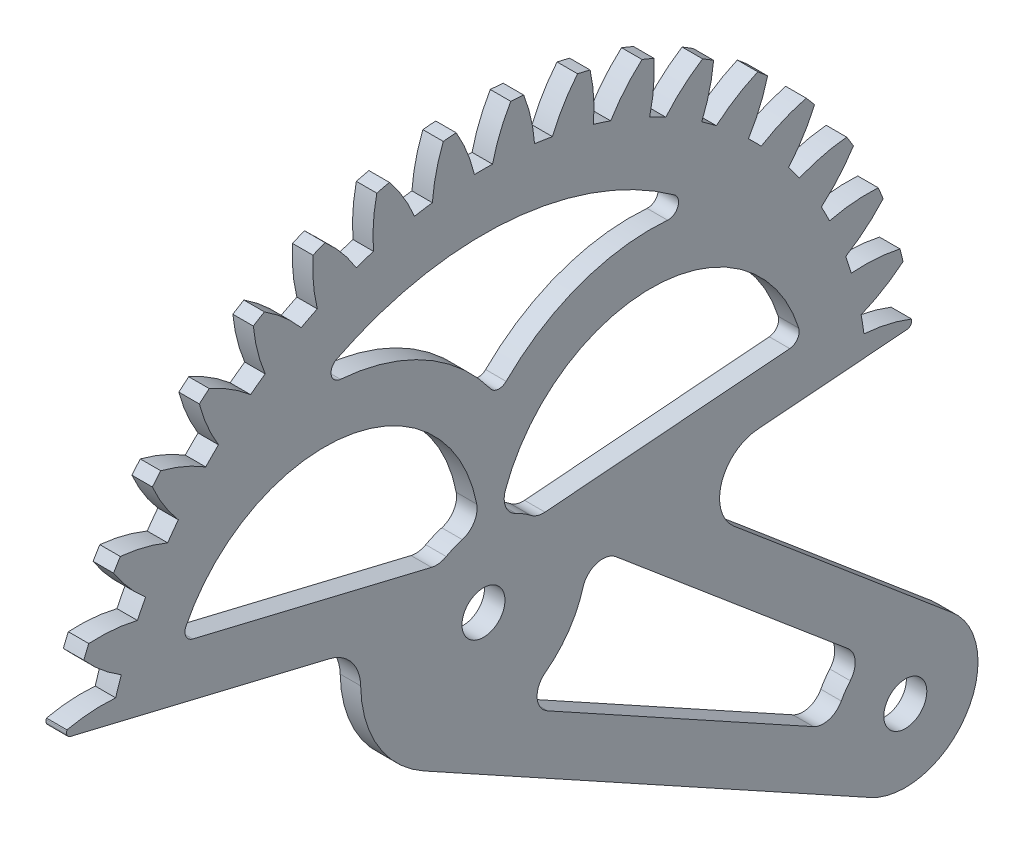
ISO-10303-21;
HEADER;
FILE_DESCRIPTION(('STEP AP214'),'2;1');
FILE_NAME('part.step','',(''),(''),'','','');
FILE_SCHEMA(('AUTOMOTIVE_DESIGN { 1 0 10303 214 1 1 1 1 }'));
ENDSEC;
DATA;
#1=APPLICATION_CONTEXT('core data for automotive mechanical design processes');
#2=APPLICATION_PROTOCOL_DEFINITION('international standard','automotive_design',2000,#1);
#3=PRODUCT_CONTEXT('',#1,'mechanical');
#4=PRODUCT('Part','Part','',(#3));
#5=PRODUCT_RELATED_PRODUCT_CATEGORY('part','',(#4));
#6=PRODUCT_DEFINITION_FORMATION('','',#4);
#7=PRODUCT_DEFINITION_CONTEXT('part definition',#1,'design');
#8=PRODUCT_DEFINITION('design','',#6,#7);
#9=PRODUCT_DEFINITION_SHAPE('','',#8);
#10=(LENGTH_UNIT() NAMED_UNIT(*) SI_UNIT(.MILLI.,.METRE.));
#11=(NAMED_UNIT(*) PLANE_ANGLE_UNIT() SI_UNIT($,.RADIAN.));
#12=(NAMED_UNIT(*) SI_UNIT($,.STERADIAN.) SOLID_ANGLE_UNIT());
#13=UNCERTAINTY_MEASURE_WITH_UNIT(LENGTH_MEASURE(1.E-05),#10,'distance_accuracy_value','');
#14=(GEOMETRIC_REPRESENTATION_CONTEXT(3) GLOBAL_UNCERTAINTY_ASSIGNED_CONTEXT((#13)) GLOBAL_UNIT_ASSIGNED_CONTEXT((#10,
#11,#12)) REPRESENTATION_CONTEXT('',''));
#15=CARTESIAN_POINT('',(0.,0.,0.));
#16=DIRECTION('',(0.,0.,1.));
#17=DIRECTION('',(1.,0.,0.));
#18=AXIS2_PLACEMENT_3D('',#15,#16,#17);
#19=CARTESIAN_POINT('',(-10.,0.,0.));
#20=DIRECTION('',(-1.,0.,0.));
#21=DIRECTION('',(0.,0.,1.));
#22=AXIS2_PLACEMENT_3D('',#19,#20,#21);
#23=CYLINDRICAL_SURFACE('',#22,42.);
#24=CARTESIAN_POINT('',(0.,0.,0.));
#25=DIRECTION('',(-1.,0.,0.));
#26=DIRECTION('',(0.,0.,1.));
#27=AXIS2_PLACEMENT_3D('',#24,#25,#26);
#28=CIRCLE('',#27,42.);
#29=CARTESIAN_POINT('',(0.,10.4190108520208,40.6871504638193));
#30=VERTEX_POINT('',#29);
#31=CARTESIAN_POINT('',(0.,10.296036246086,40.7184434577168));
#32=VERTEX_POINT('',#31);
#33=EDGE_CURVE('E1177',#30,#32,#28,.F.);
#34=ORIENTED_EDGE('',*,*,#33,.T.);
#35=DIRECTION('',(-1.,0.,0.));
#36=VECTOR('',#35,1.);
#37=CARTESIAN_POINT('',(-10.,10.296036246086,40.7184434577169));
#38=LINE('',#37,#36);
#39=CARTESIAN_POINT('',(2.,10.296036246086,40.7184434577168));
#40=VERTEX_POINT('',#39);
#41=EDGE_CURVE('E1526',#32,#40,#38,.F.);
#42=ORIENTED_EDGE('',*,*,#41,.T.);
#43=CARTESIAN_POINT('',(2.,0.,0.));
#44=DIRECTION('',(-1.,0.,0.));
#45=DIRECTION('',(0.,0.,1.));
#46=AXIS2_PLACEMENT_3D('',#43,#44,#45);
#47=CIRCLE('',#46,42.);
#48=CARTESIAN_POINT('',(2.,10.4190108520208,40.6871504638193));
#49=VERTEX_POINT('',#48);
#50=EDGE_CURVE('E953',#40,#49,#47,.T.);
#51=ORIENTED_EDGE('',*,*,#50,.T.);
#52=DIRECTION('',(-1.,0.,0.));
#53=VECTOR('',#52,1.);
#54=CARTESIAN_POINT('',(2.,10.4190108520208,40.6871504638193));
#55=LINE('',#54,#53);
#56=EDGE_CURVE('E1173',#30,#49,#55,.F.);
#57=ORIENTED_EDGE('',*,*,#56,.F.);
#58=EDGE_LOOP('',(#34,#42,#51,#57));
#59=FACE_BOUND('',#58,.T.);
#60=ADVANCED_FACE('F40',(#59),#23,.T.);
#61=CARTESIAN_POINT('',(-10.,0.,0.));
#62=DIRECTION('',(-1.,0.,0.));
#63=DIRECTION('',(0.,0.,1.));
#64=AXIS2_PLACEMENT_3D('',#61,#62,#63);
#65=CYLINDRICAL_SURFACE('',#64,42.);
#66=DIRECTION('',(-1.,0.,0.));
#67=VECTOR('',#66,1.);
#68=CARTESIAN_POINT('',(2.,16.6556081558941,38.5563317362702));
#69=LINE('',#68,#67);
#70=CARTESIAN_POINT('',(0.,16.6556081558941,38.5563317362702));
#71=VERTEX_POINT('',#70);
#72=CARTESIAN_POINT('',(2.,16.6556081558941,38.5563317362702));
#73=VERTEX_POINT('',#72);
#74=EDGE_CURVE('E1161',#71,#73,#69,.F.);
#75=ORIENTED_EDGE('',*,*,#74,.F.);
#76=CARTESIAN_POINT('',(0.,0.,0.));
#77=DIRECTION('',(-1.,0.,0.));
#78=DIRECTION('',(0.,0.,1.));
#79=AXIS2_PLACEMENT_3D('',#76,#77,#78);
#80=CIRCLE('',#79,42.);
#81=CARTESIAN_POINT('',(0.,15.4861501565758,39.0407371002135));
#82=VERTEX_POINT('',#81);
#83=EDGE_CURVE('E1418',#71,#82,#80,.F.);
#84=ORIENTED_EDGE('',*,*,#83,.T.);
#85=DIRECTION('',(-1.,0.,0.));
#86=VECTOR('',#85,1.);
#87=CARTESIAN_POINT('',(2.,15.4861501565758,39.0407371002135));
#88=LINE('',#87,#86);
#89=CARTESIAN_POINT('',(2.,15.4861501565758,39.0407371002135));
#90=VERTEX_POINT('',#89);
#91=EDGE_CURVE('E1168',#90,#82,#88,.T.);
#92=ORIENTED_EDGE('',*,*,#91,.F.);
#93=CARTESIAN_POINT('',(2.,0.,0.));
#94=DIRECTION('',(-1.,0.,0.));
#95=DIRECTION('',(0.,0.,1.));
#96=AXIS2_PLACEMENT_3D('',#93,#94,#95);
#97=CIRCLE('',#96,42.);
#98=EDGE_CURVE('E1504',#90,#73,#97,.T.);
#99=ORIENTED_EDGE('',*,*,#98,.T.);
#100=EDGE_LOOP('',(#75,#84,#92,#99));
#101=FACE_BOUND('',#100,.T.);
#102=ADVANCED_FACE('F1896',(#101),#65,.T.);
#103=CARTESIAN_POINT('',(-10.,0.,0.));
#104=DIRECTION('',(-1.,0.,0.));
#105=DIRECTION('',(0.,0.,1.));
#106=AXIS2_PLACEMENT_3D('',#103,#104,#105);
#107=CYLINDRICAL_SURFACE('',#106,42.);
#108=DIRECTION('',(-1.,0.,0.));
#109=VECTOR('',#108,1.);
#110=CARTESIAN_POINT('',(2.,21.4028067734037,36.1375132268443));
#111=LINE('',#110,#109);
#112=CARTESIAN_POINT('',(2.,21.4028067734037,36.1375132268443));
#113=VERTEX_POINT('',#112);
#114=CARTESIAN_POINT('',(0.,21.4028067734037,36.1375132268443));
#115=VERTEX_POINT('',#114);
#116=EDGE_CURVE('E1156',#113,#115,#111,.T.);
#117=ORIENTED_EDGE('',*,*,#116,.F.);
#118=CARTESIAN_POINT('',(2.,0.,0.));
#119=DIRECTION('',(-1.,0.,0.));
#120=DIRECTION('',(0.,0.,1.));
#121=AXIS2_PLACEMENT_3D('',#118,#119,#120);
#122=CIRCLE('',#121,42.);
#123=CARTESIAN_POINT('',(2.,22.482089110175,35.4761281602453));
#124=VERTEX_POINT('',#123);
#125=EDGE_CURVE('E1502',#113,#124,#122,.T.);
#126=ORIENTED_EDGE('',*,*,#125,.T.);
#127=DIRECTION('',(-1.,0.,0.));
#128=VECTOR('',#127,1.);
#129=CARTESIAN_POINT('',(2.,22.482089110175,35.4761281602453));
#130=LINE('',#129,#128);
#131=CARTESIAN_POINT('',(0.,22.482089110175,35.4761281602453));
#132=VERTEX_POINT('',#131);
#133=EDGE_CURVE('E1149',#132,#124,#130,.F.);
#134=ORIENTED_EDGE('',*,*,#133,.F.);
#135=CARTESIAN_POINT('',(0.,0.,0.));
#136=DIRECTION('',(-1.,0.,0.));
#137=DIRECTION('',(0.,0.,1.));
#138=AXIS2_PLACEMENT_3D('',#135,#136,#137);
#139=CIRCLE('',#138,42.);
#140=EDGE_CURVE('E1421',#132,#115,#139,.F.);
#141=ORIENTED_EDGE('',*,*,#140,.T.);
#142=EDGE_LOOP('',(#117,#126,#134,#141));
#143=FACE_BOUND('',#142,.T.);
#144=ADVANCED_FACE('F1892',(#143),#107,.T.);
#145=CARTESIAN_POINT('',(-10.,0.,0.));
#146=DIRECTION('',(-1.,0.,0.));
#147=DIRECTION('',(0.,0.,1.));
#148=AXIS2_PLACEMENT_3D('',#145,#146,#147);
#149=CYLINDRICAL_SURFACE('',#148,42.);
#150=DIRECTION('',(-1.,0.,0.));
#151=VECTOR('',#150,1.);
#152=CARTESIAN_POINT('',(2.,27.7549864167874,31.5223845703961));
#153=LINE('',#152,#151);
#154=CARTESIAN_POINT('',(0.,27.7549864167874,31.5223845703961));
#155=VERTEX_POINT('',#154);
#156=CARTESIAN_POINT('',(2.,27.7549864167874,31.5223845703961));
#157=VERTEX_POINT('',#156);
#158=EDGE_CURVE('E1137',#155,#157,#153,.F.);
#159=ORIENTED_EDGE('',*,*,#158,.F.);
#160=CARTESIAN_POINT('',(0.,0.,0.));
#161=DIRECTION('',(-1.,0.,0.));
#162=DIRECTION('',(0.,0.,1.));
#163=AXIS2_PLACEMENT_3D('',#160,#161,#162);
#164=CIRCLE('',#163,42.);
#165=CARTESIAN_POINT('',(0.,26.7924552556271,32.3444638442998));
#166=VERTEX_POINT('',#165);
#167=EDGE_CURVE('E1424',#155,#166,#164,.F.);
#168=ORIENTED_EDGE('',*,*,#167,.T.);
#169=DIRECTION('',(-1.,0.,0.));
#170=VECTOR('',#169,1.);
#171=CARTESIAN_POINT('',(2.,26.7924552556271,32.3444638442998));
#172=LINE('',#171,#170);
#173=CARTESIAN_POINT('',(2.,26.7924552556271,32.3444638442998));
#174=VERTEX_POINT('',#173);
#175=EDGE_CURVE('E1144',#174,#166,#172,.T.);
#176=ORIENTED_EDGE('',*,*,#175,.F.);
#177=CARTESIAN_POINT('',(2.,0.,0.));
#178=DIRECTION('',(-1.,0.,0.));
#179=DIRECTION('',(0.,0.,1.));
#180=AXIS2_PLACEMENT_3D('',#177,#178,#179);
#181=CIRCLE('',#180,42.);
#182=EDGE_CURVE('E1500',#174,#157,#181,.T.);
#183=ORIENTED_EDGE('',*,*,#182,.T.);
#184=EDGE_LOOP('',(#159,#168,#176,#183));
#185=FACE_BOUND('',#184,.T.);
#186=ADVANCED_FACE('F1888',(#185),#149,.T.);
#187=CARTESIAN_POINT('',(-10.,0.,0.));
#188=DIRECTION('',(-1.,0.,0.));
#189=DIRECTION('',(0.,0.,1.));
#190=AXIS2_PLACEMENT_3D('',#187,#188,#189);
#191=CYLINDRICAL_SURFACE('',#190,42.);
#192=DIRECTION('',(-1.,0.,0.));
#193=VECTOR('',#192,1.);
#194=CARTESIAN_POINT('',(2.,32.3444638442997,26.7924552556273));
#195=LINE('',#194,#193);
#196=CARTESIAN_POINT('',(0.,32.3444638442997,26.7924552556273));
#197=VERTEX_POINT('',#196);
#198=CARTESIAN_POINT('',(2.,32.3444638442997,26.7924552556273));
#199=VERTEX_POINT('',#198);
#200=EDGE_CURVE('E1125',#197,#199,#195,.F.);
#201=ORIENTED_EDGE('',*,*,#200,.F.);
#202=CARTESIAN_POINT('',(0.,0.,0.));
#203=DIRECTION('',(-1.,0.,0.));
#204=DIRECTION('',(0.,0.,1.));
#205=AXIS2_PLACEMENT_3D('',#202,#203,#204);
#206=CIRCLE('',#205,42.);
#207=CARTESIAN_POINT('',(0.,31.522384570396,27.7549864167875));
#208=VERTEX_POINT('',#207);
#209=EDGE_CURVE('E1427',#197,#208,#206,.F.);
#210=ORIENTED_EDGE('',*,*,#209,.T.);
#211=DIRECTION('',(-1.,0.,0.));
#212=VECTOR('',#211,1.);
#213=CARTESIAN_POINT('',(2.,31.522384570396,27.7549864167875));
#214=LINE('',#213,#212);
#215=CARTESIAN_POINT('',(2.,31.522384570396,27.7549864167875));
#216=VERTEX_POINT('',#215);
#217=EDGE_CURVE('E1132',#216,#208,#214,.T.);
#218=ORIENTED_EDGE('',*,*,#217,.F.);
#219=CARTESIAN_POINT('',(2.,0.,0.));
#220=DIRECTION('',(-1.,0.,0.));
#221=DIRECTION('',(0.,0.,1.));
#222=AXIS2_PLACEMENT_3D('',#219,#220,#221);
#223=CIRCLE('',#222,42.);
#224=EDGE_CURVE('E1498',#216,#199,#223,.T.);
#225=ORIENTED_EDGE('',*,*,#224,.T.);
#226=EDGE_LOOP('',(#201,#210,#218,#225));
#227=FACE_BOUND('',#226,.T.);
#228=ADVANCED_FACE('F1884',(#227),#191,.T.);
#229=CARTESIAN_POINT('',(-10.,0.,0.));
#230=DIRECTION('',(-1.,0.,0.));
#231=DIRECTION('',(0.,0.,1.));
#232=AXIS2_PLACEMENT_3D('',#229,#230,#231);
#233=CYLINDRICAL_SURFACE('',#232,42.);
#234=DIRECTION('',(-1.,0.,0.));
#235=VECTOR('',#234,1.);
#236=CARTESIAN_POINT('',(2.,35.4761281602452,22.4820891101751));
#237=LINE('',#236,#235);
#238=CARTESIAN_POINT('',(2.,35.4761281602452,22.4820891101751));
#239=VERTEX_POINT('',#238);
#240=CARTESIAN_POINT('',(0.,35.4761281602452,22.4820891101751));
#241=VERTEX_POINT('',#240);
#242=EDGE_CURVE('E1120',#239,#241,#237,.T.);
#243=ORIENTED_EDGE('',*,*,#242,.F.);
#244=CARTESIAN_POINT('',(2.,0.,0.));
#245=DIRECTION('',(-1.,0.,0.));
#246=DIRECTION('',(0.,0.,1.));
#247=AXIS2_PLACEMENT_3D('',#244,#245,#246);
#248=CIRCLE('',#247,42.);
#249=CARTESIAN_POINT('',(2.,36.1375132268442,21.4028067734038));
#250=VERTEX_POINT('',#249);
#251=EDGE_CURVE('E1182',#239,#250,#248,.T.);
#252=ORIENTED_EDGE('',*,*,#251,.T.);
#253=DIRECTION('',(-1.,0.,0.));
#254=VECTOR('',#253,1.);
#255=CARTESIAN_POINT('',(2.,36.1375132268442,21.4028067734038));
#256=LINE('',#255,#254);
#257=CARTESIAN_POINT('',(0.,36.1375132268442,21.4028067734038));
#258=VERTEX_POINT('',#257);
#259=EDGE_CURVE('E1113',#258,#250,#256,.F.);
#260=ORIENTED_EDGE('',*,*,#259,.F.);
#261=CARTESIAN_POINT('',(0.,0.,0.));
#262=DIRECTION('',(-1.,0.,0.));
#263=DIRECTION('',(0.,0.,1.));
#264=AXIS2_PLACEMENT_3D('',#261,#262,#263);
#265=CIRCLE('',#264,42.);
#266=EDGE_CURVE('E1430',#258,#241,#265,.F.);
#267=ORIENTED_EDGE('',*,*,#266,.T.);
#268=EDGE_LOOP('',(#243,#252,#260,#267));
#269=FACE_BOUND('',#268,.T.);
#270=ADVANCED_FACE('F1880',(#269),#233,.T.);
#271=CARTESIAN_POINT('',(-10.,0.,0.));
#272=DIRECTION('',(-1.,0.,0.));
#273=DIRECTION('',(0.,0.,1.));
#274=AXIS2_PLACEMENT_3D('',#271,#272,#273);
#275=CYLINDRICAL_SURFACE('',#274,42.);
#276=DIRECTION('',(-1.,0.,0.));
#277=VECTOR('',#276,1.);
#278=CARTESIAN_POINT('',(-10.,38.5563317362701,16.6556081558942));
#279=LINE('',#278,#277);
#280=CARTESIAN_POINT('',(0.,38.5563317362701,16.6556081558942));
#281=VERTEX_POINT('',#280);
#282=CARTESIAN_POINT('',(2.,38.5563317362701,16.6556081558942));
#283=VERTEX_POINT('',#282);
#284=EDGE_CURVE('E1178',#281,#283,#279,.F.);
#285=ORIENTED_EDGE('',*,*,#284,.T.);
#286=CARTESIAN_POINT('',(2.,0.,0.));
#287=DIRECTION('',(-1.,0.,0.));
#288=DIRECTION('',(0.,0.,1.));
#289=AXIS2_PLACEMENT_3D('',#286,#287,#288);
#290=CIRCLE('',#289,42.);
#291=CARTESIAN_POINT('',(2.,39.0407371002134,15.486150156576));
#292=VERTEX_POINT('',#291);
#293=EDGE_CURVE('E1181',#283,#292,#290,.T.);
#294=ORIENTED_EDGE('',*,*,#293,.T.);
#295=DIRECTION('',(-1.,0.,0.));
#296=VECTOR('',#295,1.);
#297=CARTESIAN_POINT('',(2.,39.0407371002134,15.486150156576));
#298=LINE('',#297,#296);
#299=CARTESIAN_POINT('',(0.,39.0407371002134,15.486150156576));
#300=VERTEX_POINT('',#299);
#301=EDGE_CURVE('E1103',#300,#292,#298,.F.);
#302=ORIENTED_EDGE('',*,*,#301,.F.);
#303=CARTESIAN_POINT('',(0.,0.,0.));
#304=DIRECTION('',(-1.,0.,0.));
#305=DIRECTION('',(0.,0.,1.));
#306=AXIS2_PLACEMENT_3D('',#303,#304,#305);
#307=CIRCLE('',#306,42.);
#308=EDGE_CURVE('E1433',#300,#281,#307,.F.);
#309=ORIENTED_EDGE('',*,*,#308,.T.);
#310=EDGE_LOOP('',(#285,#294,#302,#309));
#311=FACE_BOUND('',#310,.T.);
#312=ADVANCED_FACE('F1876',(#311),#275,.T.);
#313=CARTESIAN_POINT('',(-10.,0.,0.));
#314=DIRECTION('',(-1.,0.,0.));
#315=DIRECTION('',(0.,0.,1.));
#316=AXIS2_PLACEMENT_3D('',#313,#314,#315);
#317=CYLINDRICAL_SURFACE('',#316,42.);
#318=DIRECTION('',(-1.,0.,0.));
#319=VECTOR('',#318,1.);
#320=CARTESIAN_POINT('',(2.,40.9826484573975,9.18817312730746));
#321=LINE('',#320,#319);
#322=CARTESIAN_POINT('',(0.,40.9826484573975,9.18817312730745));
#323=VERTEX_POINT('',#322);
#324=CARTESIAN_POINT('',(2.,40.9826484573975,9.18817312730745));
#325=VERTEX_POINT('',#324);
#326=EDGE_CURVE('E1090',#323,#325,#321,.F.);
#327=ORIENTED_EDGE('',*,*,#326,.F.);
#328=CARTESIAN_POINT('',(0.,0.,0.));
#329=DIRECTION('',(-1.,0.,0.));
#330=DIRECTION('',(0.,0.,1.));
#331=AXIS2_PLACEMENT_3D('',#328,#329,#330);
#332=CIRCLE('',#331,42.);
#333=CARTESIAN_POINT('',(0.,40.6871504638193,10.4190108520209));
#334=VERTEX_POINT('',#333);
#335=EDGE_CURVE('E1436',#323,#334,#332,.F.);
#336=ORIENTED_EDGE('',*,*,#335,.T.);
#337=DIRECTION('',(-1.,0.,0.));
#338=VECTOR('',#337,1.);
#339=CARTESIAN_POINT('',(2.,40.6871504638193,10.4190108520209));
#340=LINE('',#339,#338);
#341=CARTESIAN_POINT('',(2.,40.6871504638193,10.4190108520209));
#342=VERTEX_POINT('',#341);
#343=EDGE_CURVE('E1095',#342,#334,#340,.T.);
#344=ORIENTED_EDGE('',*,*,#343,.F.);
#345=CARTESIAN_POINT('',(2.,0.,0.));
#346=DIRECTION('',(-1.,0.,0.));
#347=DIRECTION('',(0.,0.,1.));
#348=AXIS2_PLACEMENT_3D('',#345,#346,#347);
#349=CIRCLE('',#348,42.);
#350=EDGE_CURVE('E1494',#342,#325,#349,.T.);
#351=ORIENTED_EDGE('',*,*,#350,.T.);
#352=EDGE_LOOP('',(#327,#336,#344,#351));
#353=FACE_BOUND('',#352,.T.);
#354=ADVANCED_FACE('F1872',(#353),#317,.T.);
#355=CARTESIAN_POINT('',(-10.,0.,0.));
#356=DIRECTION('',(-1.,0.,0.));
#357=DIRECTION('',(0.,0.,1.));
#358=AXIS2_PLACEMENT_3D('',#355,#356,#357);
#359=CYLINDRICAL_SURFACE('',#358,42.);
#360=DIRECTION('',(-1.,0.,0.));
#361=VECTOR('',#360,1.);
#362=CARTESIAN_POINT('',(2.,41.9154309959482,2.66395278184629));
#363=LINE('',#362,#361);
#364=CARTESIAN_POINT('',(0.,41.9154309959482,2.6639527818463));
#365=VERTEX_POINT('',#364);
#366=CARTESIAN_POINT('',(2.,41.9154309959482,2.6639527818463));
#367=VERTEX_POINT('',#366);
#368=EDGE_CURVE('E1078',#365,#367,#363,.F.);
#369=ORIENTED_EDGE('',*,*,#368,.F.);
#370=CARTESIAN_POINT('',(0.,0.,0.));
#371=DIRECTION('',(-1.,0.,0.));
#372=DIRECTION('',(0.,0.,1.));
#373=AXIS2_PLACEMENT_3D('',#370,#371,#372);
#374=CIRCLE('',#373,42.);
#375=CARTESIAN_POINT('',(0.,41.8161165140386,3.92586292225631));
#376=VERTEX_POINT('',#375);
#377=EDGE_CURVE('E1439',#365,#376,#374,.F.);
#378=ORIENTED_EDGE('',*,*,#377,.T.);
#379=DIRECTION('',(-1.,0.,0.));
#380=VECTOR('',#379,1.);
#381=CARTESIAN_POINT('',(2.,41.8161165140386,3.92586292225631));
#382=LINE('',#381,#380);
#383=CARTESIAN_POINT('',(2.,41.8161165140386,3.92586292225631));
#384=VERTEX_POINT('',#383);
#385=EDGE_CURVE('E1085',#384,#376,#382,.T.);
#386=ORIENTED_EDGE('',*,*,#385,.F.);
#387=CARTESIAN_POINT('',(2.,0.,0.));
#388=DIRECTION('',(-1.,0.,0.));
#389=DIRECTION('',(0.,0.,1.));
#390=AXIS2_PLACEMENT_3D('',#387,#388,#389);
#391=CIRCLE('',#390,42.);
#392=EDGE_CURVE('E1492',#384,#367,#391,.T.);
#393=ORIENTED_EDGE('',*,*,#392,.T.);
#394=EDGE_LOOP('',(#369,#378,#386,#393));
#395=FACE_BOUND('',#394,.T.);
#396=ADVANCED_FACE('F1868',(#395),#359,.T.);
#397=CARTESIAN_POINT('',(-10.,0.,0.));
#398=DIRECTION('',(-1.,0.,0.));
#399=DIRECTION('',(0.,0.,1.));
#400=AXIS2_PLACEMENT_3D('',#397,#398,#399);
#401=CYLINDRICAL_SURFACE('',#400,42.);
#402=DIRECTION('',(-1.,0.,0.));
#403=VECTOR('',#402,1.);
#404=CARTESIAN_POINT('',(2.,41.9154309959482,-2.6639527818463));
#405=LINE('',#404,#403);
#406=CARTESIAN_POINT('',(2.,41.9154309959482,-2.6639527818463));
#407=VERTEX_POINT('',#406);
#408=CARTESIAN_POINT('',(0.,41.9154309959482,-2.6639527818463));
#409=VERTEX_POINT('',#408);
#410=EDGE_CURVE('E1073',#407,#409,#405,.T.);
#411=ORIENTED_EDGE('',*,*,#410,.F.);
#412=CARTESIAN_POINT('',(2.,0.,0.));
#413=DIRECTION('',(-1.,0.,0.));
#414=DIRECTION('',(0.,0.,1.));
#415=AXIS2_PLACEMENT_3D('',#412,#413,#414);
#416=CIRCLE('',#415,42.);
#417=CARTESIAN_POINT('',(2.,41.8161165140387,-3.92586292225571));
#418=VERTEX_POINT('',#417);
#419=EDGE_CURVE('E1490',#407,#418,#416,.T.);
#420=ORIENTED_EDGE('',*,*,#419,.T.);
#421=DIRECTION('',(-1.,0.,0.));
#422=VECTOR('',#421,1.);
#423=CARTESIAN_POINT('',(2.,41.8161165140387,-3.92586292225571));
#424=LINE('',#423,#422);
#425=CARTESIAN_POINT('',(0.,41.8161165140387,-3.92586292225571));
#426=VERTEX_POINT('',#425);
#427=EDGE_CURVE('E1066',#426,#418,#424,.F.);
#428=ORIENTED_EDGE('',*,*,#427,.F.);
#429=CARTESIAN_POINT('',(0.,0.,0.));
#430=DIRECTION('',(-1.,0.,0.));
#431=DIRECTION('',(0.,0.,1.));
#432=AXIS2_PLACEMENT_3D('',#429,#430,#431);
#433=CIRCLE('',#432,42.);
#434=EDGE_CURVE('E1442',#426,#409,#433,.F.);
#435=ORIENTED_EDGE('',*,*,#434,.T.);
#436=EDGE_LOOP('',(#411,#420,#428,#435));
#437=FACE_BOUND('',#436,.T.);
#438=ADVANCED_FACE('F1864',(#437),#401,.T.);
#439=CARTESIAN_POINT('',(-10.,0.,0.));
#440=DIRECTION('',(-1.,0.,0.));
#441=DIRECTION('',(0.,0.,1.));
#442=AXIS2_PLACEMENT_3D('',#439,#440,#441);
#443=CYLINDRICAL_SURFACE('',#442,42.);
#444=DIRECTION('',(-1.,0.,0.));
#445=VECTOR('',#444,1.);
#446=CARTESIAN_POINT('',(2.,40.9826484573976,-9.18817312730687));
#447=LINE('',#446,#445);
#448=CARTESIAN_POINT('',(2.,40.9826484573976,-9.18817312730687));
#449=VERTEX_POINT('',#448);
#450=CARTESIAN_POINT('',(0.,40.9826484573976,-9.18817312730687));
#451=VERTEX_POINT('',#450);
#452=EDGE_CURVE('E1061',#449,#451,#447,.T.);
#453=ORIENTED_EDGE('',*,*,#452,.F.);
#454=CARTESIAN_POINT('',(2.,0.,0.));
#455=DIRECTION('',(-1.,0.,0.));
#456=DIRECTION('',(0.,0.,1.));
#457=AXIS2_PLACEMENT_3D('',#454,#455,#456);
#458=CIRCLE('',#457,42.);
#459=CARTESIAN_POINT('',(2.,40.6871504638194,-10.4190108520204));
#460=VERTEX_POINT('',#459);
#461=EDGE_CURVE('E1488',#449,#460,#458,.T.);
#462=ORIENTED_EDGE('',*,*,#461,.T.);
#463=DIRECTION('',(-1.,0.,0.));
#464=VECTOR('',#463,1.);
#465=CARTESIAN_POINT('',(2.,40.6871504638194,-10.4190108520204));
#466=LINE('',#465,#464);
#467=CARTESIAN_POINT('',(0.,40.6871504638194,-10.4190108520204));
#468=VERTEX_POINT('',#467);
#469=EDGE_CURVE('E1054',#468,#460,#466,.F.);
#470=ORIENTED_EDGE('',*,*,#469,.F.);
#471=CARTESIAN_POINT('',(0.,0.,0.));
#472=DIRECTION('',(-1.,0.,0.));
#473=DIRECTION('',(0.,0.,1.));
#474=AXIS2_PLACEMENT_3D('',#471,#472,#473);
#475=CIRCLE('',#474,42.);
#476=EDGE_CURVE('E1445',#468,#451,#475,.F.);
#477=ORIENTED_EDGE('',*,*,#476,.T.);
#478=EDGE_LOOP('',(#453,#462,#470,#477));
#479=FACE_BOUND('',#478,.T.);
#480=ADVANCED_FACE('F1860',(#479),#443,.T.);
#481=CARTESIAN_POINT('',(-10.,0.,0.));
#482=DIRECTION('',(-1.,0.,0.));
#483=DIRECTION('',(0.,0.,1.));
#484=AXIS2_PLACEMENT_3D('',#481,#482,#483);
#485=CYLINDRICAL_SURFACE('',#484,42.);
#486=DIRECTION('',(-1.,0.,0.));
#487=VECTOR('',#486,1.);
#488=CARTESIAN_POINT('',(2.,39.0407371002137,-15.4861501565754));
#489=LINE('',#488,#487);
#490=CARTESIAN_POINT('',(2.,39.0407371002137,-15.4861501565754));
#491=VERTEX_POINT('',#490);
#492=CARTESIAN_POINT('',(0.,39.0407371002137,-15.4861501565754));
#493=VERTEX_POINT('',#492);
#494=EDGE_CURVE('E1049',#491,#493,#489,.T.);
#495=ORIENTED_EDGE('',*,*,#494,.F.);
#496=CARTESIAN_POINT('',(2.,0.,0.));
#497=DIRECTION('',(-1.,0.,0.));
#498=DIRECTION('',(0.,0.,1.));
#499=AXIS2_PLACEMENT_3D('',#496,#497,#498);
#500=CIRCLE('',#499,42.);
#501=CARTESIAN_POINT('',(2.,38.5563317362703,-16.6556081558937));
#502=VERTEX_POINT('',#501);
#503=EDGE_CURVE('E1486',#491,#502,#500,.T.);
#504=ORIENTED_EDGE('',*,*,#503,.T.);
#505=DIRECTION('',(-1.,0.,0.));
#506=VECTOR('',#505,1.);
#507=CARTESIAN_POINT('',(2.,38.5563317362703,-16.6556081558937));
#508=LINE('',#507,#506);
#509=CARTESIAN_POINT('',(0.,38.5563317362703,-16.6556081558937));
#510=VERTEX_POINT('',#509);
#511=EDGE_CURVE('E1042',#510,#502,#508,.F.);
#512=ORIENTED_EDGE('',*,*,#511,.F.);
#513=CARTESIAN_POINT('',(0.,0.,0.));
#514=DIRECTION('',(-1.,0.,0.));
#515=DIRECTION('',(0.,0.,1.));
#516=AXIS2_PLACEMENT_3D('',#513,#514,#515);
#517=CIRCLE('',#516,42.);
#518=EDGE_CURVE('E1448',#510,#493,#517,.F.);
#519=ORIENTED_EDGE('',*,*,#518,.T.);
#520=EDGE_LOOP('',(#495,#504,#512,#519));
#521=FACE_BOUND('',#520,.T.);
#522=ADVANCED_FACE('F1856',(#521),#485,.T.);
#523=CARTESIAN_POINT('',(-10.,0.,0.));
#524=DIRECTION('',(-1.,0.,0.));
#525=DIRECTION('',(0.,0.,1.));
#526=AXIS2_PLACEMENT_3D('',#523,#524,#525);
#527=CYLINDRICAL_SURFACE('',#526,42.);
#528=DIRECTION('',(-1.,0.,0.));
#529=VECTOR('',#528,1.);
#530=CARTESIAN_POINT('',(2.,36.1375132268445,-21.4028067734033));
#531=LINE('',#530,#529);
#532=CARTESIAN_POINT('',(2.,36.1375132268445,-21.4028067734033));
#533=VERTEX_POINT('',#532);
#534=CARTESIAN_POINT('',(0.,36.1375132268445,-21.4028067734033));
#535=VERTEX_POINT('',#534);
#536=EDGE_CURVE('E1037',#533,#535,#531,.T.);
#537=ORIENTED_EDGE('',*,*,#536,.F.);
#538=CARTESIAN_POINT('',(2.,0.,0.));
#539=DIRECTION('',(-1.,0.,0.));
#540=DIRECTION('',(0.,0.,1.));
#541=AXIS2_PLACEMENT_3D('',#538,#539,#540);
#542=CIRCLE('',#541,42.);
#543=CARTESIAN_POINT('',(2.,35.4761281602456,-22.4820891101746));
#544=VERTEX_POINT('',#543);
#545=EDGE_CURVE('E1484',#533,#544,#542,.T.);
#546=ORIENTED_EDGE('',*,*,#545,.T.);
#547=DIRECTION('',(-1.,0.,0.));
#548=VECTOR('',#547,1.);
#549=CARTESIAN_POINT('',(2.,35.4761281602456,-22.4820891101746));
#550=LINE('',#549,#548);
#551=CARTESIAN_POINT('',(0.,35.4761281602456,-22.4820891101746));
#552=VERTEX_POINT('',#551);
#553=EDGE_CURVE('E1030',#552,#544,#550,.F.);
#554=ORIENTED_EDGE('',*,*,#553,.F.);
#555=CARTESIAN_POINT('',(0.,0.,0.));
#556=DIRECTION('',(-1.,0.,0.));
#557=DIRECTION('',(0.,0.,1.));
#558=AXIS2_PLACEMENT_3D('',#555,#556,#557);
#559=CIRCLE('',#558,42.);
#560=EDGE_CURVE('E1451',#552,#535,#559,.F.);
#561=ORIENTED_EDGE('',*,*,#560,.T.);
#562=EDGE_LOOP('',(#537,#546,#554,#561));
#563=FACE_BOUND('',#562,.T.);
#564=ADVANCED_FACE('F1852',(#563),#527,.T.);
#565=CARTESIAN_POINT('',(-10.,0.,0.));
#566=DIRECTION('',(-1.,0.,0.));
#567=DIRECTION('',(0.,0.,1.));
#568=AXIS2_PLACEMENT_3D('',#565,#566,#567);
#569=CYLINDRICAL_SURFACE('',#568,42.);
#570=DIRECTION('',(-1.,0.,0.));
#571=VECTOR('',#570,1.);
#572=CARTESIAN_POINT('',(2.,31.5223845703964,-27.7549864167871));
#573=LINE('',#572,#571);
#574=CARTESIAN_POINT('',(0.,31.5223845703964,-27.7549864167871));
#575=VERTEX_POINT('',#574);
#576=CARTESIAN_POINT('',(2.,31.5223845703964,-27.7549864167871));
#577=VERTEX_POINT('',#576);
#578=EDGE_CURVE('E1018',#575,#577,#573,.F.);
#579=ORIENTED_EDGE('',*,*,#578,.F.);
#580=CARTESIAN_POINT('',(0.,0.,0.));
#581=DIRECTION('',(-1.,0.,0.));
#582=DIRECTION('',(0.,0.,1.));
#583=AXIS2_PLACEMENT_3D('',#580,#581,#582);
#584=CIRCLE('',#583,42.);
#585=CARTESIAN_POINT('',(0.,32.3444638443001,-26.7924552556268));
#586=VERTEX_POINT('',#585);
#587=EDGE_CURVE('E1454',#575,#586,#584,.F.);
#588=ORIENTED_EDGE('',*,*,#587,.T.);
#589=DIRECTION('',(-1.,0.,0.));
#590=VECTOR('',#589,1.);
#591=CARTESIAN_POINT('',(2.,32.3444638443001,-26.7924552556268));
#592=LINE('',#591,#590);
#593=CARTESIAN_POINT('',(2.,32.3444638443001,-26.7924552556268));
#594=VERTEX_POINT('',#593);
#595=EDGE_CURVE('E1025',#594,#586,#592,.T.);
#596=ORIENTED_EDGE('',*,*,#595,.F.);
#597=CARTESIAN_POINT('',(2.,0.,0.));
#598=DIRECTION('',(-1.,0.,0.));
#599=DIRECTION('',(0.,0.,1.));
#600=AXIS2_PLACEMENT_3D('',#597,#598,#599);
#601=CIRCLE('',#600,42.);
#602=EDGE_CURVE('E1482',#594,#577,#601,.T.);
#603=ORIENTED_EDGE('',*,*,#602,.T.);
#604=EDGE_LOOP('',(#579,#588,#596,#603));
#605=FACE_BOUND('',#604,.T.);
#606=ADVANCED_FACE('F1848',(#605),#569,.T.);
#607=CARTESIAN_POINT('',(-10.,0.,0.));
#608=DIRECTION('',(-1.,0.,0.));
#609=DIRECTION('',(0.,0.,1.));
#610=AXIS2_PLACEMENT_3D('',#607,#608,#609);
#611=CYLINDRICAL_SURFACE('',#610,42.);
#612=DIRECTION('',(-1.,0.,0.));
#613=VECTOR('',#612,1.);
#614=CARTESIAN_POINT('',(2.,26.7924552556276,-32.3444638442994));
#615=LINE('',#614,#613);
#616=CARTESIAN_POINT('',(0.,26.7924552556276,-32.3444638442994));
#617=VERTEX_POINT('',#616);
#618=CARTESIAN_POINT('',(2.,26.7924552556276,-32.3444638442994));
#619=VERTEX_POINT('',#618);
#620=EDGE_CURVE('E1006',#617,#619,#615,.F.);
#621=ORIENTED_EDGE('',*,*,#620,.F.);
#622=CARTESIAN_POINT('',(0.,0.,0.));
#623=DIRECTION('',(-1.,0.,0.));
#624=DIRECTION('',(0.,0.,1.));
#625=AXIS2_PLACEMENT_3D('',#622,#623,#624);
#626=CIRCLE('',#625,42.);
#627=CARTESIAN_POINT('',(0.,27.7549864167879,-31.5223845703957));
#628=VERTEX_POINT('',#627);
#629=EDGE_CURVE('E1457',#617,#628,#626,.F.);
#630=ORIENTED_EDGE('',*,*,#629,.T.);
#631=DIRECTION('',(-1.,0.,0.));
#632=VECTOR('',#631,1.);
#633=CARTESIAN_POINT('',(2.,27.7549864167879,-31.5223845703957));
#634=LINE('',#633,#632);
#635=CARTESIAN_POINT('',(2.,27.7549864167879,-31.5223845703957));
#636=VERTEX_POINT('',#635);
#637=EDGE_CURVE('E1013',#636,#628,#634,.T.);
#638=ORIENTED_EDGE('',*,*,#637,.F.);
#639=CARTESIAN_POINT('',(2.,0.,0.));
#640=DIRECTION('',(-1.,0.,0.));
#641=DIRECTION('',(0.,0.,1.));
#642=AXIS2_PLACEMENT_3D('',#639,#640,#641);
#643=CIRCLE('',#642,42.);
#644=EDGE_CURVE('E1480',#636,#619,#643,.T.);
#645=ORIENTED_EDGE('',*,*,#644,.T.);
#646=EDGE_LOOP('',(#621,#630,#638,#645));
#647=FACE_BOUND('',#646,.T.);
#648=ADVANCED_FACE('F1844',(#647),#611,.T.);
#649=CARTESIAN_POINT('',(-10.,0.,0.));
#650=DIRECTION('',(-1.,0.,0.));
#651=DIRECTION('',(0.,0.,1.));
#652=AXIS2_PLACEMENT_3D('',#649,#650,#651);
#653=CYLINDRICAL_SURFACE('',#652,42.);
#654=DIRECTION('',(-1.,0.,0.));
#655=VECTOR('',#654,1.);
#656=CARTESIAN_POINT('',(2.,22.4820891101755,-35.476128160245));
#657=LINE('',#656,#655);
#658=CARTESIAN_POINT('',(2.,22.4820891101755,-35.476128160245));
#659=VERTEX_POINT('',#658);
#660=CARTESIAN_POINT('',(0.,22.4820891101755,-35.476128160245));
#661=VERTEX_POINT('',#660);
#662=EDGE_CURVE('E1001',#659,#661,#657,.T.);
#663=ORIENTED_EDGE('',*,*,#662,.F.);
#664=CARTESIAN_POINT('',(2.,0.,0.));
#665=DIRECTION('',(-1.,0.,0.));
#666=DIRECTION('',(0.,0.,1.));
#667=AXIS2_PLACEMENT_3D('',#664,#665,#666);
#668=CIRCLE('',#667,42.);
#669=CARTESIAN_POINT('',(2.,21.4028067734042,-36.137513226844));
#670=VERTEX_POINT('',#669);
#671=EDGE_CURVE('E1478',#659,#670,#668,.T.);
#672=ORIENTED_EDGE('',*,*,#671,.T.);
#673=DIRECTION('',(-1.,0.,0.));
#674=VECTOR('',#673,1.);
#675=CARTESIAN_POINT('',(2.,21.4028067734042,-36.137513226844));
#676=LINE('',#675,#674);
#677=CARTESIAN_POINT('',(0.,21.4028067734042,-36.137513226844));
#678=VERTEX_POINT('',#677);
#679=EDGE_CURVE('E994',#678,#670,#676,.F.);
#680=ORIENTED_EDGE('',*,*,#679,.F.);
#681=CARTESIAN_POINT('',(0.,0.,0.));
#682=DIRECTION('',(-1.,0.,0.));
#683=DIRECTION('',(0.,0.,1.));
#684=AXIS2_PLACEMENT_3D('',#681,#682,#683);
#685=CIRCLE('',#684,42.);
#686=EDGE_CURVE('E1460',#678,#661,#685,.F.);
#687=ORIENTED_EDGE('',*,*,#686,.T.);
#688=EDGE_LOOP('',(#663,#672,#680,#687));
#689=FACE_BOUND('',#688,.T.);
#690=ADVANCED_FACE('F1840',(#689),#653,.T.);
#691=CARTESIAN_POINT('',(-10.,0.,0.));
#692=DIRECTION('',(-1.,0.,0.));
#693=DIRECTION('',(0.,0.,1.));
#694=AXIS2_PLACEMENT_3D('',#691,#692,#693);
#695=CYLINDRICAL_SURFACE('',#694,42.);
#696=DIRECTION('',(-1.,0.,0.));
#697=VECTOR('',#696,1.);
#698=CARTESIAN_POINT('',(2.,15.4861501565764,-39.0407371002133));
#699=LINE('',#698,#697);
#700=CARTESIAN_POINT('',(0.,15.4861501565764,-39.0407371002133));
#701=VERTEX_POINT('',#700);
#702=CARTESIAN_POINT('',(2.,15.4861501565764,-39.0407371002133));
#703=VERTEX_POINT('',#702);
#704=EDGE_CURVE('E982',#701,#703,#699,.F.);
#705=ORIENTED_EDGE('',*,*,#704,.F.);
#706=CARTESIAN_POINT('',(0.,0.,0.));
#707=DIRECTION('',(-1.,0.,0.));
#708=DIRECTION('',(0.,0.,1.));
#709=AXIS2_PLACEMENT_3D('',#706,#707,#708);
#710=CIRCLE('',#709,42.);
#711=CARTESIAN_POINT('',(0.,16.6556081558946,-38.5563317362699));
#712=VERTEX_POINT('',#711);
#713=EDGE_CURVE('E1463',#701,#712,#710,.F.);
#714=ORIENTED_EDGE('',*,*,#713,.T.);
#715=DIRECTION('',(-1.,0.,0.));
#716=VECTOR('',#715,1.);
#717=CARTESIAN_POINT('',(2.,16.6556081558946,-38.5563317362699));
#718=LINE('',#717,#716);
#719=CARTESIAN_POINT('',(2.,16.6556081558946,-38.5563317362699));
#720=VERTEX_POINT('',#719);
#721=EDGE_CURVE('E989',#720,#712,#718,.T.);
#722=ORIENTED_EDGE('',*,*,#721,.F.);
#723=CARTESIAN_POINT('',(2.,0.,0.));
#724=DIRECTION('',(-1.,0.,0.));
#725=DIRECTION('',(0.,0.,1.));
#726=AXIS2_PLACEMENT_3D('',#723,#724,#725);
#727=CIRCLE('',#726,42.);
#728=EDGE_CURVE('E1476',#720,#703,#727,.T.);
#729=ORIENTED_EDGE('',*,*,#728,.T.);
#730=EDGE_LOOP('',(#705,#714,#722,#729));
#731=FACE_BOUND('',#730,.T.);
#732=ADVANCED_FACE('F1836',(#731),#695,.T.);
#733=CARTESIAN_POINT('',(-10.,0.,0.));
#734=DIRECTION('',(-1.,0.,0.));
#735=DIRECTION('',(0.,0.,1.));
#736=AXIS2_PLACEMENT_3D('',#733,#734,#735);
#737=CYLINDRICAL_SURFACE('',#736,42.);
#738=DIRECTION('',(-1.,0.,0.));
#739=VECTOR('',#738,1.);
#740=CARTESIAN_POINT('',(2.,9.1881731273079,-40.9826484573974));
#741=LINE('',#740,#739);
#742=CARTESIAN_POINT('',(0.,9.18817312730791,-40.9826484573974));
#743=VERTEX_POINT('',#742);
#744=CARTESIAN_POINT('',(2.,9.18817312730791,-40.9826484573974));
#745=VERTEX_POINT('',#744);
#746=EDGE_CURVE('E970',#743,#745,#741,.F.);
#747=ORIENTED_EDGE('',*,*,#746,.F.);
#748=CARTESIAN_POINT('',(0.,0.,0.));
#749=DIRECTION('',(-1.,0.,0.));
#750=DIRECTION('',(0.,0.,1.));
#751=AXIS2_PLACEMENT_3D('',#748,#749,#750);
#752=CIRCLE('',#751,42.);
#753=CARTESIAN_POINT('',(0.,10.4190108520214,-40.6871504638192));
#754=VERTEX_POINT('',#753);
#755=EDGE_CURVE('E1466',#743,#754,#752,.F.);
#756=ORIENTED_EDGE('',*,*,#755,.T.);
#757=DIRECTION('',(-1.,0.,0.));
#758=VECTOR('',#757,1.);
#759=CARTESIAN_POINT('',(2.,10.4190108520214,-40.6871504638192));
#760=LINE('',#759,#758);
#761=CARTESIAN_POINT('',(2.,10.4190108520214,-40.6871504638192));
#762=VERTEX_POINT('',#761);
#763=EDGE_CURVE('E977',#762,#754,#760,.T.);
#764=ORIENTED_EDGE('',*,*,#763,.F.);
#765=CARTESIAN_POINT('',(2.,0.,0.));
#766=DIRECTION('',(-1.,0.,0.));
#767=DIRECTION('',(0.,0.,1.));
#768=AXIS2_PLACEMENT_3D('',#765,#766,#767);
#769=CIRCLE('',#768,42.);
#770=EDGE_CURVE('E1474',#762,#745,#769,.T.);
#771=ORIENTED_EDGE('',*,*,#770,.T.);
#772=EDGE_LOOP('',(#747,#756,#764,#771));
#773=FACE_BOUND('',#772,.T.);
#774=ADVANCED_FACE('F1832',(#773),#737,.T.);
#775=CARTESIAN_POINT('',(-10.,0.,0.));
#776=DIRECTION('',(-1.,0.,0.));
#777=DIRECTION('',(0.,0.,1.));
#778=AXIS2_PLACEMENT_3D('',#775,#776,#777);
#779=CYLINDRICAL_SURFACE('',#778,42.);
#780=CARTESIAN_POINT('',(2.,0.,0.));
#781=DIRECTION('',(-1.,0.,0.));
#782=DIRECTION('',(0.,0.,1.));
#783=AXIS2_PLACEMENT_3D('',#780,#781,#782);
#784=CIRCLE('',#783,42.);
#785=CARTESIAN_POINT('',(2.,3.92586292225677,-41.8161165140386));
#786=VERTEX_POINT('',#785);
#787=CARTESIAN_POINT('',(2.,3.79950703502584,-41.8277867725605));
#788=VERTEX_POINT('',#787);
#789=EDGE_CURVE('E1471',#786,#788,#784,.T.);
#790=ORIENTED_EDGE('',*,*,#789,.T.);
#791=DIRECTION('',(-1.,0.,0.));
#792=VECTOR('',#791,1.);
#793=CARTESIAN_POINT('',(-10.,3.79950703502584,-41.8277867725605));
#794=LINE('',#793,#792);
#795=CARTESIAN_POINT('',(0.,3.79950703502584,-41.8277867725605));
#796=VERTEX_POINT('',#795);
#797=EDGE_CURVE('E1542',#788,#796,#794,.T.);
#798=ORIENTED_EDGE('',*,*,#797,.T.);
#799=CARTESIAN_POINT('',(0.,0.,0.));
#800=DIRECTION('',(-1.,0.,0.));
#801=DIRECTION('',(0.,0.,1.));
#802=AXIS2_PLACEMENT_3D('',#799,#800,#801);
#803=CIRCLE('',#802,42.);
#804=CARTESIAN_POINT('',(0.,3.92586292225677,-41.8161165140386));
#805=VERTEX_POINT('',#804);
#806=EDGE_CURVE('E1469',#796,#805,#803,.F.);
#807=ORIENTED_EDGE('',*,*,#806,.T.);
#808=DIRECTION('',(-1.,0.,0.));
#809=VECTOR('',#808,1.);
#810=CARTESIAN_POINT('',(2.,3.92586292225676,-41.8161165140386));
#811=LINE('',#810,#809);
#812=EDGE_CURVE('E964',#786,#805,#811,.T.);
#813=ORIENTED_EDGE('',*,*,#812,.F.);
#814=EDGE_LOOP('',(#790,#798,#807,#813));
#815=FACE_BOUND('',#814,.T.);
#816=ADVANCED_FACE('F1828',(#815),#779,.T.);
#817=CARTESIAN_POINT('',(0.,0.,0.));
#818=DIRECTION('',(1.,0.,0.));
#819=DIRECTION('',(0.,0.,-1.));
#820=AXIS2_PLACEMENT_3D('',#817,#818,#819);
#821=PLANE('',#820);
#822=DIRECTION('',(0.,0.482915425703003,0.875666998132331));
#823=VECTOR('',#822,1.);
#824=CARTESIAN_POINT('',(0.,-25.7649475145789,-32.2240985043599));
#825=LINE('',#824,#823);
#826=CARTESIAN_POINT('',(0.,-25.7649475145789,-32.2240985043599));
#827=VERTEX_POINT('',#826);
#828=CARTESIAN_POINT('',(0.,-11.4507308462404,-6.26823444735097));
#829=VERTEX_POINT('',#828);
#830=EDGE_CURVE('E800',#827,#829,#825,.T.);
#831=ORIENTED_EDGE('',*,*,#830,.F.);
#832=CARTESIAN_POINT('',(0.,-24.0136135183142,-33.1899293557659));
#833=DIRECTION('',(-1.,0.,0.));
#834=DIRECTION('',(0.,0.,1.));
#835=AXIS2_PLACEMENT_3D('',#832,#833,#834);
#836=CIRCLE('',#835,2.);
#837=CARTESIAN_POINT('',(0.,-24.9601406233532,-34.9517711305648));
#838=VERTEX_POINT('',#837);
#839=EDGE_CURVE('E798',#838,#827,#836,.T.);
#840=ORIENTED_EDGE('',*,*,#839,.F.);
#841=CARTESIAN_POINT('',(0.,-28.3203118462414,-41.2063094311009));
#842=DIRECTION('',(1.,0.,0.));
#843=DIRECTION('',(0.,0.,1.));
#844=AXIS2_PLACEMENT_3D('',#841,#842,#843);
#845=CIRCLE('',#844,7.1);
#846=CARTESIAN_POINT('',(0.,-23.6853749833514,-35.8278932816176));
#847=VERTEX_POINT('',#846);
#848=EDGE_CURVE('E776',#847,#838,#845,.T.);
#849=ORIENTED_EDGE('',*,*,#848,.F.);
#850=CARTESIAN_POINT('',(0.,-22.3797589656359,-34.3128464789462));
#851=DIRECTION('',(-1.,0.,0.));
#852=DIRECTION('',(0.,0.,-1.));
#853=AXIS2_PLACEMENT_3D('',#850,#851,#852);
#854=CIRCLE('',#853,2.);
#855=CARTESIAN_POINT('',(0.,-20.8504562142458,-35.6017347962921));
#856=VERTEX_POINT('',#855);
#857=EDGE_CURVE('E816',#856,#847,#854,.T.);
#858=ORIENTED_EDGE('',*,*,#857,.F.);
#859=DIRECTION('',(0.,-0.644444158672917,-0.764651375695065));
#860=VECTOR('',#859,1.);
#861=CARTESIAN_POINT('',(0.,-1.74832605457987,-12.9365125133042));
#862=LINE('',#861,#860);
#863=CARTESIAN_POINT('',(0.,-1.74832605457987,-12.9365125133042));
#864=VERTEX_POINT('',#863);
#865=EDGE_CURVE('E813',#864,#856,#862,.T.);
#866=ORIENTED_EDGE('',*,*,#865,.F.);
#867=CARTESIAN_POINT('',(0.,-3.27762880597,-11.6476241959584));
#868=DIRECTION('',(-1.,0.,0.));
#869=DIRECTION('',(0.,0.,-1.));
#870=AXIS2_PLACEMENT_3D('',#867,#868,#869);
#871=CIRCLE('',#870,2.);
#872=CARTESIAN_POINT('',(0.,-2.73587197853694,-9.72239705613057));
#873=VERTEX_POINT('',#872);
#874=EDGE_CURVE('E810',#873,#864,#871,.T.);
#875=ORIENTED_EDGE('',*,*,#874,.F.);
#876=CARTESIAN_POINT('',(0.,0.,0.));
#877=DIRECTION('',(1.,0.,0.));
#878=DIRECTION('',(0.,0.,1.));
#879=AXIS2_PLACEMENT_3D('',#876,#877,#878);
#880=CIRCLE('',#879,10.1);
#881=CARTESIAN_POINT('',(0.,-8.09619075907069,-6.03835202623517));
#882=VERTEX_POINT('',#881);
#883=EDGE_CURVE('E807',#882,#873,#880,.T.);
#884=ORIENTED_EDGE('',*,*,#883,.F.);
#885=CARTESIAN_POINT('',(0.,-9.69939684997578,-7.23406529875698));
#886=DIRECTION('',(-1.,0.,0.));
#887=DIRECTION('',(0.,0.,1.));
#888=AXIS2_PLACEMENT_3D('',#885,#886,#887);
#889=CIRCLE('',#888,2.);
#890=EDGE_CURVE('E804',#829,#882,#889,.T.);
#891=ORIENTED_EDGE('',*,*,#890,.F.);
#892=EDGE_LOOP('',(#831,#840,#849,#858,#866,#875,#884,#891));
#893=FACE_BOUND('',#892,.T.);
#894=CARTESIAN_POINT('',(0.,4.14593659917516,-16.3618057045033));
#895=DIRECTION('',(1.,0.,0.));
#896=DIRECTION('',(0.,0.,1.));
#897=AXIS2_PLACEMENT_3D('',#894,#895,#896);
#898=CIRCLE('',#897,20.12109375);
#899=CARTESIAN_POINT('',(0.,24.2022119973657,-17.9755686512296));
#900=VERTEX_POINT('',#899);
#901=CARTESIAN_POINT('',(0.,18.4505445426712,-2.21130729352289));
#902=VERTEX_POINT('',#901);
#903=EDGE_CURVE('E751',#900,#902,#898,.T.);
#904=ORIENTED_EDGE('',*,*,#903,.F.);
#905=CARTESIAN_POINT('',(0.,25.1989905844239,-18.0557711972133));
#906=DIRECTION('',(-1.,0.,0.));
#907=DIRECTION('',(0.,0.,-1.));
#908=AXIS2_PLACEMENT_3D('',#905,#906,#907);
#909=CIRCLE('',#908,1.);
#910=CARTESIAN_POINT('',(0.,26.0118612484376,-18.6382154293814));
#911=VERTEX_POINT('',#910);
#912=EDGE_CURVE('E718',#911,#900,#909,.T.);
#913=ORIENTED_EDGE('',*,*,#912,.F.);
#914=CARTESIAN_POINT('',(0.,0.,0.));
#915=DIRECTION('',(-1.,0.,0.));
#916=DIRECTION('',(0.,0.,1.));
#917=AXIS2_PLACEMENT_3D('',#914,#915,#916);
#918=CIRCLE('',#917,32.);
#919=CARTESIAN_POINT('',(0.,28.6072713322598,14.339596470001));
#920=VERTEX_POINT('',#919);
#921=EDGE_CURVE('E737',#920,#911,#918,.T.);
#922=ORIENTED_EDGE('',*,*,#921,.F.);
#923=CARTESIAN_POINT('',(0.,27.7132941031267,13.8914840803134));
#924=DIRECTION('',(-1.,0.,0.));
#925=DIRECTION('',(0.,0.,-1.));
#926=AXIS2_PLACEMENT_3D('',#923,#924,#925);
#927=CIRCLE('',#926,1.);
#928=CARTESIAN_POINT('',(0.,26.7162410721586,13.9681994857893));
#929=VERTEX_POINT('',#928);
#930=EDGE_CURVE('E740',#929,#920,#927,.T.);
#931=ORIENTED_EDGE('',*,*,#930,.F.);
#932=CARTESIAN_POINT('',(0.,6.65444356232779,15.5117973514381));
#933=DIRECTION('',(1.,0.,0.));
#934=DIRECTION('',(0.,0.,-1.));
#935=AXIS2_PLACEMENT_3D('',#932,#933,#934);
#936=CIRCLE('',#935,20.12109375);
#937=CARTESIAN_POINT('',(0.,18.5693123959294,-0.702218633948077));
#938=VERTEX_POINT('',#937);
#939=EDGE_CURVE('E757',#938,#929,#936,.T.);
#940=ORIENTED_EDGE('',*,*,#939,.F.);
#941=CARTESIAN_POINT('',(0.,19.1614705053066,-1.50804043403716));
#942=DIRECTION('',(-1.,0.,0.));
#943=DIRECTION('',(0.,0.,1.));
#944=AXIS2_PLACEMENT_3D('',#941,#942,#943);
#945=CIRCLE('',#944,1.);
#946=EDGE_CURVE('E754',#902,#938,#945,.T.);
#947=ORIENTED_EDGE('',*,*,#946,.F.);
#948=EDGE_LOOP('',(#904,#913,#922,#931,#940,#947));
#949=FACE_BOUND('',#948,.T.);
#950=DIRECTION('',(0.,-0.0784590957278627,0.996917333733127));
#951=VECTOR('',#950,1.);
#952=CARTESIAN_POINT('',(0.,7.46444026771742,-31.1172320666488));
#953=LINE('',#952,#951);
#954=CARTESIAN_POINT('',(0.,7.3698841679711,-29.9157829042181));
#955=VERTEX_POINT('',#954);
#956=CARTESIAN_POINT('',(0.,5.48849933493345,-6.01052202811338));
#957=VERTEX_POINT('',#956);
#958=EDGE_CURVE('E764',#955,#957,#953,.T.);
#959=ORIENTED_EDGE('',*,*,#958,.F.);
#960=CARTESIAN_POINT('',(0.,8.36680150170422,-29.8373238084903));
#961=DIRECTION('',(1.,0.,0.));
#962=DIRECTION('',(0.,0.,-1.));
#963=AXIS2_PLACEMENT_3D('',#960,#961,#962);
#964=CIRCLE('',#963,1.);
#965=CARTESIAN_POINT('',(0.,8.66570645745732,-30.791606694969));
#966=VERTEX_POINT('',#965);
#967=EDGE_CURVE('E48',#955,#966,#964,.T.);
#968=ORIENTED_EDGE('',*,*,#967,.T.);
#969=CARTESIAN_POINT('',(0.,4.14593659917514,-16.3618057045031));
#970=DIRECTION('',(-1.,0.,0.));
#971=DIRECTION('',(0.,0.,1.));
#972=AXIS2_PLACEMENT_3D('',#969,#970,#971);
#973=CIRCLE('',#972,15.12109375);
#974=CARTESIAN_POINT('',(0.,9.28642229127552,-2.14129646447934));
#975=VERTEX_POINT('',#974);
#976=EDGE_CURVE('E839',#975,#966,#973,.T.);
#977=ORIENTED_EDGE('',*,*,#976,.F.);
#978=CARTESIAN_POINT('',(0.,8.60651304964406,-4.02218014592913));
#979=DIRECTION('',(-1.,0.,0.));
#980=DIRECTION('',(0.,0.,-1.));
#981=AXIS2_PLACEMENT_3D('',#978,#979,#980);
#982=CIRCLE('',#981,2.);
#983=CARTESIAN_POINT('',(0.,6.79461556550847,-3.1754053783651));
#984=VERTEX_POINT('',#983);
#985=EDGE_CURVE('E858',#984,#975,#982,.T.);
#986=ORIENTED_EDGE('',*,*,#985,.F.);
#987=CARTESIAN_POINT('',(0.,0.,0.));
#988=DIRECTION('',(1.,0.,0.));
#989=DIRECTION('',(0.,0.,1.));
#990=AXIS2_PLACEMENT_3D('',#987,#988,#989);
#991=CIRCLE('',#990,7.5);
#992=CARTESIAN_POINT('',(0.,5.90710579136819,-4.62126618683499));
#993=VERTEX_POINT('',#992);
#994=EDGE_CURVE('E855',#993,#984,#991,.T.);
#995=ORIENTED_EDGE('',*,*,#994,.F.);
#996=CARTESIAN_POINT('',(0.,7.4823340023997,-5.85360383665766));
#997=DIRECTION('',(-1.,0.,0.));
#998=DIRECTION('',(0.,0.,1.));
#999=AXIS2_PLACEMENT_3D('',#996,#997,#998);
#1000=CIRCLE('',#999,2.);
#1001=EDGE_CURVE('E852',#957,#993,#1000,.T.);
#1002=ORIENTED_EDGE('',*,*,#1001,.F.);
#1003=EDGE_LOOP('',(#959,#968,#977,#986,#995,#1002));
#1004=FACE_BOUND('',#1003,.T.);
#1005=CARTESIAN_POINT('',(0.,6.65444356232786,15.5117973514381));
#1006=DIRECTION('',(-1.,0.,0.));
#1007=DIRECTION('',(0.,0.,-1.));
#1008=AXIS2_PLACEMENT_3D('',#1005,#1006,#1007);
#1009=CIRCLE('',#1008,15.12109375);
#1010=CARTESIAN_POINT('',(0.,13.3758857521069,29.0568957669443));
#1011=VERTEX_POINT('',#1010);
#1012=CARTESIAN_POINT('',(0.,9.50706358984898,0.662217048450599));
#1013=VERTEX_POINT('',#1012);
#1014=EDGE_CURVE('E864',#1011,#1013,#1009,.T.);
#1015=ORIENTED_EDGE('',*,*,#1014,.F.);
#1016=CARTESIAN_POINT('',(0.,12.9313780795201,28.1611207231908));
#1017=DIRECTION('',(1.,0.,0.));
#1018=DIRECTION('',(0.,0.,-1.));
#1019=AXIS2_PLACEMENT_3D('',#1016,#1017,#1018);
#1020=CIRCLE('',#1019,1.);
#1021=CARTESIAN_POINT('',(0.,11.9590081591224,28.3945660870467));
#1022=VERTEX_POINT('',#1021);
#1023=EDGE_CURVE('E1553',#1011,#1022,#1020,.T.);
#1024=ORIENTED_EDGE('',*,*,#1023,.T.);
#1025=DIRECTION('',(0.,0.233445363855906,0.972369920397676));
#1026=VECTOR('',#1025,1.);
#1027=CARTESIAN_POINT('',(0.,6.36117959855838,5.07793207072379));
#1028=LINE('',#1027,#1026);
#1029=CARTESIAN_POINT('',(0.,6.36117959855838,5.07793207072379));
#1030=VERTEX_POINT('',#1029);
#1031=EDGE_CURVE('E874',#1030,#1022,#1028,.T.);
#1032=ORIENTED_EDGE('',*,*,#1031,.F.);
#1033=CARTESIAN_POINT('',(0.,8.30591943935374,4.61104134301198));
#1034=DIRECTION('',(-1.,0.,0.));
#1035=DIRECTION('',(0.,0.,-1.));
#1036=AXIS2_PLACEMENT_3D('',#1033,#1034,#1035);
#1037=CIRCLE('',#1036,2.);
#1038=CARTESIAN_POINT('',(0.,6.55730482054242,3.64029579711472));
#1039=VERTEX_POINT('',#1038);
#1040=EDGE_CURVE('E894',#1039,#1030,#1037,.T.);
#1041=ORIENTED_EDGE('',*,*,#1040,.F.);
#1042=CARTESIAN_POINT('',(0.,0.,0.));
#1043=DIRECTION('',(1.,0.,0.));
#1044=DIRECTION('',(0.,0.,1.));
#1045=AXIS2_PLACEMENT_3D('',#1042,#1043,#1044);
#1046=CIRCLE('',#1045,7.5);
#1047=CARTESIAN_POINT('',(0.,7.20770541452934,2.07339881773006));
#1048=VERTEX_POINT('',#1047);
#1049=EDGE_CURVE('E891',#1048,#1039,#1046,.T.);
#1050=ORIENTED_EDGE('',*,*,#1049,.F.);
#1051=CARTESIAN_POINT('',(0.,9.12976019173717,2.62630516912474));
#1052=DIRECTION('',(-1.,0.,0.));
#1053=DIRECTION('',(0.,0.,-1.));
#1054=AXIS2_PLACEMENT_3D('',#1051,#1052,#1053);
#1055=CIRCLE('',#1054,2.);
#1056=EDGE_CURVE('E888',#1013,#1048,#1055,.T.);
#1057=ORIENTED_EDGE('',*,*,#1056,.F.);
#1058=EDGE_LOOP('',(#1015,#1024,#1032,#1041,#1050,#1057));
#1059=FACE_BOUND('',#1058,.T.);
#1060=DIRECTION('',(0.,0.233445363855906,0.972369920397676));
#1061=VECTOR('',#1060,1.);
#1062=CARTESIAN_POINT('',(0.,2.80134436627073,11.6684390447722));
#1063=LINE('',#1062,#1061);
#1064=CARTESIAN_POINT('',(0.,3.61652002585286,15.0638900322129));
#1065=VERTEX_POINT('',#1064);
#1066=CARTESIAN_POINT('',(0.,9.6872794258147,40.3504227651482));
#1067=VERTEX_POINT('',#1066);
#1068=EDGE_CURVE('E950',#1065,#1067,#1063,.T.);
#1069=ORIENTED_EDGE('',*,*,#1068,.T.);
#1070=CARTESIAN_POINT('',(0.,10.1734643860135,40.2337000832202));
#1071=DIRECTION('',(1.,0.,0.));
#1072=DIRECTION('',(0.,0.,-1.));
#1073=AXIS2_PLACEMENT_3D('',#1070,#1071,#1072);
#1074=CIRCLE('',#1073,0.5);
#1075=EDGE_CURVE('E1537',#1067,#32,#1074,.F.);
#1076=ORIENTED_EDGE('',*,*,#1075,.T.);
#1077=ORIENTED_EDGE('',*,*,#33,.F.);
#1078=CARTESIAN_POINT('',(0.,-5.20213745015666,37.2259764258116));
#1079=DIRECTION('',(-1.,0.,0.));
#1080=DIRECTION('',(0.,0.,1.));
#1081=AXIS2_PLACEMENT_3D('',#1078,#1079,#1080);
#1082=CIRCLE('',#1081,16.);
#1083=CARTESIAN_POINT('',(0.,10.7450124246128,35.9265877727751));
#1084=VERTEX_POINT('',#1083);
#1085=EDGE_CURVE('E1176',#1084,#30,#1082,.F.);
#1086=ORIENTED_EDGE('',*,*,#1085,.F.);
#1087=CARTESIAN_POINT('',(0.,0.,0.));
#1088=DIRECTION('',(-1.,0.,0.));
#1089=DIRECTION('',(0.,0.,1.));
#1090=AXIS2_PLACEMENT_3D('',#1087,#1088,#1089);
#1091=CIRCLE('',#1090,37.499);
#1092=CARTESIAN_POINT('',(0.,12.4242208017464,35.3809798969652));
#1093=VERTEX_POINT('',#1092);
#1094=EDGE_CURVE('E1172',#1093,#1084,#1091,.F.);
#1095=ORIENTED_EDGE('',*,*,#1094,.F.);
#1096=CARTESIAN_POINT('',(0.,26.0894975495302,27.0587078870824));
#1097=DIRECTION('',(-1.,0.,0.));
#1098=DIRECTION('',(0.,0.,1.));
#1099=AXIS2_PLACEMENT_3D('',#1096,#1097,#1098);
#1100=CIRCLE('',#1099,16.);
#1101=EDGE_CURVE('E1167',#82,#1093,#1100,.F.);
#1102=ORIENTED_EDGE('',*,*,#1101,.F.);
#1103=ORIENTED_EDGE('',*,*,#83,.F.);
#1104=CARTESIAN_POINT('',(0.,0.685335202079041,37.5814564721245));
#1105=DIRECTION('',(-1.,0.,0.));
#1106=DIRECTION('',(0.,0.,1.));
#1107=AXIS2_PLACEMENT_3D('',#1104,#1105,#1106);
#1108=CIRCLE('',#1107,16.);
#1109=CARTESIAN_POINT('',(0.,16.232880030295,33.8033815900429));
#1110=VERTEX_POINT('',#1109);
#1111=EDGE_CURVE('E1164',#1110,#71,#1108,.F.);
#1112=ORIENTED_EDGE('',*,*,#1111,.F.);
#1113=CARTESIAN_POINT('',(0.,0.,0.));
#1114=DIRECTION('',(-1.,0.,0.));
#1115=DIRECTION('',(0.,0.,1.));
#1116=AXIS2_PLACEMENT_3D('',#1113,#1114,#1115);
#1117=CIRCLE('',#1116,37.499);
#1118=CARTESIAN_POINT('',(0.,17.8060626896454,33.0018049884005));
#1119=VERTEX_POINT('',#1118);
#1120=EDGE_CURVE('E1160',#1119,#1110,#1117,.F.);
#1121=ORIENTED_EDGE('',*,*,#1120,.F.);
#1122=CARTESIAN_POINT('',(0.,30.0012070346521,22.6442736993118));
#1123=DIRECTION('',(-1.,0.,0.));
#1124=DIRECTION('',(0.,0.,1.));
#1125=AXIS2_PLACEMENT_3D('',#1122,#1123,#1124);
#1126=CIRCLE('',#1125,16.);
#1127=EDGE_CURVE('E1155',#115,#1119,#1126,.F.);
#1128=ORIENTED_EDGE('',*,*,#1127,.F.);
#1129=ORIENTED_EDGE('',*,*,#140,.F.);
#1130=CARTESIAN_POINT('',(0.,6.55593262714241,37.0115563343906));
#1131=DIRECTION('',(-1.,0.,0.));
#1132=DIRECTION('',(0.,0.,1.));
#1133=AXIS2_PLACEMENT_3D('',#1130,#1131,#1132);
#1134=CIRCLE('',#1133,16.);
#1135=CARTESIAN_POINT('',(0.,21.3210402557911,30.8478239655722));
#1136=VERTEX_POINT('',#1135);
#1137=EDGE_CURVE('E1152',#1136,#132,#1134,.F.);
#1138=ORIENTED_EDGE('',*,*,#1137,.F.);
#1139=CARTESIAN_POINT('',(0.,0.,0.));
#1140=DIRECTION('',(-1.,0.,0.));
#1141=DIRECTION('',(0.,0.,1.));
#1142=AXIS2_PLACEMENT_3D('',#1139,#1140,#1141);
#1143=CIRCLE('',#1142,37.499);
#1144=CARTESIAN_POINT('',(0.,22.7494602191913,29.8100161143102));
#1145=VERTEX_POINT('',#1144);
#1146=EDGE_CURVE('E1148',#1145,#1136,#1143,.F.);
#1147=ORIENTED_EDGE('',*,*,#1146,.F.);
#1148=CARTESIAN_POINT('',(0.,33.1741872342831,17.6722623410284));
#1149=DIRECTION('',(-1.,0.,0.));
#1150=DIRECTION('',(0.,0.,1.));
#1151=AXIS2_PLACEMENT_3D('',#1148,#1149,#1150);
#1152=CIRCLE('',#1151,16.);
#1153=EDGE_CURVE('E1143',#166,#1145,#1152,.F.);
#1154=ORIENTED_EDGE('',*,*,#1153,.F.);
#1155=ORIENTED_EDGE('',*,*,#167,.F.);
#1156=CARTESIAN_POINT('',(0.,12.2651012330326,35.5303088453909));
#1157=DIRECTION('',(-1.,0.,0.));
#1158=DIRECTION('',(0.,0.,1.));
#1159=AXIS2_PLACEMENT_3D('',#1156,#1157,#1158);
#1160=CIRCLE('',#1159,16.);
#1161=CARTESIAN_POINT('',(0.,25.884205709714,27.132690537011));
#1162=VERTEX_POINT('',#1161);
#1163=EDGE_CURVE('E1140',#1162,#155,#1160,.F.);
#1164=ORIENTED_EDGE('',*,*,#1163,.F.);
#1165=CARTESIAN_POINT('',(0.,0.,0.));
#1166=DIRECTION('',(-1.,0.,0.));
#1167=DIRECTION('',(0.,0.,1.));
#1168=AXIS2_PLACEMENT_3D('',#1165,#1166,#1167);
#1169=CIRCLE('',#1168,37.499);
#1170=CARTESIAN_POINT('',(0.,27.132690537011,25.8842057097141));
#1171=VERTEX_POINT('',#1170);
#1172=EDGE_CURVE('E1136',#1171,#1162,#1169,.F.);
#1173=ORIENTED_EDGE('',*,*,#1172,.F.);
#1174=CARTESIAN_POINT('',(0.,35.5303088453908,12.2651012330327));
#1175=DIRECTION('',(-1.,0.,0.));
#1176=DIRECTION('',(0.,0.,1.));
#1177=AXIS2_PLACEMENT_3D('',#1174,#1175,#1176);
#1178=CIRCLE('',#1177,16.);
#1179=EDGE_CURVE('E1131',#208,#1171,#1178,.F.);
#1180=ORIENTED_EDGE('',*,*,#1179,.F.);
#1181=ORIENTED_EDGE('',*,*,#209,.F.);
#1182=CARTESIAN_POINT('',(0.,17.6722623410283,33.1741872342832));
#1183=DIRECTION('',(-1.,0.,0.));
#1184=DIRECTION('',(0.,0.,1.));
#1185=AXIS2_PLACEMENT_3D('',#1182,#1183,#1184);
#1186=CIRCLE('',#1185,16.);
#1187=CARTESIAN_POINT('',(0.,29.8100161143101,22.7494602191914));
#1188=VERTEX_POINT('',#1187);
#1189=EDGE_CURVE('E1128',#1188,#197,#1186,.F.);
#1190=ORIENTED_EDGE('',*,*,#1189,.F.);
#1191=CARTESIAN_POINT('',(0.,0.,0.));
#1192=DIRECTION('',(-1.,0.,0.));
#1193=DIRECTION('',(0.,0.,1.));
#1194=AXIS2_PLACEMENT_3D('',#1191,#1192,#1193);
#1195=CIRCLE('',#1194,37.499);
#1196=CARTESIAN_POINT('',(0.,30.8478239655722,21.3210402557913));
#1197=VERTEX_POINT('',#1196);
#1198=EDGE_CURVE('E1124',#1197,#1188,#1195,.F.);
#1199=ORIENTED_EDGE('',*,*,#1198,.F.);
#1200=CARTESIAN_POINT('',(0.,37.0115563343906,6.55593262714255));
#1201=DIRECTION('',(-1.,0.,0.));
#1202=DIRECTION('',(0.,0.,1.));
#1203=AXIS2_PLACEMENT_3D('',#1200,#1201,#1202);
#1204=CIRCLE('',#1203,16.);
#1205=EDGE_CURVE('E1119',#241,#1197,#1204,.F.);
#1206=ORIENTED_EDGE('',*,*,#1205,.F.);
#1207=ORIENTED_EDGE('',*,*,#266,.F.);
#1208=CARTESIAN_POINT('',(0.,22.6442736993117,30.0012070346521));
#1209=DIRECTION('',(-1.,0.,0.));
#1210=DIRECTION('',(0.,0.,1.));
#1211=AXIS2_PLACEMENT_3D('',#1208,#1209,#1210);
#1212=CIRCLE('',#1211,16.);
#1213=CARTESIAN_POINT('',(0.,33.0018049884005,17.8060626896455));
#1214=VERTEX_POINT('',#1213);
#1215=EDGE_CURVE('E1116',#1214,#258,#1212,.F.);
#1216=ORIENTED_EDGE('',*,*,#1215,.F.);
#1217=CARTESIAN_POINT('',(0.,0.,0.));
#1218=DIRECTION('',(-1.,0.,0.));
#1219=DIRECTION('',(0.,0.,1.));
#1220=AXIS2_PLACEMENT_3D('',#1217,#1218,#1219);
#1221=CIRCLE('',#1220,37.499);
#1222=CARTESIAN_POINT('',(0.,33.8033815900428,16.2328800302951));
#1223=VERTEX_POINT('',#1222);
#1224=EDGE_CURVE('E1112',#1223,#1214,#1221,.F.);
#1225=ORIENTED_EDGE('',*,*,#1224,.F.);
#1226=CARTESIAN_POINT('',(0.,37.5814564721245,0.685335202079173));
#1227=DIRECTION('',(-1.,0.,0.));
#1228=DIRECTION('',(0.,0.,1.));
#1229=AXIS2_PLACEMENT_3D('',#1226,#1227,#1228);
#1230=CIRCLE('',#1229,16.);
#1231=EDGE_CURVE('E1109',#281,#1223,#1230,.F.);
#1232=ORIENTED_EDGE('',*,*,#1231,.F.);
#1233=ORIENTED_EDGE('',*,*,#308,.F.);
#1234=CARTESIAN_POINT('',(0.,27.0587078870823,26.0894975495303));
#1235=DIRECTION('',(-1.,0.,0.));
#1236=DIRECTION('',(0.,0.,1.));
#1237=AXIS2_PLACEMENT_3D('',#1234,#1235,#1236);
#1238=CIRCLE('',#1237,16.);
#1239=CARTESIAN_POINT('',(0.,35.3809798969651,12.4242208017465));
#1240=VERTEX_POINT('',#1239);
#1241=EDGE_CURVE('E1106',#1240,#300,#1238,.F.);
#1242=ORIENTED_EDGE('',*,*,#1241,.F.);
#1243=CARTESIAN_POINT('',(0.,0.,0.));
#1244=DIRECTION('',(-1.,0.,0.));
#1245=DIRECTION('',(0.,0.,1.));
#1246=AXIS2_PLACEMENT_3D('',#1243,#1244,#1245);
#1247=CIRCLE('',#1246,37.499);
#1248=CARTESIAN_POINT('',(0.,35.9265877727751,10.7450124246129));
#1249=VERTEX_POINT('',#1248);
#1250=EDGE_CURVE('E1100',#1249,#1240,#1247,.F.);
#1251=ORIENTED_EDGE('',*,*,#1250,.F.);
#1252=CARTESIAN_POINT('',(0.,37.2259764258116,-5.20213745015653));
#1253=DIRECTION('',(-1.,0.,0.));
#1254=DIRECTION('',(0.,0.,1.));
#1255=AXIS2_PLACEMENT_3D('',#1252,#1253,#1254);
#1256=CIRCLE('',#1255,16.);
#1257=EDGE_CURVE('E1094',#334,#1249,#1256,.F.);
#1258=ORIENTED_EDGE('',*,*,#1257,.F.);
#1259=ORIENTED_EDGE('',*,*,#335,.F.);
#1260=CARTESIAN_POINT('',(0.,30.8068668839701,21.5353780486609));
#1261=DIRECTION('',(-1.,0.,0.));
#1262=DIRECTION('',(0.,0.,1.));
#1263=AXIS2_PLACEMENT_3D('',#1260,#1261,#1262);
#1264=CIRCLE('',#1263,16.);
#1265=CARTESIAN_POINT('',(0.,36.8889576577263,6.73645336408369));
#1266=VERTEX_POINT('',#1265);
#1267=EDGE_CURVE('E1093',#1266,#323,#1264,.F.);
#1268=ORIENTED_EDGE('',*,*,#1267,.F.);
#1269=CARTESIAN_POINT('',(0.,0.,0.));
#1270=DIRECTION('',(-1.,0.,0.));
#1271=DIRECTION('',(0.,0.,1.));
#1272=AXIS2_PLACEMENT_3D('',#1269,#1270,#1271);
#1273=CIRCLE('',#1272,37.499);
#1274=CARTESIAN_POINT('',(0.,37.1651621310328,4.99256695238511));
#1275=VERTEX_POINT('',#1274);
#1276=EDGE_CURVE('E1089',#1275,#1266,#1273,.F.);
#1277=ORIENTED_EDGE('',*,*,#1276,.F.);
#1278=CARTESIAN_POINT('',(0.,35.9538692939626,-10.961516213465));
#1279=DIRECTION('',(-1.,0.,0.));
#1280=DIRECTION('',(0.,0.,1.));
#1281=AXIS2_PLACEMENT_3D('',#1278,#1279,#1280);
#1282=CIRCLE('',#1281,16.);
#1283=EDGE_CURVE('E1084',#376,#1275,#1282,.F.);
#1284=ORIENTED_EDGE('',*,*,#1283,.F.);
#1285=ORIENTED_EDGE('',*,*,#377,.F.);
#1286=CARTESIAN_POINT('',(0.,33.7964585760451,16.4509860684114));
#1287=DIRECTION('',(-1.,0.,0.));
#1288=DIRECTION('',(0.,0.,1.));
#1289=AXIS2_PLACEMENT_3D('',#1286,#1287,#1288);
#1290=CIRCLE('',#1289,16.);
#1291=CARTESIAN_POINT('',(0.,37.4886068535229,0.882812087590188));
#1292=VERTEX_POINT('',#1291);
#1293=EDGE_CURVE('E1081',#1292,#365,#1290,.F.);
#1294=ORIENTED_EDGE('',*,*,#1293,.F.);
#1295=CARTESIAN_POINT('',(0.,0.,0.));
#1296=DIRECTION('',(-1.,0.,0.));
#1297=DIRECTION('',(0.,0.,1.));
#1298=AXIS2_PLACEMENT_3D('',#1295,#1296,#1297);
#1299=CIRCLE('',#1298,37.499);
#1300=CARTESIAN_POINT('',(0.,37.4886068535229,-0.88281208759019));
#1301=VERTEX_POINT('',#1300);
#1302=EDGE_CURVE('E1077',#1301,#1292,#1299,.F.);
#1303=ORIENTED_EDGE('',*,*,#1302,.F.);
#1304=CARTESIAN_POINT('',(0.,33.7964585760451,-16.4509860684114));
#1305=DIRECTION('',(-1.,0.,0.));
#1306=DIRECTION('',(0.,0.,1.));
#1307=AXIS2_PLACEMENT_3D('',#1304,#1305,#1306);
#1308=CIRCLE('',#1307,16.);
#1309=EDGE_CURVE('E1072',#409,#1301,#1308,.F.);
#1310=ORIENTED_EDGE('',*,*,#1309,.F.);
#1311=ORIENTED_EDGE('',*,*,#434,.F.);
#1312=CARTESIAN_POINT('',(0.,35.9538692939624,10.9615162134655));
#1313=DIRECTION('',(-1.,0.,0.));
#1314=DIRECTION('',(0.,0.,1.));
#1315=AXIS2_PLACEMENT_3D('',#1312,#1313,#1314);
#1316=CIRCLE('',#1315,16.);
#1317=CARTESIAN_POINT('',(0.,37.1651621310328,-4.99256695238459));
#1318=VERTEX_POINT('',#1317);
#1319=EDGE_CURVE('E1069',#1318,#426,#1316,.F.);
#1320=ORIENTED_EDGE('',*,*,#1319,.F.);
#1321=CARTESIAN_POINT('',(0.,0.,0.));
#1322=DIRECTION('',(-1.,0.,0.));
#1323=DIRECTION('',(0.,0.,1.));
#1324=AXIS2_PLACEMENT_3D('',#1321,#1322,#1323);
#1325=CIRCLE('',#1324,37.499);
#1326=CARTESIAN_POINT('',(0.,36.8889576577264,-6.73645336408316));
#1327=VERTEX_POINT('',#1326);
#1328=EDGE_CURVE('E1065',#1327,#1318,#1325,.F.);
#1329=ORIENTED_EDGE('',*,*,#1328,.F.);
#1330=CARTESIAN_POINT('',(0.,30.8068668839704,-21.5353780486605));
#1331=DIRECTION('',(-1.,0.,0.));
#1332=DIRECTION('',(0.,0.,1.));
#1333=AXIS2_PLACEMENT_3D('',#1330,#1331,#1332);
#1334=CIRCLE('',#1333,16.);
#1335=EDGE_CURVE('E1060',#451,#1327,#1334,.F.);
#1336=ORIENTED_EDGE('',*,*,#1335,.F.);
#1337=ORIENTED_EDGE('',*,*,#476,.F.);
#1338=CARTESIAN_POINT('',(0.,37.2259764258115,5.20213745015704));
#1339=DIRECTION('',(-1.,0.,0.));
#1340=DIRECTION('',(0.,0.,1.));
#1341=AXIS2_PLACEMENT_3D('',#1338,#1339,#1340);
#1342=CIRCLE('',#1341,16.);
#1343=CARTESIAN_POINT('',(0.,35.9265877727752,-10.7450124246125));
#1344=VERTEX_POINT('',#1343);
#1345=EDGE_CURVE('E1057',#1344,#468,#1342,.F.);
#1346=ORIENTED_EDGE('',*,*,#1345,.F.);
#1347=CARTESIAN_POINT('',(0.,0.,0.));
#1348=DIRECTION('',(-1.,0.,0.));
#1349=DIRECTION('',(0.,0.,1.));
#1350=AXIS2_PLACEMENT_3D('',#1347,#1348,#1349);
#1351=CIRCLE('',#1350,37.499);
#1352=CARTESIAN_POINT('',(0.,35.3809798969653,-12.424220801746));
#1353=VERTEX_POINT('',#1352);
#1354=EDGE_CURVE('E1053',#1353,#1344,#1351,.F.);
#1355=ORIENTED_EDGE('',*,*,#1354,.F.);
#1356=CARTESIAN_POINT('',(0.,27.0587078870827,-26.08949754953));
#1357=DIRECTION('',(-1.,0.,0.));
#1358=DIRECTION('',(0.,0.,1.));
#1359=AXIS2_PLACEMENT_3D('',#1356,#1357,#1358);
#1360=CIRCLE('',#1359,16.);
#1361=EDGE_CURVE('E1048',#493,#1353,#1360,.F.);
#1362=ORIENTED_EDGE('',*,*,#1361,.F.);
#1363=ORIENTED_EDGE('',*,*,#518,.F.);
#1364=CARTESIAN_POINT('',(0.,37.5814564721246,-0.685335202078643));
#1365=DIRECTION('',(-1.,0.,0.));
#1366=DIRECTION('',(0.,0.,1.));
#1367=AXIS2_PLACEMENT_3D('',#1364,#1365,#1366);
#1368=CIRCLE('',#1367,16.);
#1369=CARTESIAN_POINT('',(0.,33.8033815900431,-16.2328800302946));
#1370=VERTEX_POINT('',#1369);
#1371=EDGE_CURVE('E1045',#1370,#510,#1368,.F.);
#1372=ORIENTED_EDGE('',*,*,#1371,.F.);
#1373=CARTESIAN_POINT('',(0.,0.,0.));
#1374=DIRECTION('',(-1.,0.,0.));
#1375=DIRECTION('',(0.,0.,1.));
#1376=AXIS2_PLACEMENT_3D('',#1373,#1374,#1375);
#1377=CIRCLE('',#1376,37.499);
#1378=CARTESIAN_POINT('',(0.,33.0018049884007,-17.806062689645));
#1379=VERTEX_POINT('',#1378);
#1380=EDGE_CURVE('E1041',#1379,#1370,#1377,.F.);
#1381=ORIENTED_EDGE('',*,*,#1380,.F.);
#1382=CARTESIAN_POINT('',(0.,22.6442736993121,-30.0012070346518));
#1383=DIRECTION('',(-1.,0.,0.));
#1384=DIRECTION('',(0.,0.,1.));
#1385=AXIS2_PLACEMENT_3D('',#1382,#1383,#1384);
#1386=CIRCLE('',#1385,16.);
#1387=EDGE_CURVE('E1036',#535,#1379,#1386,.F.);
#1388=ORIENTED_EDGE('',*,*,#1387,.F.);
#1389=ORIENTED_EDGE('',*,*,#560,.F.);
#1390=CARTESIAN_POINT('',(0.,37.0115563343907,-6.55593262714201));
#1391=DIRECTION('',(-1.,0.,0.));
#1392=DIRECTION('',(0.,0.,1.));
#1393=AXIS2_PLACEMENT_3D('',#1390,#1391,#1392);
#1394=CIRCLE('',#1393,16.);
#1395=CARTESIAN_POINT('',(0.,30.8478239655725,-21.3210402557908));
#1396=VERTEX_POINT('',#1395);
#1397=EDGE_CURVE('E1033',#1396,#552,#1394,.F.);
#1398=ORIENTED_EDGE('',*,*,#1397,.F.);
#1399=CARTESIAN_POINT('',(0.,0.,0.));
#1400=DIRECTION('',(-1.,0.,0.));
#1401=DIRECTION('',(0.,0.,1.));
#1402=AXIS2_PLACEMENT_3D('',#1399,#1400,#1401);
#1403=CIRCLE('',#1402,37.499);
#1404=CARTESIAN_POINT('',(0.,29.8100161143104,-22.749460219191));
#1405=VERTEX_POINT('',#1404);
#1406=EDGE_CURVE('E1029',#1405,#1396,#1403,.F.);
#1407=ORIENTED_EDGE('',*,*,#1406,.F.);
#1408=CARTESIAN_POINT('',(0.,17.6722623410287,-33.1741872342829));
#1409=DIRECTION('',(-1.,0.,0.));
#1410=DIRECTION('',(0.,0.,1.));
#1411=AXIS2_PLACEMENT_3D('',#1408,#1409,#1410);
#1412=CIRCLE('',#1411,16.);
#1413=EDGE_CURVE('E1024',#586,#1405,#1412,.F.);
#1414=ORIENTED_EDGE('',*,*,#1413,.F.);
#1415=ORIENTED_EDGE('',*,*,#587,.F.);
#1416=CARTESIAN_POINT('',(0.,35.530308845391,-12.2651012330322));
#1417=DIRECTION('',(-1.,0.,0.));
#1418=DIRECTION('',(0.,0.,1.));
#1419=AXIS2_PLACEMENT_3D('',#1416,#1417,#1418);
#1420=CIRCLE('',#1419,16.);
#1421=CARTESIAN_POINT('',(0.,27.1326905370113,-25.8842057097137));
#1422=VERTEX_POINT('',#1421);
#1423=EDGE_CURVE('E1021',#1422,#575,#1420,.F.);
#1424=ORIENTED_EDGE('',*,*,#1423,.F.);
#1425=CARTESIAN_POINT('',(0.,0.,0.));
#1426=DIRECTION('',(-1.,0.,0.));
#1427=DIRECTION('',(0.,0.,1.));
#1428=AXIS2_PLACEMENT_3D('',#1425,#1426,#1427);
#1429=CIRCLE('',#1428,37.499);
#1430=CARTESIAN_POINT('',(0.,25.8842057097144,-27.1326905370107));
#1431=VERTEX_POINT('',#1430);
#1432=EDGE_CURVE('E1017',#1431,#1422,#1429,.F.);
#1433=ORIENTED_EDGE('',*,*,#1432,.F.);
#1434=CARTESIAN_POINT('',(0.,12.2651012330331,-35.5303088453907));
#1435=DIRECTION('',(-1.,0.,0.));
#1436=DIRECTION('',(0.,0.,1.));
#1437=AXIS2_PLACEMENT_3D('',#1434,#1435,#1436);
#1438=CIRCLE('',#1437,16.);
#1439=EDGE_CURVE('E1012',#628,#1431,#1438,.F.);
#1440=ORIENTED_EDGE('',*,*,#1439,.F.);
#1441=ORIENTED_EDGE('',*,*,#629,.F.);
#1442=CARTESIAN_POINT('',(0.,33.1741872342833,-17.6722623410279));
#1443=DIRECTION('',(-1.,0.,0.));
#1444=DIRECTION('',(0.,0.,1.));
#1445=AXIS2_PLACEMENT_3D('',#1442,#1443,#1444);
#1446=CIRCLE('',#1445,16.);
#1447=CARTESIAN_POINT('',(0.,22.7494602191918,-29.8100161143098));
#1448=VERTEX_POINT('',#1447);
#1449=EDGE_CURVE('E1009',#1448,#617,#1446,.F.);
#1450=ORIENTED_EDGE('',*,*,#1449,.F.);
#1451=CARTESIAN_POINT('',(0.,0.,0.));
#1452=DIRECTION('',(-1.,0.,0.));
#1453=DIRECTION('',(0.,0.,1.));
#1454=AXIS2_PLACEMENT_3D('',#1451,#1452,#1453);
#1455=CIRCLE('',#1454,37.499);
#1456=CARTESIAN_POINT('',(0.,21.3210402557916,-30.8478239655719));
#1457=VERTEX_POINT('',#1456);
#1458=EDGE_CURVE('E1005',#1457,#1448,#1455,.F.);
#1459=ORIENTED_EDGE('',*,*,#1458,.F.);
#1460=CARTESIAN_POINT('',(0.,6.55593262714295,-37.0115563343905));
#1461=DIRECTION('',(-1.,0.,0.));
#1462=DIRECTION('',(0.,0.,1.));
#1463=AXIS2_PLACEMENT_3D('',#1460,#1461,#1462);
#1464=CIRCLE('',#1463,16.);
#1465=EDGE_CURVE('E1000',#661,#1457,#1464,.F.);
#1466=ORIENTED_EDGE('',*,*,#1465,.F.);
#1467=ORIENTED_EDGE('',*,*,#686,.F.);
#1468=CARTESIAN_POINT('',(0.,30.0012070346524,-22.6442736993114));
#1469=DIRECTION('',(-1.,0.,0.));
#1470=DIRECTION('',(0.,0.,1.));
#1471=AXIS2_PLACEMENT_3D('',#1468,#1469,#1470);
#1472=CIRCLE('',#1471,16.);
#1473=CARTESIAN_POINT('',(0.,17.8060626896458,-33.0018049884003));
#1474=VERTEX_POINT('',#1473);
#1475=EDGE_CURVE('E997',#1474,#678,#1472,.F.);
#1476=ORIENTED_EDGE('',*,*,#1475,.F.);
#1477=CARTESIAN_POINT('',(0.,0.,0.));
#1478=DIRECTION('',(-1.,0.,0.));
#1479=DIRECTION('',(0.,0.,1.));
#1480=AXIS2_PLACEMENT_3D('',#1477,#1478,#1479);
#1481=CIRCLE('',#1480,37.499);
#1482=CARTESIAN_POINT('',(0.,16.2328800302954,-33.8033815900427));
#1483=VERTEX_POINT('',#1482);
#1484=EDGE_CURVE('E993',#1483,#1474,#1481,.F.);
#1485=ORIENTED_EDGE('',*,*,#1484,.F.);
#1486=CARTESIAN_POINT('',(0.,0.685335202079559,-37.5814564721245));
#1487=DIRECTION('',(-1.,0.,0.));
#1488=DIRECTION('',(0.,0.,1.));
#1489=AXIS2_PLACEMENT_3D('',#1486,#1487,#1488);
#1490=CIRCLE('',#1489,16.);
#1491=EDGE_CURVE('E988',#712,#1483,#1490,.F.);
#1492=ORIENTED_EDGE('',*,*,#1491,.F.);
#1493=ORIENTED_EDGE('',*,*,#713,.F.);
#1494=CARTESIAN_POINT('',(0.,26.0894975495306,-27.058707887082));
#1495=DIRECTION('',(-1.,0.,0.));
#1496=DIRECTION('',(0.,0.,1.));
#1497=AXIS2_PLACEMENT_3D('',#1494,#1495,#1496);
#1498=CIRCLE('',#1497,16.);
#1499=CARTESIAN_POINT('',(0.,12.4242208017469,-35.380979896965));
#1500=VERTEX_POINT('',#1499);
#1501=EDGE_CURVE('E985',#1500,#701,#1498,.F.);
#1502=ORIENTED_EDGE('',*,*,#1501,.F.);
#1503=CARTESIAN_POINT('',(0.,0.,0.));
#1504=DIRECTION('',(-1.,0.,0.));
#1505=DIRECTION('',(0.,0.,1.));
#1506=AXIS2_PLACEMENT_3D('',#1503,#1504,#1505);
#1507=CIRCLE('',#1506,37.499);
#1508=CARTESIAN_POINT('',(0.,10.7450124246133,-35.926587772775));
#1509=VERTEX_POINT('',#1508);
#1510=EDGE_CURVE('E981',#1509,#1500,#1507,.F.);
#1511=ORIENTED_EDGE('',*,*,#1510,.F.);
#1512=CARTESIAN_POINT('',(0.,-5.20213745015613,-37.2259764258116));
#1513=DIRECTION('',(-1.,0.,0.));
#1514=DIRECTION('',(0.,0.,1.));
#1515=AXIS2_PLACEMENT_3D('',#1512,#1513,#1514);
#1516=CIRCLE('',#1515,16.);
#1517=EDGE_CURVE('E976',#754,#1509,#1516,.F.);
#1518=ORIENTED_EDGE('',*,*,#1517,.F.);
#1519=ORIENTED_EDGE('',*,*,#755,.F.);
#1520=CARTESIAN_POINT('',(0.,21.5353780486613,-30.8068668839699));
#1521=DIRECTION('',(-1.,0.,0.));
#1522=DIRECTION('',(0.,0.,1.));
#1523=AXIS2_PLACEMENT_3D('',#1520,#1521,#1522);
#1524=CIRCLE('',#1523,16.);
#1525=CARTESIAN_POINT('',(0.,6.73645336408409,-36.8889576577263));
#1526=VERTEX_POINT('',#1525);
#1527=EDGE_CURVE('E973',#1526,#743,#1524,.F.);
#1528=ORIENTED_EDGE('',*,*,#1527,.F.);
#1529=CARTESIAN_POINT('',(0.,0.,0.));
#1530=DIRECTION('',(-1.,0.,0.));
#1531=DIRECTION('',(0.,0.,1.));
#1532=AXIS2_PLACEMENT_3D('',#1529,#1530,#1531);
#1533=CIRCLE('',#1532,37.499);
#1534=CARTESIAN_POINT('',(0.,4.99256695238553,-37.1651621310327));
#1535=VERTEX_POINT('',#1534);
#1536=EDGE_CURVE('E969',#1535,#1526,#1533,.F.);
#1537=ORIENTED_EDGE('',*,*,#1536,.F.);
#1538=CARTESIAN_POINT('',(0.,-10.9615162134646,-35.9538692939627));
#1539=DIRECTION('',(-1.,0.,0.));
#1540=DIRECTION('',(0.,0.,1.));
#1541=AXIS2_PLACEMENT_3D('',#1538,#1539,#1540);
#1542=CIRCLE('',#1541,16.);
#1543=EDGE_CURVE('E963',#805,#1535,#1542,.F.);
#1544=ORIENTED_EDGE('',*,*,#1543,.F.);
#1545=ORIENTED_EDGE('',*,*,#806,.F.);
#1546=CARTESIAN_POINT('',(0.,3.75427480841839,-41.32983693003));
#1547=DIRECTION('',(1.,0.,0.));
#1548=DIRECTION('',(0.,0.,-1.));
#1549=AXIS2_PLACEMENT_3D('',#1546,#1547,#1548);
#1550=CIRCLE('',#1549,0.5);
#1551=CARTESIAN_POINT('',(0.,3.25581614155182,-41.369066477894));
#1552=VERTEX_POINT('',#1551);
#1553=EDGE_CURVE('E1535',#796,#1552,#1550,.F.);
#1554=ORIENTED_EDGE('',*,*,#1553,.T.);
#1555=DIRECTION('',(0.,-0.0784590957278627,0.996917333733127));
#1556=VECTOR('',#1555,1.);
#1557=CARTESIAN_POINT('',(0.,0.941509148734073,-11.9630080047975));
#1558=LINE('',#1557,#1556);
#1559=CARTESIAN_POINT('',(0.,2.10507491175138,-26.7475128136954));
#1560=VERTEX_POINT('',#1559);
#1561=EDGE_CURVE('E944',#1552,#1560,#1558,.T.);
#1562=ORIENTED_EDGE('',*,*,#1561,.T.);
#1563=CARTESIAN_POINT('',(0.,-1.88259442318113,-27.0613491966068));
#1564=DIRECTION('',(1.,0.,0.));
#1565=DIRECTION('',(0.,0.,-1.));
#1566=AXIS2_PLACEMENT_3D('',#1563,#1564,#1565);
#1567=CIRCLE('',#1566,4.);
#1568=CARTESIAN_POINT('',(0.,-4.94119992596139,-24.4835725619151));
#1569=VERTEX_POINT('',#1568);
#1570=EDGE_CURVE('E1524',#1560,#1569,#1567,.T.);
#1571=ORIENTED_EDGE('',*,*,#1570,.T.);
#1572=DIRECTION('',(0.,-0.644444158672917,-0.764651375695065));
#1573=VECTOR('',#1572,1.);
#1574=CARTESIAN_POINT('',(0.,-22.8912870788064,-45.7818629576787));
#1575=LINE('',#1574,#1573);
#1576=CARTESIAN_POINT('',(0.,-22.8912870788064,-45.7818629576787));
#1577=VERTEX_POINT('',#1576);
#1578=EDGE_CURVE('E914',#1569,#1577,#1575,.T.);
#1579=ORIENTED_EDGE('',*,*,#1578,.T.);
#1580=CARTESIAN_POINT('',(0.,-28.3203118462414,-41.2063094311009));
#1581=DIRECTION('',(1.,0.,0.));
#1582=DIRECTION('',(0.,0.,-1.));
#1583=AXIS2_PLACEMENT_3D('',#1580,#1581,#1582);
#1584=CIRCLE('',#1583,7.1);
#1585=CARTESIAN_POINT('',(0.,-34.537547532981,-37.7776099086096));
#1586=VERTEX_POINT('',#1585);
#1587=EDGE_CURVE('E917',#1577,#1586,#1584,.F.);
#1588=ORIENTED_EDGE('',*,*,#1587,.T.);
#1589=DIRECTION('',(0.,0.482915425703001,0.875666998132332));
#1590=VECTOR('',#1589,1.);
#1591=CARTESIAN_POINT('',(0.,-10.5080039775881,5.79498510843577));
#1592=LINE('',#1591,#1590);
#1593=CARTESIAN_POINT('',(0.,-10.5080039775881,5.79498510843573));
#1594=VERTEX_POINT('',#1593);
#1595=EDGE_CURVE('E918',#1586,#1594,#1592,.T.);
#1596=ORIENTED_EDGE('',*,*,#1595,.T.);
#1597=CARTESIAN_POINT('',(0.,0.,0.));
#1598=DIRECTION('',(-1.,0.,0.));
#1599=DIRECTION('',(0.,0.,1.));
#1600=AXIS2_PLACEMENT_3D('',#1597,#1598,#1599);
#1601=CIRCLE('',#1600,12.);
#1602=CARTESIAN_POINT('',(0.,-0.204719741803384,11.9982536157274));
#1603=VERTEX_POINT('',#1602);
#1604=EDGE_CURVE('E946',#1594,#1603,#1601,.T.);
#1605=ORIENTED_EDGE('',*,*,#1604,.T.);
#1606=CARTESIAN_POINT('',(0.,-0.272959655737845,15.9976714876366));
#1607=DIRECTION('',(1.,0.,0.));
#1608=DIRECTION('',(0.,0.,-1.));
#1609=AXIS2_PLACEMENT_3D('',#1606,#1607,#1608);
#1610=CIRCLE('',#1609,4.);
#1611=EDGE_CURVE('E1519',#1603,#1065,#1610,.T.);
#1612=ORIENTED_EDGE('',*,*,#1611,.T.);
#1613=EDGE_LOOP('',(#1069,#1076,#1077,#1086,#1095,#1102,#1103,#1112,#1121,#1128,#1129,#1138,
#1147,#1154,#1155,#1164,#1173,#1180,#1181,#1190,#1199,#1206,#1207,#1216,#1225,#1232,#1233,#1242,
#1251,#1258,#1259,#1268,#1277,#1284,#1285,#1294,#1303,#1310,#1311,#1320,#1329,#1336,#1337,#1346,
#1355,#1362,#1363,#1372,#1381,#1388,#1389,#1398,#1407,#1414,#1415,#1424,#1433,#1440,#1441,#1450,
#1459,#1466,#1467,#1476,#1485,#1492,#1493,#1502,#1511,#1518,#1519,#1528,#1537,#1544,#1545,#1554,
#1562,#1571,#1579,#1588,#1596,#1605,#1612));
#1614=FACE_BOUND('',#1613,.T.);
#1615=CARTESIAN_POINT('',(0.,-28.3203118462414,-41.2063094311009));
#1616=DIRECTION('',(1.,0.,0.));
#1617=DIRECTION('',(0.,0.,-1.));
#1618=AXIS2_PLACEMENT_3D('',#1615,#1616,#1617);
#1619=CIRCLE('',#1618,2.1);
#1620=CARTESIAN_POINT('',(0.,-28.3203118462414,-43.3063094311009));
#1621=VERTEX_POINT('',#1620);
#1622=EDGE_CURVE('E916',#1621,#1621,#1619,.F.);
#1623=ORIENTED_EDGE('',*,*,#1622,.F.);
#1624=EDGE_LOOP('',(#1623));
#1625=FACE_BOUND('',#1624,.T.);
#1626=CARTESIAN_POINT('',(0.,0.,0.));
#1627=DIRECTION('',(-1.,0.,0.));
#1628=DIRECTION('',(0.,0.,1.));
#1629=AXIS2_PLACEMENT_3D('',#1626,#1627,#1628);
#1630=CIRCLE('',#1629,2.1);
#1631=CARTESIAN_POINT('',(0.,0.,2.1));
#1632=VERTEX_POINT('',#1631);
#1633=EDGE_CURVE('E901',#1632,#1632,#1630,.T.);
#1634=ORIENTED_EDGE('',*,*,#1633,.F.);
#1635=EDGE_LOOP('',(#1634));
#1636=FACE_BOUND('',#1635,.T.);
#1637=ADVANCED_FACE('F1572',(#893,#949,#1004,#1059,#1614,#1625,#1636),#821,.F.);
#1638=CARTESIAN_POINT('',(2.,-5.20213745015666,37.2259764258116));
#1639=DIRECTION('',(-1.,0.,0.));
#1640=DIRECTION('',(0.,0.,1.));
#1641=AXIS2_PLACEMENT_3D('',#1638,#1639,#1640);
#1642=CYLINDRICAL_SURFACE('',#1641,16.);
#1643=DIRECTION('',(-1.,0.,0.));
#1644=VECTOR('',#1643,1.);
#1645=CARTESIAN_POINT('',(2.,10.7450124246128,35.9265877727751));
#1646=LINE('',#1645,#1644);
#1647=CARTESIAN_POINT('',(2.,10.7450124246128,35.9265877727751));
#1648=VERTEX_POINT('',#1647);
#1649=EDGE_CURVE('E1170',#1084,#1648,#1646,.F.);
#1650=ORIENTED_EDGE('',*,*,#1649,.F.);
#1651=ORIENTED_EDGE('',*,*,#1085,.T.);
#1652=ORIENTED_EDGE('',*,*,#56,.T.);
#1653=CARTESIAN_POINT('',(2.,-5.20213745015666,37.2259764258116));
#1654=DIRECTION('',(-1.,0.,0.));
#1655=DIRECTION('',(0.,0.,1.));
#1656=AXIS2_PLACEMENT_3D('',#1653,#1654,#1655);
#1657=CIRCLE('',#1656,16.);
#1658=EDGE_CURVE('E962',#49,#1648,#1657,.T.);
#1659=ORIENTED_EDGE('',*,*,#1658,.T.);
#1660=EDGE_LOOP('',(#1650,#1651,#1652,#1659));
#1661=FACE_BOUND('',#1660,.T.);
#1662=ADVANCED_FACE('F1821',(#1661),#1642,.T.);
#1663=CARTESIAN_POINT('',(2.,0.,0.));
#1664=DIRECTION('',(-1.,0.,0.));
#1665=DIRECTION('',(0.,0.,1.));
#1666=AXIS2_PLACEMENT_3D('',#1663,#1664,#1665);
#1667=CYLINDRICAL_SURFACE('',#1666,37.499);
#1668=CARTESIAN_POINT('',(2.,0.,0.));
#1669=DIRECTION('',(-1.,0.,0.));
#1670=DIRECTION('',(0.,0.,1.));
#1671=AXIS2_PLACEMENT_3D('',#1668,#1669,#1670);
#1672=CIRCLE('',#1671,37.499);
#1673=CARTESIAN_POINT('',(2.,12.4242208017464,35.3809798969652));
#1674=VERTEX_POINT('',#1673);
#1675=EDGE_CURVE('E1339',#1648,#1674,#1672,.T.);
#1676=ORIENTED_EDGE('',*,*,#1675,.T.);
#1677=DIRECTION('',(-1.,0.,0.));
#1678=VECTOR('',#1677,1.);
#1679=CARTESIAN_POINT('',(2.,12.4242208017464,35.3809798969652));
#1680=LINE('',#1679,#1678);
#1681=EDGE_CURVE('E1165',#1093,#1674,#1680,.F.);
#1682=ORIENTED_EDGE('',*,*,#1681,.F.);
#1683=ORIENTED_EDGE('',*,*,#1094,.T.);
#1684=ORIENTED_EDGE('',*,*,#1649,.T.);
#1685=EDGE_LOOP('',(#1676,#1682,#1683,#1684));
#1686=FACE_BOUND('',#1685,.T.);
#1687=ADVANCED_FACE('F1817',(#1686),#1667,.T.);
#1688=CARTESIAN_POINT('',(2.,26.0894975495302,27.0587078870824));
#1689=DIRECTION('',(-1.,0.,0.));
#1690=DIRECTION('',(0.,0.,1.));
#1691=AXIS2_PLACEMENT_3D('',#1688,#1689,#1690);
#1692=CYLINDRICAL_SURFACE('',#1691,16.);
#1693=ORIENTED_EDGE('',*,*,#1681,.T.);
#1694=CARTESIAN_POINT('',(2.,26.0894975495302,27.0587078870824));
#1695=DIRECTION('',(-1.,0.,0.));
#1696=DIRECTION('',(0.,0.,1.));
#1697=AXIS2_PLACEMENT_3D('',#1694,#1695,#1696);
#1698=CIRCLE('',#1697,16.);
#1699=EDGE_CURVE('E1336',#1674,#90,#1698,.T.);
#1700=ORIENTED_EDGE('',*,*,#1699,.T.);
#1701=ORIENTED_EDGE('',*,*,#91,.T.);
#1702=ORIENTED_EDGE('',*,*,#1101,.T.);
#1703=EDGE_LOOP('',(#1693,#1700,#1701,#1702));
#1704=FACE_BOUND('',#1703,.T.);
#1705=ADVANCED_FACE('F1813',(#1704),#1692,.T.);
#1706=CARTESIAN_POINT('',(2.,0.685335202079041,37.5814564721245));
#1707=DIRECTION('',(-1.,0.,0.));
#1708=DIRECTION('',(0.,0.,1.));
#1709=AXIS2_PLACEMENT_3D('',#1706,#1707,#1708);
#1710=CYLINDRICAL_SURFACE('',#1709,16.);
#1711=DIRECTION('',(-1.,0.,0.));
#1712=VECTOR('',#1711,1.);
#1713=CARTESIAN_POINT('',(2.,16.232880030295,33.8033815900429));
#1714=LINE('',#1713,#1712);
#1715=CARTESIAN_POINT('',(2.,16.232880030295,33.8033815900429));
#1716=VERTEX_POINT('',#1715);
#1717=EDGE_CURVE('E1158',#1110,#1716,#1714,.F.);
#1718=ORIENTED_EDGE('',*,*,#1717,.F.);
#1719=ORIENTED_EDGE('',*,*,#1111,.T.);
#1720=ORIENTED_EDGE('',*,*,#74,.T.);
#1721=CARTESIAN_POINT('',(2.,0.685335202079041,37.5814564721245));
#1722=DIRECTION('',(-1.,0.,0.));
#1723=DIRECTION('',(0.,0.,1.));
#1724=AXIS2_PLACEMENT_3D('',#1721,#1722,#1723);
#1725=CIRCLE('',#1724,16.);
#1726=EDGE_CURVE('E1333',#73,#1716,#1725,.T.);
#1727=ORIENTED_EDGE('',*,*,#1726,.T.);
#1728=EDGE_LOOP('',(#1718,#1719,#1720,#1727));
#1729=FACE_BOUND('',#1728,.T.);
#1730=ADVANCED_FACE('F1809',(#1729),#1710,.T.);
#1731=CARTESIAN_POINT('',(2.,0.,0.));
#1732=DIRECTION('',(-1.,0.,0.));
#1733=DIRECTION('',(0.,0.,1.));
#1734=AXIS2_PLACEMENT_3D('',#1731,#1732,#1733);
#1735=CYLINDRICAL_SURFACE('',#1734,37.499);
#1736=CARTESIAN_POINT('',(2.,0.,0.));
#1737=DIRECTION('',(-1.,0.,0.));
#1738=DIRECTION('',(0.,0.,1.));
#1739=AXIS2_PLACEMENT_3D('',#1736,#1737,#1738);
#1740=CIRCLE('',#1739,37.499);
#1741=CARTESIAN_POINT('',(2.,17.8060626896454,33.0018049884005));
#1742=VERTEX_POINT('',#1741);
#1743=EDGE_CURVE('E1330',#1716,#1742,#1740,.T.);
#1744=ORIENTED_EDGE('',*,*,#1743,.T.);
#1745=DIRECTION('',(-1.,0.,0.));
#1746=VECTOR('',#1745,1.);
#1747=CARTESIAN_POINT('',(2.,17.8060626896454,33.0018049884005));
#1748=LINE('',#1747,#1746);
#1749=EDGE_CURVE('E1153',#1119,#1742,#1748,.F.);
#1750=ORIENTED_EDGE('',*,*,#1749,.F.);
#1751=ORIENTED_EDGE('',*,*,#1120,.T.);
#1752=ORIENTED_EDGE('',*,*,#1717,.T.);
#1753=EDGE_LOOP('',(#1744,#1750,#1751,#1752));
#1754=FACE_BOUND('',#1753,.T.);
#1755=ADVANCED_FACE('F1805',(#1754),#1735,.T.);
#1756=CARTESIAN_POINT('',(2.,30.0012070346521,22.6442736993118));
#1757=DIRECTION('',(-1.,0.,0.));
#1758=DIRECTION('',(0.,0.,1.));
#1759=AXIS2_PLACEMENT_3D('',#1756,#1757,#1758);
#1760=CYLINDRICAL_SURFACE('',#1759,16.);
#1761=ORIENTED_EDGE('',*,*,#1749,.T.);
#1762=CARTESIAN_POINT('',(2.,30.0012070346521,22.6442736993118));
#1763=DIRECTION('',(-1.,0.,0.));
#1764=DIRECTION('',(0.,0.,1.));
#1765=AXIS2_PLACEMENT_3D('',#1762,#1763,#1764);
#1766=CIRCLE('',#1765,16.);
#1767=EDGE_CURVE('E1327',#1742,#113,#1766,.T.);
#1768=ORIENTED_EDGE('',*,*,#1767,.T.);
#1769=ORIENTED_EDGE('',*,*,#116,.T.);
#1770=ORIENTED_EDGE('',*,*,#1127,.T.);
#1771=EDGE_LOOP('',(#1761,#1768,#1769,#1770));
#1772=FACE_BOUND('',#1771,.T.);
#1773=ADVANCED_FACE('F1801',(#1772),#1760,.T.);
#1774=CARTESIAN_POINT('',(2.,6.55593262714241,37.0115563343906));
#1775=DIRECTION('',(-1.,0.,0.));
#1776=DIRECTION('',(0.,0.,1.));
#1777=AXIS2_PLACEMENT_3D('',#1774,#1775,#1776);
#1778=CYLINDRICAL_SURFACE('',#1777,16.);
#1779=DIRECTION('',(-1.,0.,0.));
#1780=VECTOR('',#1779,1.);
#1781=CARTESIAN_POINT('',(2.,21.3210402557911,30.8478239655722));
#1782=LINE('',#1781,#1780);
#1783=CARTESIAN_POINT('',(2.,21.3210402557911,30.8478239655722));
#1784=VERTEX_POINT('',#1783);
#1785=EDGE_CURVE('E1146',#1136,#1784,#1782,.F.);
#1786=ORIENTED_EDGE('',*,*,#1785,.F.);
#1787=ORIENTED_EDGE('',*,*,#1137,.T.);
#1788=ORIENTED_EDGE('',*,*,#133,.T.);
#1789=CARTESIAN_POINT('',(2.,6.55593262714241,37.0115563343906));
#1790=DIRECTION('',(-1.,0.,0.));
#1791=DIRECTION('',(0.,0.,1.));
#1792=AXIS2_PLACEMENT_3D('',#1789,#1790,#1791);
#1793=CIRCLE('',#1792,16.);
#1794=EDGE_CURVE('E1324',#124,#1784,#1793,.T.);
#1795=ORIENTED_EDGE('',*,*,#1794,.T.);
#1796=EDGE_LOOP('',(#1786,#1787,#1788,#1795));
#1797=FACE_BOUND('',#1796,.T.);
#1798=ADVANCED_FACE('F1797',(#1797),#1778,.T.);
#1799=CARTESIAN_POINT('',(2.,0.,0.));
#1800=DIRECTION('',(-1.,0.,0.));
#1801=DIRECTION('',(0.,0.,1.));
#1802=AXIS2_PLACEMENT_3D('',#1799,#1800,#1801);
#1803=CYLINDRICAL_SURFACE('',#1802,37.499);
#1804=CARTESIAN_POINT('',(2.,0.,0.));
#1805=DIRECTION('',(-1.,0.,0.));
#1806=DIRECTION('',(0.,0.,1.));
#1807=AXIS2_PLACEMENT_3D('',#1804,#1805,#1806);
#1808=CIRCLE('',#1807,37.499);
#1809=CARTESIAN_POINT('',(2.,22.7494602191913,29.8100161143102));
#1810=VERTEX_POINT('',#1809);
#1811=EDGE_CURVE('E1321',#1784,#1810,#1808,.T.);
#1812=ORIENTED_EDGE('',*,*,#1811,.T.);
#1813=DIRECTION('',(-1.,0.,0.));
#1814=VECTOR('',#1813,1.);
#1815=CARTESIAN_POINT('',(2.,22.7494602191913,29.8100161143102));
#1816=LINE('',#1815,#1814);
#1817=EDGE_CURVE('E1141',#1145,#1810,#1816,.F.);
#1818=ORIENTED_EDGE('',*,*,#1817,.F.);
#1819=ORIENTED_EDGE('',*,*,#1146,.T.);
#1820=ORIENTED_EDGE('',*,*,#1785,.T.);
#1821=EDGE_LOOP('',(#1812,#1818,#1819,#1820));
#1822=FACE_BOUND('',#1821,.T.);
#1823=ADVANCED_FACE('F1793',(#1822),#1803,.T.);
#1824=CARTESIAN_POINT('',(2.,33.1741872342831,17.6722623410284));
#1825=DIRECTION('',(-1.,0.,0.));
#1826=DIRECTION('',(0.,0.,1.));
#1827=AXIS2_PLACEMENT_3D('',#1824,#1825,#1826);
#1828=CYLINDRICAL_SURFACE('',#1827,16.);
#1829=ORIENTED_EDGE('',*,*,#1817,.T.);
#1830=CARTESIAN_POINT('',(2.,33.1741872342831,17.6722623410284));
#1831=DIRECTION('',(-1.,0.,0.));
#1832=DIRECTION('',(0.,0.,1.));
#1833=AXIS2_PLACEMENT_3D('',#1830,#1831,#1832);
#1834=CIRCLE('',#1833,16.);
#1835=EDGE_CURVE('E1318',#1810,#174,#1834,.T.);
#1836=ORIENTED_EDGE('',*,*,#1835,.T.);
#1837=ORIENTED_EDGE('',*,*,#175,.T.);
#1838=ORIENTED_EDGE('',*,*,#1153,.T.);
#1839=EDGE_LOOP('',(#1829,#1836,#1837,#1838));
#1840=FACE_BOUND('',#1839,.T.);
#1841=ADVANCED_FACE('F1789',(#1840),#1828,.T.);
#1842=CARTESIAN_POINT('',(2.,12.2651012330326,35.5303088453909));
#1843=DIRECTION('',(-1.,0.,0.));
#1844=DIRECTION('',(0.,0.,1.));
#1845=AXIS2_PLACEMENT_3D('',#1842,#1843,#1844);
#1846=CYLINDRICAL_SURFACE('',#1845,16.);
#1847=DIRECTION('',(-1.,0.,0.));
#1848=VECTOR('',#1847,1.);
#1849=CARTESIAN_POINT('',(2.,25.884205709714,27.1326905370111));
#1850=LINE('',#1849,#1848);
#1851=CARTESIAN_POINT('',(2.,25.884205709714,27.132690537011));
#1852=VERTEX_POINT('',#1851);
#1853=EDGE_CURVE('E1134',#1162,#1852,#1850,.F.);
#1854=ORIENTED_EDGE('',*,*,#1853,.F.);
#1855=ORIENTED_EDGE('',*,*,#1163,.T.);
#1856=ORIENTED_EDGE('',*,*,#158,.T.);
#1857=CARTESIAN_POINT('',(2.,12.2651012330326,35.5303088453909));
#1858=DIRECTION('',(-1.,0.,0.));
#1859=DIRECTION('',(0.,0.,1.));
#1860=AXIS2_PLACEMENT_3D('',#1857,#1858,#1859);
#1861=CIRCLE('',#1860,16.);
#1862=EDGE_CURVE('E1315',#157,#1852,#1861,.T.);
#1863=ORIENTED_EDGE('',*,*,#1862,.T.);
#1864=EDGE_LOOP('',(#1854,#1855,#1856,#1863));
#1865=FACE_BOUND('',#1864,.T.);
#1866=ADVANCED_FACE('F1785',(#1865),#1846,.T.);
#1867=CARTESIAN_POINT('',(2.,0.,0.));
#1868=DIRECTION('',(-1.,0.,0.));
#1869=DIRECTION('',(0.,0.,1.));
#1870=AXIS2_PLACEMENT_3D('',#1867,#1868,#1869);
#1871=CYLINDRICAL_SURFACE('',#1870,37.499);
#1872=CARTESIAN_POINT('',(2.,0.,0.));
#1873=DIRECTION('',(-1.,0.,0.));
#1874=DIRECTION('',(0.,0.,1.));
#1875=AXIS2_PLACEMENT_3D('',#1872,#1873,#1874);
#1876=CIRCLE('',#1875,37.499);
#1877=CARTESIAN_POINT('',(2.,27.132690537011,25.8842057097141));
#1878=VERTEX_POINT('',#1877);
#1879=EDGE_CURVE('E1312',#1852,#1878,#1876,.T.);
#1880=ORIENTED_EDGE('',*,*,#1879,.T.);
#1881=DIRECTION('',(-1.,0.,0.));
#1882=VECTOR('',#1881,1.);
#1883=CARTESIAN_POINT('',(2.,27.132690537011,25.8842057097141));
#1884=LINE('',#1883,#1882);
#1885=EDGE_CURVE('E1129',#1171,#1878,#1884,.F.);
#1886=ORIENTED_EDGE('',*,*,#1885,.F.);
#1887=ORIENTED_EDGE('',*,*,#1172,.T.);
#1888=ORIENTED_EDGE('',*,*,#1853,.T.);
#1889=EDGE_LOOP('',(#1880,#1886,#1887,#1888));
#1890=FACE_BOUND('',#1889,.T.);
#1891=ADVANCED_FACE('F1781',(#1890),#1871,.T.);
#1892=CARTESIAN_POINT('',(2.,35.5303088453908,12.2651012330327));
#1893=DIRECTION('',(-1.,0.,0.));
#1894=DIRECTION('',(0.,0.,1.));
#1895=AXIS2_PLACEMENT_3D('',#1892,#1893,#1894);
#1896=CYLINDRICAL_SURFACE('',#1895,16.);
#1897=ORIENTED_EDGE('',*,*,#1885,.T.);
#1898=CARTESIAN_POINT('',(2.,35.5303088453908,12.2651012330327));
#1899=DIRECTION('',(-1.,0.,0.));
#1900=DIRECTION('',(0.,0.,1.));
#1901=AXIS2_PLACEMENT_3D('',#1898,#1899,#1900);
#1902=CIRCLE('',#1901,16.);
#1903=EDGE_CURVE('E1309',#1878,#216,#1902,.T.);
#1904=ORIENTED_EDGE('',*,*,#1903,.T.);
#1905=ORIENTED_EDGE('',*,*,#217,.T.);
#1906=ORIENTED_EDGE('',*,*,#1179,.T.);
#1907=EDGE_LOOP('',(#1897,#1904,#1905,#1906));
#1908=FACE_BOUND('',#1907,.T.);
#1909=ADVANCED_FACE('F1777',(#1908),#1896,.T.);
#1910=CARTESIAN_POINT('',(2.,17.6722623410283,33.1741872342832));
#1911=DIRECTION('',(-1.,0.,0.));
#1912=DIRECTION('',(0.,0.,1.));
#1913=AXIS2_PLACEMENT_3D('',#1910,#1911,#1912);
#1914=CYLINDRICAL_SURFACE('',#1913,16.);
#1915=DIRECTION('',(-1.,0.,0.));
#1916=VECTOR('',#1915,1.);
#1917=CARTESIAN_POINT('',(2.,29.8100161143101,22.7494602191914));
#1918=LINE('',#1917,#1916);
#1919=CARTESIAN_POINT('',(2.,29.8100161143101,22.7494602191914));
#1920=VERTEX_POINT('',#1919);
#1921=EDGE_CURVE('E1122',#1188,#1920,#1918,.F.);
#1922=ORIENTED_EDGE('',*,*,#1921,.F.);
#1923=ORIENTED_EDGE('',*,*,#1189,.T.);
#1924=ORIENTED_EDGE('',*,*,#200,.T.);
#1925=CARTESIAN_POINT('',(2.,17.6722623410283,33.1741872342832));
#1926=DIRECTION('',(-1.,0.,0.));
#1927=DIRECTION('',(0.,0.,1.));
#1928=AXIS2_PLACEMENT_3D('',#1925,#1926,#1927);
#1929=CIRCLE('',#1928,16.);
#1930=EDGE_CURVE('E1306',#199,#1920,#1929,.T.);
#1931=ORIENTED_EDGE('',*,*,#1930,.T.);
#1932=EDGE_LOOP('',(#1922,#1923,#1924,#1931));
#1933=FACE_BOUND('',#1932,.T.);
#1934=ADVANCED_FACE('F1773',(#1933),#1914,.T.);
#1935=CARTESIAN_POINT('',(2.,0.,0.));
#1936=DIRECTION('',(-1.,0.,0.));
#1937=DIRECTION('',(0.,0.,1.));
#1938=AXIS2_PLACEMENT_3D('',#1935,#1936,#1937);
#1939=CYLINDRICAL_SURFACE('',#1938,37.499);
#1940=CARTESIAN_POINT('',(2.,0.,0.));
#1941=DIRECTION('',(-1.,0.,0.));
#1942=DIRECTION('',(0.,0.,1.));
#1943=AXIS2_PLACEMENT_3D('',#1940,#1941,#1942);
#1944=CIRCLE('',#1943,37.499);
#1945=CARTESIAN_POINT('',(2.,30.8478239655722,21.3210402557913));
#1946=VERTEX_POINT('',#1945);
#1947=EDGE_CURVE('E1303',#1920,#1946,#1944,.T.);
#1948=ORIENTED_EDGE('',*,*,#1947,.T.);
#1949=DIRECTION('',(-1.,0.,0.));
#1950=VECTOR('',#1949,1.);
#1951=CARTESIAN_POINT('',(2.,30.8478239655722,21.3210402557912));
#1952=LINE('',#1951,#1950);
#1953=EDGE_CURVE('E1117',#1197,#1946,#1952,.F.);
#1954=ORIENTED_EDGE('',*,*,#1953,.F.);
#1955=ORIENTED_EDGE('',*,*,#1198,.T.);
#1956=ORIENTED_EDGE('',*,*,#1921,.T.);
#1957=EDGE_LOOP('',(#1948,#1954,#1955,#1956));
#1958=FACE_BOUND('',#1957,.T.);
#1959=ADVANCED_FACE('F1769',(#1958),#1939,.T.);
#1960=CARTESIAN_POINT('',(2.,37.0115563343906,6.55593262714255));
#1961=DIRECTION('',(-1.,0.,0.));
#1962=DIRECTION('',(0.,0.,1.));
#1963=AXIS2_PLACEMENT_3D('',#1960,#1961,#1962);
#1964=CYLINDRICAL_SURFACE('',#1963,16.);
#1965=ORIENTED_EDGE('',*,*,#1953,.T.);
#1966=CARTESIAN_POINT('',(2.,37.0115563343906,6.55593262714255));
#1967=DIRECTION('',(-1.,0.,0.));
#1968=DIRECTION('',(0.,0.,1.));
#1969=AXIS2_PLACEMENT_3D('',#1966,#1967,#1968);
#1970=CIRCLE('',#1969,16.);
#1971=EDGE_CURVE('E1300',#1946,#239,#1970,.T.);
#1972=ORIENTED_EDGE('',*,*,#1971,.T.);
#1973=ORIENTED_EDGE('',*,*,#242,.T.);
#1974=ORIENTED_EDGE('',*,*,#1205,.T.);
#1975=EDGE_LOOP('',(#1965,#1972,#1973,#1974));
#1976=FACE_BOUND('',#1975,.T.);
#1977=ADVANCED_FACE('F1765',(#1976),#1964,.T.);
#1978=CARTESIAN_POINT('',(2.,22.6442736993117,30.0012070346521));
#1979=DIRECTION('',(-1.,0.,0.));
#1980=DIRECTION('',(0.,0.,1.));
#1981=AXIS2_PLACEMENT_3D('',#1978,#1979,#1980);
#1982=CYLINDRICAL_SURFACE('',#1981,16.);
#1983=DIRECTION('',(-1.,0.,0.));
#1984=VECTOR('',#1983,1.);
#1985=CARTESIAN_POINT('',(2.,33.0018049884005,17.8060626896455));
#1986=LINE('',#1985,#1984);
#1987=CARTESIAN_POINT('',(2.,33.0018049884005,17.8060626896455));
#1988=VERTEX_POINT('',#1987);
#1989=EDGE_CURVE('E1110',#1214,#1988,#1986,.F.);
#1990=ORIENTED_EDGE('',*,*,#1989,.F.);
#1991=ORIENTED_EDGE('',*,*,#1215,.T.);
#1992=ORIENTED_EDGE('',*,*,#259,.T.);
#1993=CARTESIAN_POINT('',(2.,22.6442736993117,30.0012070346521));
#1994=DIRECTION('',(-1.,0.,0.));
#1995=DIRECTION('',(0.,0.,1.));
#1996=AXIS2_PLACEMENT_3D('',#1993,#1994,#1995);
#1997=CIRCLE('',#1996,16.);
#1998=EDGE_CURVE('E1297',#250,#1988,#1997,.T.);
#1999=ORIENTED_EDGE('',*,*,#1998,.T.);
#2000=EDGE_LOOP('',(#1990,#1991,#1992,#1999));
#2001=FACE_BOUND('',#2000,.T.);
#2002=ADVANCED_FACE('F1761',(#2001),#1982,.T.);
#2003=CARTESIAN_POINT('',(2.,0.,0.));
#2004=DIRECTION('',(-1.,0.,0.));
#2005=DIRECTION('',(0.,0.,1.));
#2006=AXIS2_PLACEMENT_3D('',#2003,#2004,#2005);
#2007=CYLINDRICAL_SURFACE('',#2006,37.499);
#2008=CARTESIAN_POINT('',(2.,0.,0.));
#2009=DIRECTION('',(-1.,0.,0.));
#2010=DIRECTION('',(0.,0.,1.));
#2011=AXIS2_PLACEMENT_3D('',#2008,#2009,#2010);
#2012=CIRCLE('',#2011,37.499);
#2013=CARTESIAN_POINT('',(2.,33.8033815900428,16.2328800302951));
#2014=VERTEX_POINT('',#2013);
#2015=EDGE_CURVE('E1294',#1988,#2014,#2012,.T.);
#2016=ORIENTED_EDGE('',*,*,#2015,.T.);
#2017=DIRECTION('',(-1.,0.,0.));
#2018=VECTOR('',#2017,1.);
#2019=CARTESIAN_POINT('',(2.,33.8033815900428,16.2328800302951));
#2020=LINE('',#2019,#2018);
#2021=EDGE_CURVE('E1107',#1223,#2014,#2020,.F.);
#2022=ORIENTED_EDGE('',*,*,#2021,.F.);
#2023=ORIENTED_EDGE('',*,*,#1224,.T.);
#2024=ORIENTED_EDGE('',*,*,#1989,.T.);
#2025=EDGE_LOOP('',(#2016,#2022,#2023,#2024));
#2026=FACE_BOUND('',#2025,.T.);
#2027=ADVANCED_FACE('F1757',(#2026),#2007,.T.);
#2028=CARTESIAN_POINT('',(2.,37.5814564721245,0.685335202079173));
#2029=DIRECTION('',(-1.,0.,0.));
#2030=DIRECTION('',(0.,0.,1.));
#2031=AXIS2_PLACEMENT_3D('',#2028,#2029,#2030);
#2032=CYLINDRICAL_SURFACE('',#2031,16.);
#2033=ORIENTED_EDGE('',*,*,#1231,.T.);
#2034=ORIENTED_EDGE('',*,*,#2021,.T.);
#2035=CARTESIAN_POINT('',(2.,37.5814564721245,0.685335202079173));
#2036=DIRECTION('',(-1.,0.,0.));
#2037=DIRECTION('',(0.,0.,1.));
#2038=AXIS2_PLACEMENT_3D('',#2035,#2036,#2037);
#2039=CIRCLE('',#2038,16.);
#2040=EDGE_CURVE('E1292',#2014,#283,#2039,.T.);
#2041=ORIENTED_EDGE('',*,*,#2040,.T.);
#2042=ORIENTED_EDGE('',*,*,#284,.F.);
#2043=EDGE_LOOP('',(#2033,#2034,#2041,#2042));
#2044=FACE_BOUND('',#2043,.T.);
#2045=ADVANCED_FACE('F1753',(#2044),#2032,.T.);
#2046=CARTESIAN_POINT('',(2.,27.0587078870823,26.0894975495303));
#2047=DIRECTION('',(-1.,0.,0.));
#2048=DIRECTION('',(0.,0.,1.));
#2049=AXIS2_PLACEMENT_3D('',#2046,#2047,#2048);
#2050=CYLINDRICAL_SURFACE('',#2049,16.);
#2051=DIRECTION('',(-1.,0.,0.));
#2052=VECTOR('',#2051,1.);
#2053=CARTESIAN_POINT('',(2.,35.3809798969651,12.4242208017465));
#2054=LINE('',#2053,#2052);
#2055=CARTESIAN_POINT('',(2.,35.3809798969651,12.4242208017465));
#2056=VERTEX_POINT('',#2055);
#2057=EDGE_CURVE('E1098',#1240,#2056,#2054,.F.);
#2058=ORIENTED_EDGE('',*,*,#2057,.F.);
#2059=ORIENTED_EDGE('',*,*,#1241,.T.);
#2060=ORIENTED_EDGE('',*,*,#301,.T.);
#2061=CARTESIAN_POINT('',(2.,27.0587078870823,26.0894975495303));
#2062=DIRECTION('',(-1.,0.,0.));
#2063=DIRECTION('',(0.,0.,1.));
#2064=AXIS2_PLACEMENT_3D('',#2061,#2062,#2063);
#2065=CIRCLE('',#2064,16.);
#2066=EDGE_CURVE('E1289',#292,#2056,#2065,.T.);
#2067=ORIENTED_EDGE('',*,*,#2066,.T.);
#2068=EDGE_LOOP('',(#2058,#2059,#2060,#2067));
#2069=FACE_BOUND('',#2068,.T.);
#2070=ADVANCED_FACE('F1749',(#2069),#2050,.T.);
#2071=CARTESIAN_POINT('',(2.,0.,0.));
#2072=DIRECTION('',(-1.,0.,0.));
#2073=DIRECTION('',(0.,0.,1.));
#2074=AXIS2_PLACEMENT_3D('',#2071,#2072,#2073);
#2075=CYLINDRICAL_SURFACE('',#2074,37.499);
#2076=CARTESIAN_POINT('',(2.,0.,0.));
#2077=DIRECTION('',(-1.,0.,0.));
#2078=DIRECTION('',(0.,0.,1.));
#2079=AXIS2_PLACEMENT_3D('',#2076,#2077,#2078);
#2080=CIRCLE('',#2079,37.499);
#2081=CARTESIAN_POINT('',(2.,35.9265877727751,10.7450124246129));
#2082=VERTEX_POINT('',#2081);
#2083=EDGE_CURVE('E1286',#2056,#2082,#2080,.T.);
#2084=ORIENTED_EDGE('',*,*,#2083,.T.);
#2085=DIRECTION('',(-1.,0.,0.));
#2086=VECTOR('',#2085,1.);
#2087=CARTESIAN_POINT('',(2.,35.9265877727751,10.745012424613));
#2088=LINE('',#2087,#2086);
#2089=EDGE_CURVE('E1097',#2082,#1249,#2088,.T.);
#2090=ORIENTED_EDGE('',*,*,#2089,.T.);
#2091=ORIENTED_EDGE('',*,*,#1250,.T.);
#2092=ORIENTED_EDGE('',*,*,#2057,.T.);
#2093=EDGE_LOOP('',(#2084,#2090,#2091,#2092));
#2094=FACE_BOUND('',#2093,.T.);
#2095=ADVANCED_FACE('F1745',(#2094),#2075,.T.);
#2096=CARTESIAN_POINT('',(2.,37.2259764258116,-5.20213745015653));
#2097=DIRECTION('',(-1.,0.,0.));
#2098=DIRECTION('',(0.,0.,1.));
#2099=AXIS2_PLACEMENT_3D('',#2096,#2097,#2098);
#2100=CYLINDRICAL_SURFACE('',#2099,16.);
#2101=ORIENTED_EDGE('',*,*,#343,.T.);
#2102=ORIENTED_EDGE('',*,*,#1257,.T.);
#2103=ORIENTED_EDGE('',*,*,#2089,.F.);
#2104=CARTESIAN_POINT('',(2.,37.2259764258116,-5.20213745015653));
#2105=DIRECTION('',(-1.,0.,0.));
#2106=DIRECTION('',(0.,0.,1.));
#2107=AXIS2_PLACEMENT_3D('',#2104,#2105,#2106);
#2108=CIRCLE('',#2107,16.);
#2109=EDGE_CURVE('E1283',#2082,#342,#2108,.T.);
#2110=ORIENTED_EDGE('',*,*,#2109,.T.);
#2111=EDGE_LOOP('',(#2101,#2102,#2103,#2110));
#2112=FACE_BOUND('',#2111,.T.);
#2113=ADVANCED_FACE('F1741',(#2112),#2100,.T.);
#2114=CARTESIAN_POINT('',(2.,30.8068668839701,21.5353780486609));
#2115=DIRECTION('',(-1.,0.,0.));
#2116=DIRECTION('',(0.,0.,1.));
#2117=AXIS2_PLACEMENT_3D('',#2114,#2115,#2116);
#2118=CYLINDRICAL_SURFACE('',#2117,16.);
#2119=DIRECTION('',(-1.,0.,0.));
#2120=VECTOR('',#2119,1.);
#2121=CARTESIAN_POINT('',(2.,36.8889576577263,6.73645336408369));
#2122=LINE('',#2121,#2120);
#2123=CARTESIAN_POINT('',(2.,36.8889576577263,6.73645336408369));
#2124=VERTEX_POINT('',#2123);
#2125=EDGE_CURVE('E1087',#1266,#2124,#2122,.F.);
#2126=ORIENTED_EDGE('',*,*,#2125,.F.);
#2127=ORIENTED_EDGE('',*,*,#1267,.T.);
#2128=ORIENTED_EDGE('',*,*,#326,.T.);
#2129=CARTESIAN_POINT('',(2.,30.8068668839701,21.5353780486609));
#2130=DIRECTION('',(-1.,0.,0.));
#2131=DIRECTION('',(0.,0.,1.));
#2132=AXIS2_PLACEMENT_3D('',#2129,#2130,#2131);
#2133=CIRCLE('',#2132,16.);
#2134=EDGE_CURVE('E1280',#325,#2124,#2133,.T.);
#2135=ORIENTED_EDGE('',*,*,#2134,.T.);
#2136=EDGE_LOOP('',(#2126,#2127,#2128,#2135));
#2137=FACE_BOUND('',#2136,.T.);
#2138=ADVANCED_FACE('F1737',(#2137),#2118,.T.);
#2139=CARTESIAN_POINT('',(2.,0.,0.));
#2140=DIRECTION('',(-1.,0.,0.));
#2141=DIRECTION('',(0.,0.,1.));
#2142=AXIS2_PLACEMENT_3D('',#2139,#2140,#2141);
#2143=CYLINDRICAL_SURFACE('',#2142,37.499);
#2144=CARTESIAN_POINT('',(2.,0.,0.));
#2145=DIRECTION('',(-1.,0.,0.));
#2146=DIRECTION('',(0.,0.,1.));
#2147=AXIS2_PLACEMENT_3D('',#2144,#2145,#2146);
#2148=CIRCLE('',#2147,37.499);
#2149=CARTESIAN_POINT('',(2.,37.1651621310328,4.99256695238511));
#2150=VERTEX_POINT('',#2149);
#2151=EDGE_CURVE('E1277',#2124,#2150,#2148,.T.);
#2152=ORIENTED_EDGE('',*,*,#2151,.T.);
#2153=DIRECTION('',(-1.,0.,0.));
#2154=VECTOR('',#2153,1.);
#2155=CARTESIAN_POINT('',(2.,37.1651621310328,4.99256695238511));
#2156=LINE('',#2155,#2154);
#2157=EDGE_CURVE('E1082',#1275,#2150,#2156,.F.);
#2158=ORIENTED_EDGE('',*,*,#2157,.F.);
#2159=ORIENTED_EDGE('',*,*,#1276,.T.);
#2160=ORIENTED_EDGE('',*,*,#2125,.T.);
#2161=EDGE_LOOP('',(#2152,#2158,#2159,#2160));
#2162=FACE_BOUND('',#2161,.T.);
#2163=ADVANCED_FACE('F1733',(#2162),#2143,.T.);
#2164=CARTESIAN_POINT('',(2.,35.9538692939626,-10.961516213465));
#2165=DIRECTION('',(-1.,0.,0.));
#2166=DIRECTION('',(0.,0.,1.));
#2167=AXIS2_PLACEMENT_3D('',#2164,#2165,#2166);
#2168=CYLINDRICAL_SURFACE('',#2167,16.);
#2169=ORIENTED_EDGE('',*,*,#2157,.T.);
#2170=CARTESIAN_POINT('',(2.,35.9538692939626,-10.961516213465));
#2171=DIRECTION('',(-1.,0.,0.));
#2172=DIRECTION('',(0.,0.,1.));
#2173=AXIS2_PLACEMENT_3D('',#2170,#2171,#2172);
#2174=CIRCLE('',#2173,16.);
#2175=EDGE_CURVE('E1274',#2150,#384,#2174,.T.);
#2176=ORIENTED_EDGE('',*,*,#2175,.T.);
#2177=ORIENTED_EDGE('',*,*,#385,.T.);
#2178=ORIENTED_EDGE('',*,*,#1283,.T.);
#2179=EDGE_LOOP('',(#2169,#2176,#2177,#2178));
#2180=FACE_BOUND('',#2179,.T.);
#2181=ADVANCED_FACE('F1729',(#2180),#2168,.T.);
#2182=CARTESIAN_POINT('',(2.,33.7964585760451,16.4509860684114));
#2183=DIRECTION('',(-1.,0.,0.));
#2184=DIRECTION('',(0.,0.,1.));
#2185=AXIS2_PLACEMENT_3D('',#2182,#2183,#2184);
#2186=CYLINDRICAL_SURFACE('',#2185,16.);
#2187=DIRECTION('',(-1.,0.,0.));
#2188=VECTOR('',#2187,1.);
#2189=CARTESIAN_POINT('',(2.,37.4886068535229,0.882812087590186));
#2190=LINE('',#2189,#2188);
#2191=CARTESIAN_POINT('',(2.,37.4886068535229,0.882812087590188));
#2192=VERTEX_POINT('',#2191);
#2193=EDGE_CURVE('E1075',#1292,#2192,#2190,.F.);
#2194=ORIENTED_EDGE('',*,*,#2193,.F.);
#2195=ORIENTED_EDGE('',*,*,#1293,.T.);
#2196=ORIENTED_EDGE('',*,*,#368,.T.);
#2197=CARTESIAN_POINT('',(2.,33.7964585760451,16.4509860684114));
#2198=DIRECTION('',(-1.,0.,0.));
#2199=DIRECTION('',(0.,0.,1.));
#2200=AXIS2_PLACEMENT_3D('',#2197,#2198,#2199);
#2201=CIRCLE('',#2200,16.);
#2202=EDGE_CURVE('E1271',#367,#2192,#2201,.T.);
#2203=ORIENTED_EDGE('',*,*,#2202,.T.);
#2204=EDGE_LOOP('',(#2194,#2195,#2196,#2203));
#2205=FACE_BOUND('',#2204,.T.);
#2206=ADVANCED_FACE('F1725',(#2205),#2186,.T.);
#2207=CARTESIAN_POINT('',(2.,0.,0.));
#2208=DIRECTION('',(-1.,0.,0.));
#2209=DIRECTION('',(0.,0.,1.));
#2210=AXIS2_PLACEMENT_3D('',#2207,#2208,#2209);
#2211=CYLINDRICAL_SURFACE('',#2210,37.499);
#2212=CARTESIAN_POINT('',(2.,0.,0.));
#2213=DIRECTION('',(-1.,0.,0.));
#2214=DIRECTION('',(0.,0.,1.));
#2215=AXIS2_PLACEMENT_3D('',#2212,#2213,#2214);
#2216=CIRCLE('',#2215,37.499);
#2217=CARTESIAN_POINT('',(2.,37.4886068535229,-0.88281208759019));
#2218=VERTEX_POINT('',#2217);
#2219=EDGE_CURVE('E1268',#2192,#2218,#2216,.T.);
#2220=ORIENTED_EDGE('',*,*,#2219,.T.);
#2221=DIRECTION('',(-1.,0.,0.));
#2222=VECTOR('',#2221,1.);
#2223=CARTESIAN_POINT('',(2.,37.4886068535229,-0.882812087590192));
#2224=LINE('',#2223,#2222);
#2225=EDGE_CURVE('E1070',#1301,#2218,#2224,.F.);
#2226=ORIENTED_EDGE('',*,*,#2225,.F.);
#2227=ORIENTED_EDGE('',*,*,#1302,.T.);
#2228=ORIENTED_EDGE('',*,*,#2193,.T.);
#2229=EDGE_LOOP('',(#2220,#2226,#2227,#2228));
#2230=FACE_BOUND('',#2229,.T.);
#2231=ADVANCED_FACE('F1721',(#2230),#2211,.T.);
#2232=CARTESIAN_POINT('',(2.,33.7964585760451,-16.4509860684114));
#2233=DIRECTION('',(-1.,0.,0.));
#2234=DIRECTION('',(0.,0.,1.));
#2235=AXIS2_PLACEMENT_3D('',#2232,#2233,#2234);
#2236=CYLINDRICAL_SURFACE('',#2235,16.);
#2237=ORIENTED_EDGE('',*,*,#2225,.T.);
#2238=CARTESIAN_POINT('',(2.,33.7964585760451,-16.4509860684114));
#2239=DIRECTION('',(-1.,0.,0.));
#2240=DIRECTION('',(0.,0.,1.));
#2241=AXIS2_PLACEMENT_3D('',#2238,#2239,#2240);
#2242=CIRCLE('',#2241,16.);
#2243=EDGE_CURVE('E1265',#2218,#407,#2242,.T.);
#2244=ORIENTED_EDGE('',*,*,#2243,.T.);
#2245=ORIENTED_EDGE('',*,*,#410,.T.);
#2246=ORIENTED_EDGE('',*,*,#1309,.T.);
#2247=EDGE_LOOP('',(#2237,#2244,#2245,#2246));
#2248=FACE_BOUND('',#2247,.T.);
#2249=ADVANCED_FACE('F1717',(#2248),#2236,.T.);
#2250=CARTESIAN_POINT('',(2.,35.9538692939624,10.9615162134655));
#2251=DIRECTION('',(-1.,0.,0.));
#2252=DIRECTION('',(0.,0.,1.));
#2253=AXIS2_PLACEMENT_3D('',#2250,#2251,#2252);
#2254=CYLINDRICAL_SURFACE('',#2253,16.);
#2255=DIRECTION('',(-1.,0.,0.));
#2256=VECTOR('',#2255,1.);
#2257=CARTESIAN_POINT('',(2.,37.1651621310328,-4.99256695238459));
#2258=LINE('',#2257,#2256);
#2259=CARTESIAN_POINT('',(2.,37.1651621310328,-4.99256695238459));
#2260=VERTEX_POINT('',#2259);
#2261=EDGE_CURVE('E1063',#1318,#2260,#2258,.F.);
#2262=ORIENTED_EDGE('',*,*,#2261,.F.);
#2263=ORIENTED_EDGE('',*,*,#1319,.T.);
#2264=ORIENTED_EDGE('',*,*,#427,.T.);
#2265=CARTESIAN_POINT('',(2.,35.9538692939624,10.9615162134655));
#2266=DIRECTION('',(-1.,0.,0.));
#2267=DIRECTION('',(0.,0.,1.));
#2268=AXIS2_PLACEMENT_3D('',#2265,#2266,#2267);
#2269=CIRCLE('',#2268,16.);
#2270=EDGE_CURVE('E1262',#418,#2260,#2269,.T.);
#2271=ORIENTED_EDGE('',*,*,#2270,.T.);
#2272=EDGE_LOOP('',(#2262,#2263,#2264,#2271));
#2273=FACE_BOUND('',#2272,.T.);
#2274=ADVANCED_FACE('F1713',(#2273),#2254,.T.);
#2275=CARTESIAN_POINT('',(2.,0.,0.));
#2276=DIRECTION('',(-1.,0.,0.));
#2277=DIRECTION('',(0.,0.,1.));
#2278=AXIS2_PLACEMENT_3D('',#2275,#2276,#2277);
#2279=CYLINDRICAL_SURFACE('',#2278,37.499);
#2280=CARTESIAN_POINT('',(2.,0.,0.));
#2281=DIRECTION('',(-1.,0.,0.));
#2282=DIRECTION('',(0.,0.,1.));
#2283=AXIS2_PLACEMENT_3D('',#2280,#2281,#2282);
#2284=CIRCLE('',#2283,37.499);
#2285=CARTESIAN_POINT('',(2.,36.8889576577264,-6.73645336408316));
#2286=VERTEX_POINT('',#2285);
#2287=EDGE_CURVE('E1259',#2260,#2286,#2284,.T.);
#2288=ORIENTED_EDGE('',*,*,#2287,.T.);
#2289=DIRECTION('',(-1.,0.,0.));
#2290=VECTOR('',#2289,1.);
#2291=CARTESIAN_POINT('',(2.,36.8889576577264,-6.73645336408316));
#2292=LINE('',#2291,#2290);
#2293=EDGE_CURVE('E1058',#1327,#2286,#2292,.F.);
#2294=ORIENTED_EDGE('',*,*,#2293,.F.);
#2295=ORIENTED_EDGE('',*,*,#1328,.T.);
#2296=ORIENTED_EDGE('',*,*,#2261,.T.);
#2297=EDGE_LOOP('',(#2288,#2294,#2295,#2296));
#2298=FACE_BOUND('',#2297,.T.);
#2299=ADVANCED_FACE('F1709',(#2298),#2279,.T.);
#2300=CARTESIAN_POINT('',(2.,30.8068668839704,-21.5353780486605));
#2301=DIRECTION('',(-1.,0.,0.));
#2302=DIRECTION('',(0.,0.,1.));
#2303=AXIS2_PLACEMENT_3D('',#2300,#2301,#2302);
#2304=CYLINDRICAL_SURFACE('',#2303,16.);
#2305=ORIENTED_EDGE('',*,*,#2293,.T.);
#2306=CARTESIAN_POINT('',(2.,30.8068668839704,-21.5353780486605));
#2307=DIRECTION('',(-1.,0.,0.));
#2308=DIRECTION('',(0.,0.,1.));
#2309=AXIS2_PLACEMENT_3D('',#2306,#2307,#2308);
#2310=CIRCLE('',#2309,16.);
#2311=EDGE_CURVE('E1256',#2286,#449,#2310,.T.);
#2312=ORIENTED_EDGE('',*,*,#2311,.T.);
#2313=ORIENTED_EDGE('',*,*,#452,.T.);
#2314=ORIENTED_EDGE('',*,*,#1335,.T.);
#2315=EDGE_LOOP('',(#2305,#2312,#2313,#2314));
#2316=FACE_BOUND('',#2315,.T.);
#2317=ADVANCED_FACE('F1705',(#2316),#2304,.T.);
#2318=CARTESIAN_POINT('',(2.,37.2259764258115,5.20213745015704));
#2319=DIRECTION('',(-1.,0.,0.));
#2320=DIRECTION('',(0.,0.,1.));
#2321=AXIS2_PLACEMENT_3D('',#2318,#2319,#2320);
#2322=CYLINDRICAL_SURFACE('',#2321,16.);
#2323=DIRECTION('',(-1.,0.,0.));
#2324=VECTOR('',#2323,1.);
#2325=CARTESIAN_POINT('',(2.,35.9265877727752,-10.7450124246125));
#2326=LINE('',#2325,#2324);
#2327=CARTESIAN_POINT('',(2.,35.9265877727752,-10.7450124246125));
#2328=VERTEX_POINT('',#2327);
#2329=EDGE_CURVE('E1051',#1344,#2328,#2326,.F.);
#2330=ORIENTED_EDGE('',*,*,#2329,.F.);
#2331=ORIENTED_EDGE('',*,*,#1345,.T.);
#2332=ORIENTED_EDGE('',*,*,#469,.T.);
#2333=CARTESIAN_POINT('',(2.,37.2259764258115,5.20213745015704));
#2334=DIRECTION('',(-1.,0.,0.));
#2335=DIRECTION('',(0.,0.,1.));
#2336=AXIS2_PLACEMENT_3D('',#2333,#2334,#2335);
#2337=CIRCLE('',#2336,16.);
#2338=EDGE_CURVE('E1253',#460,#2328,#2337,.T.);
#2339=ORIENTED_EDGE('',*,*,#2338,.T.);
#2340=EDGE_LOOP('',(#2330,#2331,#2332,#2339));
#2341=FACE_BOUND('',#2340,.T.);
#2342=ADVANCED_FACE('F1701',(#2341),#2322,.T.);
#2343=CARTESIAN_POINT('',(2.,0.,0.));
#2344=DIRECTION('',(-1.,0.,0.));
#2345=DIRECTION('',(0.,0.,1.));
#2346=AXIS2_PLACEMENT_3D('',#2343,#2344,#2345);
#2347=CYLINDRICAL_SURFACE('',#2346,37.499);
#2348=CARTESIAN_POINT('',(2.,0.,0.));
#2349=DIRECTION('',(-1.,0.,0.));
#2350=DIRECTION('',(0.,0.,1.));
#2351=AXIS2_PLACEMENT_3D('',#2348,#2349,#2350);
#2352=CIRCLE('',#2351,37.499);
#2353=CARTESIAN_POINT('',(2.,35.3809798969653,-12.424220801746));
#2354=VERTEX_POINT('',#2353);
#2355=EDGE_CURVE('E1250',#2328,#2354,#2352,.T.);
#2356=ORIENTED_EDGE('',*,*,#2355,.T.);
#2357=DIRECTION('',(-1.,0.,0.));
#2358=VECTOR('',#2357,1.);
#2359=CARTESIAN_POINT('',(2.,35.3809798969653,-12.424220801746));
#2360=LINE('',#2359,#2358);
#2361=EDGE_CURVE('E1046',#1353,#2354,#2360,.F.);
#2362=ORIENTED_EDGE('',*,*,#2361,.F.);
#2363=ORIENTED_EDGE('',*,*,#1354,.T.);
#2364=ORIENTED_EDGE('',*,*,#2329,.T.);
#2365=EDGE_LOOP('',(#2356,#2362,#2363,#2364));
#2366=FACE_BOUND('',#2365,.T.);
#2367=ADVANCED_FACE('F1697',(#2366),#2347,.T.);
#2368=CARTESIAN_POINT('',(2.,27.0587078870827,-26.08949754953));
#2369=DIRECTION('',(-1.,0.,0.));
#2370=DIRECTION('',(0.,0.,1.));
#2371=AXIS2_PLACEMENT_3D('',#2368,#2369,#2370);
#2372=CYLINDRICAL_SURFACE('',#2371,16.);
#2373=ORIENTED_EDGE('',*,*,#2361,.T.);
#2374=CARTESIAN_POINT('',(2.,27.0587078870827,-26.08949754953));
#2375=DIRECTION('',(-1.,0.,0.));
#2376=DIRECTION('',(0.,0.,1.));
#2377=AXIS2_PLACEMENT_3D('',#2374,#2375,#2376);
#2378=CIRCLE('',#2377,16.);
#2379=EDGE_CURVE('E1247',#2354,#491,#2378,.T.);
#2380=ORIENTED_EDGE('',*,*,#2379,.T.);
#2381=ORIENTED_EDGE('',*,*,#494,.T.);
#2382=ORIENTED_EDGE('',*,*,#1361,.T.);
#2383=EDGE_LOOP('',(#2373,#2380,#2381,#2382));
#2384=FACE_BOUND('',#2383,.T.);
#2385=ADVANCED_FACE('F1693',(#2384),#2372,.T.);
#2386=CARTESIAN_POINT('',(2.,37.5814564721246,-0.685335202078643));
#2387=DIRECTION('',(-1.,0.,0.));
#2388=DIRECTION('',(0.,0.,1.));
#2389=AXIS2_PLACEMENT_3D('',#2386,#2387,#2388);
#2390=CYLINDRICAL_SURFACE('',#2389,16.);
#2391=DIRECTION('',(-1.,0.,0.));
#2392=VECTOR('',#2391,1.);
#2393=CARTESIAN_POINT('',(2.,33.8033815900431,-16.2328800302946));
#2394=LINE('',#2393,#2392);
#2395=CARTESIAN_POINT('',(2.,33.8033815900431,-16.2328800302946));
#2396=VERTEX_POINT('',#2395);
#2397=EDGE_CURVE('E1039',#1370,#2396,#2394,.F.);
#2398=ORIENTED_EDGE('',*,*,#2397,.F.);
#2399=ORIENTED_EDGE('',*,*,#1371,.T.);
#2400=ORIENTED_EDGE('',*,*,#511,.T.);
#2401=CARTESIAN_POINT('',(2.,37.5814564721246,-0.685335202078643));
#2402=DIRECTION('',(-1.,0.,0.));
#2403=DIRECTION('',(0.,0.,1.));
#2404=AXIS2_PLACEMENT_3D('',#2401,#2402,#2403);
#2405=CIRCLE('',#2404,16.);
#2406=EDGE_CURVE('E1244',#502,#2396,#2405,.T.);
#2407=ORIENTED_EDGE('',*,*,#2406,.T.);
#2408=EDGE_LOOP('',(#2398,#2399,#2400,#2407));
#2409=FACE_BOUND('',#2408,.T.);
#2410=ADVANCED_FACE('F1689',(#2409),#2390,.T.);
#2411=CARTESIAN_POINT('',(2.,0.,0.));
#2412=DIRECTION('',(-1.,0.,0.));
#2413=DIRECTION('',(0.,0.,1.));
#2414=AXIS2_PLACEMENT_3D('',#2411,#2412,#2413);
#2415=CYLINDRICAL_SURFACE('',#2414,37.499);
#2416=CARTESIAN_POINT('',(2.,0.,0.));
#2417=DIRECTION('',(-1.,0.,0.));
#2418=DIRECTION('',(0.,0.,1.));
#2419=AXIS2_PLACEMENT_3D('',#2416,#2417,#2418);
#2420=CIRCLE('',#2419,37.499);
#2421=CARTESIAN_POINT('',(2.,33.0018049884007,-17.806062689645));
#2422=VERTEX_POINT('',#2421);
#2423=EDGE_CURVE('E1241',#2396,#2422,#2420,.T.);
#2424=ORIENTED_EDGE('',*,*,#2423,.T.);
#2425=DIRECTION('',(-1.,0.,0.));
#2426=VECTOR('',#2425,1.);
#2427=CARTESIAN_POINT('',(2.,33.0018049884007,-17.8060626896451));
#2428=LINE('',#2427,#2426);
#2429=EDGE_CURVE('E1034',#1379,#2422,#2428,.F.);
#2430=ORIENTED_EDGE('',*,*,#2429,.F.);
#2431=ORIENTED_EDGE('',*,*,#1380,.T.);
#2432=ORIENTED_EDGE('',*,*,#2397,.T.);
#2433=EDGE_LOOP('',(#2424,#2430,#2431,#2432));
#2434=FACE_BOUND('',#2433,.T.);
#2435=ADVANCED_FACE('F1685',(#2434),#2415,.T.);
#2436=CARTESIAN_POINT('',(2.,22.6442736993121,-30.0012070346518));
#2437=DIRECTION('',(-1.,0.,0.));
#2438=DIRECTION('',(0.,0.,1.));
#2439=AXIS2_PLACEMENT_3D('',#2436,#2437,#2438);
#2440=CYLINDRICAL_SURFACE('',#2439,16.);
#2441=ORIENTED_EDGE('',*,*,#2429,.T.);
#2442=CARTESIAN_POINT('',(2.,22.6442736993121,-30.0012070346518));
#2443=DIRECTION('',(-1.,0.,0.));
#2444=DIRECTION('',(0.,0.,1.));
#2445=AXIS2_PLACEMENT_3D('',#2442,#2443,#2444);
#2446=CIRCLE('',#2445,16.);
#2447=EDGE_CURVE('E1238',#2422,#533,#2446,.T.);
#2448=ORIENTED_EDGE('',*,*,#2447,.T.);
#2449=ORIENTED_EDGE('',*,*,#536,.T.);
#2450=ORIENTED_EDGE('',*,*,#1387,.T.);
#2451=EDGE_LOOP('',(#2441,#2448,#2449,#2450));
#2452=FACE_BOUND('',#2451,.T.);
#2453=ADVANCED_FACE('F1681',(#2452),#2440,.T.);
#2454=CARTESIAN_POINT('',(2.,37.0115563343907,-6.55593262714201));
#2455=DIRECTION('',(-1.,0.,0.));
#2456=DIRECTION('',(0.,0.,1.));
#2457=AXIS2_PLACEMENT_3D('',#2454,#2455,#2456);
#2458=CYLINDRICAL_SURFACE('',#2457,16.);
#2459=DIRECTION('',(-1.,0.,0.));
#2460=VECTOR('',#2459,1.);
#2461=CARTESIAN_POINT('',(2.,30.8478239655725,-21.3210402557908));
#2462=LINE('',#2461,#2460);
#2463=CARTESIAN_POINT('',(2.,30.8478239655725,-21.3210402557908));
#2464=VERTEX_POINT('',#2463);
#2465=EDGE_CURVE('E1027',#1396,#2464,#2462,.F.);
#2466=ORIENTED_EDGE('',*,*,#2465,.F.);
#2467=ORIENTED_EDGE('',*,*,#1397,.T.);
#2468=ORIENTED_EDGE('',*,*,#553,.T.);
#2469=CARTESIAN_POINT('',(2.,37.0115563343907,-6.55593262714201));
#2470=DIRECTION('',(-1.,0.,0.));
#2471=DIRECTION('',(0.,0.,1.));
#2472=AXIS2_PLACEMENT_3D('',#2469,#2470,#2471);
#2473=CIRCLE('',#2472,16.);
#2474=EDGE_CURVE('E1235',#544,#2464,#2473,.T.);
#2475=ORIENTED_EDGE('',*,*,#2474,.T.);
#2476=EDGE_LOOP('',(#2466,#2467,#2468,#2475));
#2477=FACE_BOUND('',#2476,.T.);
#2478=ADVANCED_FACE('F1677',(#2477),#2458,.T.);
#2479=CARTESIAN_POINT('',(2.,0.,0.));
#2480=DIRECTION('',(-1.,0.,0.));
#2481=DIRECTION('',(0.,0.,1.));
#2482=AXIS2_PLACEMENT_3D('',#2479,#2480,#2481);
#2483=CYLINDRICAL_SURFACE('',#2482,37.499);
#2484=CARTESIAN_POINT('',(2.,0.,0.));
#2485=DIRECTION('',(-1.,0.,0.));
#2486=DIRECTION('',(0.,0.,1.));
#2487=AXIS2_PLACEMENT_3D('',#2484,#2485,#2486);
#2488=CIRCLE('',#2487,37.499);
#2489=CARTESIAN_POINT('',(2.,29.8100161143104,-22.749460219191));
#2490=VERTEX_POINT('',#2489);
#2491=EDGE_CURVE('E1232',#2464,#2490,#2488,.T.);
#2492=ORIENTED_EDGE('',*,*,#2491,.T.);
#2493=DIRECTION('',(-1.,0.,0.));
#2494=VECTOR('',#2493,1.);
#2495=CARTESIAN_POINT('',(2.,29.8100161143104,-22.749460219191));
#2496=LINE('',#2495,#2494);
#2497=EDGE_CURVE('E1022',#1405,#2490,#2496,.F.);
#2498=ORIENTED_EDGE('',*,*,#2497,.F.);
#2499=ORIENTED_EDGE('',*,*,#1406,.T.);
#2500=ORIENTED_EDGE('',*,*,#2465,.T.);
#2501=EDGE_LOOP('',(#2492,#2498,#2499,#2500));
#2502=FACE_BOUND('',#2501,.T.);
#2503=ADVANCED_FACE('F1673',(#2502),#2483,.T.);
#2504=CARTESIAN_POINT('',(2.,17.6722623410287,-33.1741872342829));
#2505=DIRECTION('',(-1.,0.,0.));
#2506=DIRECTION('',(0.,0.,1.));
#2507=AXIS2_PLACEMENT_3D('',#2504,#2505,#2506);
#2508=CYLINDRICAL_SURFACE('',#2507,16.);
#2509=ORIENTED_EDGE('',*,*,#2497,.T.);
#2510=CARTESIAN_POINT('',(2.,17.6722623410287,-33.1741872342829));
#2511=DIRECTION('',(-1.,0.,0.));
#2512=DIRECTION('',(0.,0.,1.));
#2513=AXIS2_PLACEMENT_3D('',#2510,#2511,#2512);
#2514=CIRCLE('',#2513,16.);
#2515=EDGE_CURVE('E1229',#2490,#594,#2514,.T.);
#2516=ORIENTED_EDGE('',*,*,#2515,.T.);
#2517=ORIENTED_EDGE('',*,*,#595,.T.);
#2518=ORIENTED_EDGE('',*,*,#1413,.T.);
#2519=EDGE_LOOP('',(#2509,#2516,#2517,#2518));
#2520=FACE_BOUND('',#2519,.T.);
#2521=ADVANCED_FACE('F1669',(#2520),#2508,.T.);
#2522=CARTESIAN_POINT('',(2.,35.530308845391,-12.2651012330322));
#2523=DIRECTION('',(-1.,0.,0.));
#2524=DIRECTION('',(0.,0.,1.));
#2525=AXIS2_PLACEMENT_3D('',#2522,#2523,#2524);
#2526=CYLINDRICAL_SURFACE('',#2525,16.);
#2527=DIRECTION('',(-1.,0.,0.));
#2528=VECTOR('',#2527,1.);
#2529=CARTESIAN_POINT('',(2.,27.1326905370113,-25.8842057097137));
#2530=LINE('',#2529,#2528);
#2531=CARTESIAN_POINT('',(2.,27.1326905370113,-25.8842057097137));
#2532=VERTEX_POINT('',#2531);
#2533=EDGE_CURVE('E1015',#1422,#2532,#2530,.F.);
#2534=ORIENTED_EDGE('',*,*,#2533,.F.);
#2535=ORIENTED_EDGE('',*,*,#1423,.T.);
#2536=ORIENTED_EDGE('',*,*,#578,.T.);
#2537=CARTESIAN_POINT('',(2.,35.530308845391,-12.2651012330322));
#2538=DIRECTION('',(-1.,0.,0.));
#2539=DIRECTION('',(0.,0.,1.));
#2540=AXIS2_PLACEMENT_3D('',#2537,#2538,#2539);
#2541=CIRCLE('',#2540,16.);
#2542=EDGE_CURVE('E1226',#577,#2532,#2541,.T.);
#2543=ORIENTED_EDGE('',*,*,#2542,.T.);
#2544=EDGE_LOOP('',(#2534,#2535,#2536,#2543));
#2545=FACE_BOUND('',#2544,.T.);
#2546=ADVANCED_FACE('F1665',(#2545),#2526,.T.);
#2547=CARTESIAN_POINT('',(2.,0.,0.));
#2548=DIRECTION('',(-1.,0.,0.));
#2549=DIRECTION('',(0.,0.,1.));
#2550=AXIS2_PLACEMENT_3D('',#2547,#2548,#2549);
#2551=CYLINDRICAL_SURFACE('',#2550,37.499);
#2552=CARTESIAN_POINT('',(2.,0.,0.));
#2553=DIRECTION('',(-1.,0.,0.));
#2554=DIRECTION('',(0.,0.,1.));
#2555=AXIS2_PLACEMENT_3D('',#2552,#2553,#2554);
#2556=CIRCLE('',#2555,37.499);
#2557=CARTESIAN_POINT('',(2.,25.8842057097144,-27.1326905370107));
#2558=VERTEX_POINT('',#2557);
#2559=EDGE_CURVE('E1223',#2532,#2558,#2556,.T.);
#2560=ORIENTED_EDGE('',*,*,#2559,.T.);
#2561=DIRECTION('',(-1.,0.,0.));
#2562=VECTOR('',#2561,1.);
#2563=CARTESIAN_POINT('',(2.,25.8842057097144,-27.1326905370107));
#2564=LINE('',#2563,#2562);
#2565=EDGE_CURVE('E1010',#1431,#2558,#2564,.F.);
#2566=ORIENTED_EDGE('',*,*,#2565,.F.);
#2567=ORIENTED_EDGE('',*,*,#1432,.T.);
#2568=ORIENTED_EDGE('',*,*,#2533,.T.);
#2569=EDGE_LOOP('',(#2560,#2566,#2567,#2568));
#2570=FACE_BOUND('',#2569,.T.);
#2571=ADVANCED_FACE('F1661',(#2570),#2551,.T.);
#2572=CARTESIAN_POINT('',(2.,12.2651012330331,-35.5303088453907));
#2573=DIRECTION('',(-1.,0.,0.));
#2574=DIRECTION('',(0.,0.,1.));
#2575=AXIS2_PLACEMENT_3D('',#2572,#2573,#2574);
#2576=CYLINDRICAL_SURFACE('',#2575,16.);
#2577=ORIENTED_EDGE('',*,*,#2565,.T.);
#2578=CARTESIAN_POINT('',(2.,12.2651012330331,-35.5303088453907));
#2579=DIRECTION('',(-1.,0.,0.));
#2580=DIRECTION('',(0.,0.,1.));
#2581=AXIS2_PLACEMENT_3D('',#2578,#2579,#2580);
#2582=CIRCLE('',#2581,16.);
#2583=EDGE_CURVE('E1220',#2558,#636,#2582,.T.);
#2584=ORIENTED_EDGE('',*,*,#2583,.T.);
#2585=ORIENTED_EDGE('',*,*,#637,.T.);
#2586=ORIENTED_EDGE('',*,*,#1439,.T.);
#2587=EDGE_LOOP('',(#2577,#2584,#2585,#2586));
#2588=FACE_BOUND('',#2587,.T.);
#2589=ADVANCED_FACE('F1657',(#2588),#2576,.T.);
#2590=CARTESIAN_POINT('',(2.,33.1741872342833,-17.6722623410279));
#2591=DIRECTION('',(-1.,0.,0.));
#2592=DIRECTION('',(0.,0.,1.));
#2593=AXIS2_PLACEMENT_3D('',#2590,#2591,#2592);
#2594=CYLINDRICAL_SURFACE('',#2593,16.);
#2595=DIRECTION('',(-1.,0.,0.));
#2596=VECTOR('',#2595,1.);
#2597=CARTESIAN_POINT('',(2.,22.7494602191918,-29.8100161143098));
#2598=LINE('',#2597,#2596);
#2599=CARTESIAN_POINT('',(2.,22.7494602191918,-29.8100161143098));
#2600=VERTEX_POINT('',#2599);
#2601=EDGE_CURVE('E1003',#1448,#2600,#2598,.F.);
#2602=ORIENTED_EDGE('',*,*,#2601,.F.);
#2603=ORIENTED_EDGE('',*,*,#1449,.T.);
#2604=ORIENTED_EDGE('',*,*,#620,.T.);
#2605=CARTESIAN_POINT('',(2.,33.1741872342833,-17.6722623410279));
#2606=DIRECTION('',(-1.,0.,0.));
#2607=DIRECTION('',(0.,0.,1.));
#2608=AXIS2_PLACEMENT_3D('',#2605,#2606,#2607);
#2609=CIRCLE('',#2608,16.);
#2610=EDGE_CURVE('E1217',#619,#2600,#2609,.T.);
#2611=ORIENTED_EDGE('',*,*,#2610,.T.);
#2612=EDGE_LOOP('',(#2602,#2603,#2604,#2611));
#2613=FACE_BOUND('',#2612,.T.);
#2614=ADVANCED_FACE('F1653',(#2613),#2594,.T.);
#2615=CARTESIAN_POINT('',(2.,0.,0.));
#2616=DIRECTION('',(-1.,0.,0.));
#2617=DIRECTION('',(0.,0.,1.));
#2618=AXIS2_PLACEMENT_3D('',#2615,#2616,#2617);
#2619=CYLINDRICAL_SURFACE('',#2618,37.499);
#2620=CARTESIAN_POINT('',(2.,0.,0.));
#2621=DIRECTION('',(-1.,0.,0.));
#2622=DIRECTION('',(0.,0.,1.));
#2623=AXIS2_PLACEMENT_3D('',#2620,#2621,#2622);
#2624=CIRCLE('',#2623,37.499);
#2625=CARTESIAN_POINT('',(2.,21.3210402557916,-30.8478239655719));
#2626=VERTEX_POINT('',#2625);
#2627=EDGE_CURVE('E1214',#2600,#2626,#2624,.T.);
#2628=ORIENTED_EDGE('',*,*,#2627,.T.);
#2629=DIRECTION('',(-1.,0.,0.));
#2630=VECTOR('',#2629,1.);
#2631=CARTESIAN_POINT('',(2.,21.3210402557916,-30.8478239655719));
#2632=LINE('',#2631,#2630);
#2633=EDGE_CURVE('E998',#1457,#2626,#2632,.F.);
#2634=ORIENTED_EDGE('',*,*,#2633,.F.);
#2635=ORIENTED_EDGE('',*,*,#1458,.T.);
#2636=ORIENTED_EDGE('',*,*,#2601,.T.);
#2637=EDGE_LOOP('',(#2628,#2634,#2635,#2636));
#2638=FACE_BOUND('',#2637,.T.);
#2639=ADVANCED_FACE('F1649',(#2638),#2619,.T.);
#2640=CARTESIAN_POINT('',(2.,6.55593262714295,-37.0115563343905));
#2641=DIRECTION('',(-1.,0.,0.));
#2642=DIRECTION('',(0.,0.,1.));
#2643=AXIS2_PLACEMENT_3D('',#2640,#2641,#2642);
#2644=CYLINDRICAL_SURFACE('',#2643,16.);
#2645=ORIENTED_EDGE('',*,*,#2633,.T.);
#2646=CARTESIAN_POINT('',(2.,6.55593262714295,-37.0115563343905));
#2647=DIRECTION('',(-1.,0.,0.));
#2648=DIRECTION('',(0.,0.,1.));
#2649=AXIS2_PLACEMENT_3D('',#2646,#2647,#2648);
#2650=CIRCLE('',#2649,16.);
#2651=EDGE_CURVE('E1211',#2626,#659,#2650,.T.);
#2652=ORIENTED_EDGE('',*,*,#2651,.T.);
#2653=ORIENTED_EDGE('',*,*,#662,.T.);
#2654=ORIENTED_EDGE('',*,*,#1465,.T.);
#2655=EDGE_LOOP('',(#2645,#2652,#2653,#2654));
#2656=FACE_BOUND('',#2655,.T.);
#2657=ADVANCED_FACE('F1645',(#2656),#2644,.T.);
#2658=CARTESIAN_POINT('',(2.,30.0012070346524,-22.6442736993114));
#2659=DIRECTION('',(-1.,0.,0.));
#2660=DIRECTION('',(0.,0.,1.));
#2661=AXIS2_PLACEMENT_3D('',#2658,#2659,#2660);
#2662=CYLINDRICAL_SURFACE('',#2661,16.);
#2663=DIRECTION('',(-1.,0.,0.));
#2664=VECTOR('',#2663,1.);
#2665=CARTESIAN_POINT('',(2.,17.8060626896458,-33.0018049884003));
#2666=LINE('',#2665,#2664);
#2667=CARTESIAN_POINT('',(2.,17.8060626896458,-33.0018049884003));
#2668=VERTEX_POINT('',#2667);
#2669=EDGE_CURVE('E991',#1474,#2668,#2666,.F.);
#2670=ORIENTED_EDGE('',*,*,#2669,.F.);
#2671=ORIENTED_EDGE('',*,*,#1475,.T.);
#2672=ORIENTED_EDGE('',*,*,#679,.T.);
#2673=CARTESIAN_POINT('',(2.,30.0012070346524,-22.6442736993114));
#2674=DIRECTION('',(-1.,0.,0.));
#2675=DIRECTION('',(0.,0.,1.));
#2676=AXIS2_PLACEMENT_3D('',#2673,#2674,#2675);
#2677=CIRCLE('',#2676,16.);
#2678=EDGE_CURVE('E1208',#670,#2668,#2677,.T.);
#2679=ORIENTED_EDGE('',*,*,#2678,.T.);
#2680=EDGE_LOOP('',(#2670,#2671,#2672,#2679));
#2681=FACE_BOUND('',#2680,.T.);
#2682=ADVANCED_FACE('F1641',(#2681),#2662,.T.);
#2683=CARTESIAN_POINT('',(2.,0.,0.));
#2684=DIRECTION('',(-1.,0.,0.));
#2685=DIRECTION('',(0.,0.,1.));
#2686=AXIS2_PLACEMENT_3D('',#2683,#2684,#2685);
#2687=CYLINDRICAL_SURFACE('',#2686,37.499);
#2688=CARTESIAN_POINT('',(2.,0.,0.));
#2689=DIRECTION('',(-1.,0.,0.));
#2690=DIRECTION('',(0.,0.,1.));
#2691=AXIS2_PLACEMENT_3D('',#2688,#2689,#2690);
#2692=CIRCLE('',#2691,37.499);
#2693=CARTESIAN_POINT('',(2.,16.2328800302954,-33.8033815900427));
#2694=VERTEX_POINT('',#2693);
#2695=EDGE_CURVE('E1205',#2668,#2694,#2692,.T.);
#2696=ORIENTED_EDGE('',*,*,#2695,.T.);
#2697=DIRECTION('',(-1.,0.,0.));
#2698=VECTOR('',#2697,1.);
#2699=CARTESIAN_POINT('',(2.,16.2328800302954,-33.8033815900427));
#2700=LINE('',#2699,#2698);
#2701=EDGE_CURVE('E986',#1483,#2694,#2700,.F.);
#2702=ORIENTED_EDGE('',*,*,#2701,.F.);
#2703=ORIENTED_EDGE('',*,*,#1484,.T.);
#2704=ORIENTED_EDGE('',*,*,#2669,.T.);
#2705=EDGE_LOOP('',(#2696,#2702,#2703,#2704));
#2706=FACE_BOUND('',#2705,.T.);
#2707=ADVANCED_FACE('F1637',(#2706),#2687,.T.);
#2708=CARTESIAN_POINT('',(2.,0.685335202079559,-37.5814564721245));
#2709=DIRECTION('',(-1.,0.,0.));
#2710=DIRECTION('',(0.,0.,1.));
#2711=AXIS2_PLACEMENT_3D('',#2708,#2709,#2710);
#2712=CYLINDRICAL_SURFACE('',#2711,16.);
#2713=ORIENTED_EDGE('',*,*,#2701,.T.);
#2714=CARTESIAN_POINT('',(2.,0.685335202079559,-37.5814564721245));
#2715=DIRECTION('',(-1.,0.,0.));
#2716=DIRECTION('',(0.,0.,1.));
#2717=AXIS2_PLACEMENT_3D('',#2714,#2715,#2716);
#2718=CIRCLE('',#2717,16.);
#2719=EDGE_CURVE('E1202',#2694,#720,#2718,.T.);
#2720=ORIENTED_EDGE('',*,*,#2719,.T.);
#2721=ORIENTED_EDGE('',*,*,#721,.T.);
#2722=ORIENTED_EDGE('',*,*,#1491,.T.);
#2723=EDGE_LOOP('',(#2713,#2720,#2721,#2722));
#2724=FACE_BOUND('',#2723,.T.);
#2725=ADVANCED_FACE('F1633',(#2724),#2712,.T.);
#2726=CARTESIAN_POINT('',(2.,26.0894975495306,-27.058707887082));
#2727=DIRECTION('',(-1.,0.,0.));
#2728=DIRECTION('',(0.,0.,1.));
#2729=AXIS2_PLACEMENT_3D('',#2726,#2727,#2728);
#2730=CYLINDRICAL_SURFACE('',#2729,16.);
#2731=DIRECTION('',(-1.,0.,0.));
#2732=VECTOR('',#2731,1.);
#2733=CARTESIAN_POINT('',(2.,12.4242208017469,-35.380979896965));
#2734=LINE('',#2733,#2732);
#2735=CARTESIAN_POINT('',(2.,12.4242208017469,-35.380979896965));
#2736=VERTEX_POINT('',#2735);
#2737=EDGE_CURVE('E979',#1500,#2736,#2734,.F.);
#2738=ORIENTED_EDGE('',*,*,#2737,.F.);
#2739=ORIENTED_EDGE('',*,*,#1501,.T.);
#2740=ORIENTED_EDGE('',*,*,#704,.T.);
#2741=CARTESIAN_POINT('',(2.,26.0894975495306,-27.058707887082));
#2742=DIRECTION('',(-1.,0.,0.));
#2743=DIRECTION('',(0.,0.,1.));
#2744=AXIS2_PLACEMENT_3D('',#2741,#2742,#2743);
#2745=CIRCLE('',#2744,16.);
#2746=EDGE_CURVE('E1199',#703,#2736,#2745,.T.);
#2747=ORIENTED_EDGE('',*,*,#2746,.T.);
#2748=EDGE_LOOP('',(#2738,#2739,#2740,#2747));
#2749=FACE_BOUND('',#2748,.T.);
#2750=ADVANCED_FACE('F1629',(#2749),#2730,.T.);
#2751=CARTESIAN_POINT('',(2.,0.,0.));
#2752=DIRECTION('',(-1.,0.,0.));
#2753=DIRECTION('',(0.,0.,1.));
#2754=AXIS2_PLACEMENT_3D('',#2751,#2752,#2753);
#2755=CYLINDRICAL_SURFACE('',#2754,37.499);
#2756=CARTESIAN_POINT('',(2.,0.,0.));
#2757=DIRECTION('',(-1.,0.,0.));
#2758=DIRECTION('',(0.,0.,1.));
#2759=AXIS2_PLACEMENT_3D('',#2756,#2757,#2758);
#2760=CIRCLE('',#2759,37.499);
#2761=CARTESIAN_POINT('',(2.,10.7450124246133,-35.926587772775));
#2762=VERTEX_POINT('',#2761);
#2763=EDGE_CURVE('E1196',#2736,#2762,#2760,.T.);
#2764=ORIENTED_EDGE('',*,*,#2763,.T.);
#2765=DIRECTION('',(-1.,0.,0.));
#2766=VECTOR('',#2765,1.);
#2767=CARTESIAN_POINT('',(2.,10.7450124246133,-35.926587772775));
#2768=LINE('',#2767,#2766);
#2769=EDGE_CURVE('E974',#1509,#2762,#2768,.F.);
#2770=ORIENTED_EDGE('',*,*,#2769,.F.);
#2771=ORIENTED_EDGE('',*,*,#1510,.T.);
#2772=ORIENTED_EDGE('',*,*,#2737,.T.);
#2773=EDGE_LOOP('',(#2764,#2770,#2771,#2772));
#2774=FACE_BOUND('',#2773,.T.);
#2775=ADVANCED_FACE('F1625',(#2774),#2755,.T.);
#2776=CARTESIAN_POINT('',(2.,-5.20213745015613,-37.2259764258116));
#2777=DIRECTION('',(-1.,0.,0.));
#2778=DIRECTION('',(0.,0.,1.));
#2779=AXIS2_PLACEMENT_3D('',#2776,#2777,#2778);
#2780=CYLINDRICAL_SURFACE('',#2779,16.);
#2781=ORIENTED_EDGE('',*,*,#2769,.T.);
#2782=CARTESIAN_POINT('',(2.,-5.20213745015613,-37.2259764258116));
#2783=DIRECTION('',(-1.,0.,0.));
#2784=DIRECTION('',(0.,0.,1.));
#2785=AXIS2_PLACEMENT_3D('',#2782,#2783,#2784);
#2786=CIRCLE('',#2785,16.);
#2787=EDGE_CURVE('E1193',#2762,#762,#2786,.T.);
#2788=ORIENTED_EDGE('',*,*,#2787,.T.);
#2789=ORIENTED_EDGE('',*,*,#763,.T.);
#2790=ORIENTED_EDGE('',*,*,#1517,.T.);
#2791=EDGE_LOOP('',(#2781,#2788,#2789,#2790));
#2792=FACE_BOUND('',#2791,.T.);
#2793=ADVANCED_FACE('F1621',(#2792),#2780,.T.);
#2794=CARTESIAN_POINT('',(2.,21.5353780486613,-30.8068668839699));
#2795=DIRECTION('',(-1.,0.,0.));
#2796=DIRECTION('',(0.,0.,1.));
#2797=AXIS2_PLACEMENT_3D('',#2794,#2795,#2796);
#2798=CYLINDRICAL_SURFACE('',#2797,16.);
#2799=DIRECTION('',(-1.,0.,0.));
#2800=VECTOR('',#2799,1.);
#2801=CARTESIAN_POINT('',(2.,6.73645336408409,-36.8889576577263));
#2802=LINE('',#2801,#2800);
#2803=CARTESIAN_POINT('',(2.,6.73645336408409,-36.8889576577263));
#2804=VERTEX_POINT('',#2803);
#2805=EDGE_CURVE('E967',#1526,#2804,#2802,.F.);
#2806=ORIENTED_EDGE('',*,*,#2805,.F.);
#2807=ORIENTED_EDGE('',*,*,#1527,.T.);
#2808=ORIENTED_EDGE('',*,*,#746,.T.);
#2809=CARTESIAN_POINT('',(2.,21.5353780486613,-30.8068668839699));
#2810=DIRECTION('',(-1.,0.,0.));
#2811=DIRECTION('',(0.,0.,1.));
#2812=AXIS2_PLACEMENT_3D('',#2809,#2810,#2811);
#2813=CIRCLE('',#2812,16.);
#2814=EDGE_CURVE('E1190',#745,#2804,#2813,.T.);
#2815=ORIENTED_EDGE('',*,*,#2814,.T.);
#2816=EDGE_LOOP('',(#2806,#2807,#2808,#2815));
#2817=FACE_BOUND('',#2816,.T.);
#2818=ADVANCED_FACE('F1617',(#2817),#2798,.T.);
#2819=CARTESIAN_POINT('',(2.,0.,0.));
#2820=DIRECTION('',(-1.,0.,0.));
#2821=DIRECTION('',(0.,0.,1.));
#2822=AXIS2_PLACEMENT_3D('',#2819,#2820,#2821);
#2823=CYLINDRICAL_SURFACE('',#2822,37.499);
#2824=CARTESIAN_POINT('',(2.,0.,0.));
#2825=DIRECTION('',(-1.,0.,0.));
#2826=DIRECTION('',(0.,0.,1.));
#2827=AXIS2_PLACEMENT_3D('',#2824,#2825,#2826);
#2828=CIRCLE('',#2827,37.499);
#2829=CARTESIAN_POINT('',(2.,4.99256695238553,-37.1651621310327));
#2830=VERTEX_POINT('',#2829);
#2831=EDGE_CURVE('E1187',#2804,#2830,#2828,.T.);
#2832=ORIENTED_EDGE('',*,*,#2831,.T.);
#2833=DIRECTION('',(-1.,0.,0.));
#2834=VECTOR('',#2833,1.);
#2835=CARTESIAN_POINT('',(2.,4.99256695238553,-37.1651621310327));
#2836=LINE('',#2835,#2834);
#2837=EDGE_CURVE('E960',#1535,#2830,#2836,.F.);
#2838=ORIENTED_EDGE('',*,*,#2837,.F.);
#2839=ORIENTED_EDGE('',*,*,#1536,.T.);
#2840=ORIENTED_EDGE('',*,*,#2805,.T.);
#2841=EDGE_LOOP('',(#2832,#2838,#2839,#2840));
#2842=FACE_BOUND('',#2841,.T.);
#2843=ADVANCED_FACE('F1608',(#2842),#2823,.T.);
#2844=CARTESIAN_POINT('',(2.,-10.9615162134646,-35.9538692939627));
#2845=DIRECTION('',(-1.,0.,0.));
#2846=DIRECTION('',(0.,0.,1.));
#2847=AXIS2_PLACEMENT_3D('',#2844,#2845,#2846);
#2848=CYLINDRICAL_SURFACE('',#2847,16.);
#2849=ORIENTED_EDGE('',*,*,#2837,.T.);
#2850=CARTESIAN_POINT('',(2.,-10.9615162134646,-35.9538692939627));
#2851=DIRECTION('',(-1.,0.,0.));
#2852=DIRECTION('',(0.,0.,1.));
#2853=AXIS2_PLACEMENT_3D('',#2850,#2851,#2852);
#2854=CIRCLE('',#2853,16.);
#2855=EDGE_CURVE('E1183',#2830,#786,#2854,.T.);
#2856=ORIENTED_EDGE('',*,*,#2855,.T.);
#2857=ORIENTED_EDGE('',*,*,#812,.T.);
#2858=ORIENTED_EDGE('',*,*,#1543,.T.);
#2859=EDGE_LOOP('',(#2849,#2856,#2857,#2858));
#2860=FACE_BOUND('',#2859,.T.);
#2861=ADVANCED_FACE('F1598',(#2860),#2848,.T.);
#2862=CARTESIAN_POINT('',(2.,0.,0.));
#2863=DIRECTION('',(-1.,0.,0.));
#2864=DIRECTION('',(0.,0.,1.));
#2865=AXIS2_PLACEMENT_3D('',#2862,#2863,#2864);
#2866=PLANE('',#2865);
#2867=CARTESIAN_POINT('',(2.,-28.3203118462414,-41.2063094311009));
#2868=DIRECTION('',(1.,0.,0.));
#2869=DIRECTION('',(0.,0.,1.));
#2870=AXIS2_PLACEMENT_3D('',#2867,#2868,#2869);
#2871=CIRCLE('',#2870,7.1);
#2872=CARTESIAN_POINT('',(2.,-23.6853749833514,-35.8278932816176));
#2873=VERTEX_POINT('',#2872);
#2874=CARTESIAN_POINT('',(2.,-24.9601406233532,-34.9517711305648));
#2875=VERTEX_POINT('',#2874);
#2876=EDGE_CURVE('E794',#2873,#2875,#2871,.T.);
#2877=ORIENTED_EDGE('',*,*,#2876,.T.);
#2878=CARTESIAN_POINT('',(2.,-24.0136135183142,-33.1899293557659));
#2879=DIRECTION('',(-1.,0.,0.));
#2880=DIRECTION('',(0.,0.,1.));
#2881=AXIS2_PLACEMENT_3D('',#2878,#2879,#2880);
#2882=CIRCLE('',#2881,2.);
#2883=CARTESIAN_POINT('',(2.,-25.7649475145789,-32.2240985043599));
#2884=VERTEX_POINT('',#2883);
#2885=EDGE_CURVE('E772',#2875,#2884,#2882,.T.);
#2886=ORIENTED_EDGE('',*,*,#2885,.T.);
#2887=DIRECTION('',(0.,0.482915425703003,0.875666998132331));
#2888=VECTOR('',#2887,1.);
#2889=CARTESIAN_POINT('',(2.,-25.7649475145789,-32.2240985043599));
#2890=LINE('',#2889,#2888);
#2891=CARTESIAN_POINT('',(2.,-11.4507308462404,-6.26823444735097));
#2892=VERTEX_POINT('',#2891);
#2893=EDGE_CURVE('E775',#2884,#2892,#2890,.T.);
#2894=ORIENTED_EDGE('',*,*,#2893,.T.);
#2895=CARTESIAN_POINT('',(2.,-9.69939684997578,-7.23406529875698));
#2896=DIRECTION('',(-1.,0.,0.));
#2897=DIRECTION('',(0.,0.,1.));
#2898=AXIS2_PLACEMENT_3D('',#2895,#2896,#2897);
#2899=CIRCLE('',#2898,2.);
#2900=CARTESIAN_POINT('',(2.,-8.09619075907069,-6.03835202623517));
#2901=VERTEX_POINT('',#2900);
#2902=EDGE_CURVE('E779',#2892,#2901,#2899,.T.);
#2903=ORIENTED_EDGE('',*,*,#2902,.T.);
#2904=CARTESIAN_POINT('',(2.,0.,0.));
#2905=DIRECTION('',(1.,0.,0.));
#2906=DIRECTION('',(0.,0.,1.));
#2907=AXIS2_PLACEMENT_3D('',#2904,#2905,#2906);
#2908=CIRCLE('',#2907,10.1);
#2909=CARTESIAN_POINT('',(2.,-2.73587197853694,-9.72239705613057));
#2910=VERTEX_POINT('',#2909);
#2911=EDGE_CURVE('E782',#2901,#2910,#2908,.T.);
#2912=ORIENTED_EDGE('',*,*,#2911,.T.);
#2913=CARTESIAN_POINT('',(2.,-3.27762880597,-11.6476241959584));
#2914=DIRECTION('',(-1.,0.,0.));
#2915=DIRECTION('',(0.,0.,-1.));
#2916=AXIS2_PLACEMENT_3D('',#2913,#2914,#2915);
#2917=CIRCLE('',#2916,2.);
#2918=CARTESIAN_POINT('',(2.,-1.74832605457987,-12.9365125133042));
#2919=VERTEX_POINT('',#2918);
#2920=EDGE_CURVE('E785',#2910,#2919,#2917,.T.);
#2921=ORIENTED_EDGE('',*,*,#2920,.T.);
#2922=DIRECTION('',(0.,-0.644444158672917,-0.764651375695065));
#2923=VECTOR('',#2922,1.);
#2924=CARTESIAN_POINT('',(2.,-1.74832605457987,-12.9365125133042));
#2925=LINE('',#2924,#2923);
#2926=CARTESIAN_POINT('',(2.,-20.8504562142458,-35.6017347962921));
#2927=VERTEX_POINT('',#2926);
#2928=EDGE_CURVE('E788',#2919,#2927,#2925,.T.);
#2929=ORIENTED_EDGE('',*,*,#2928,.T.);
#2930=CARTESIAN_POINT('',(2.,-22.3797589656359,-34.3128464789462));
#2931=DIRECTION('',(-1.,0.,0.));
#2932=DIRECTION('',(0.,0.,-1.));
#2933=AXIS2_PLACEMENT_3D('',#2930,#2931,#2932);
#2934=CIRCLE('',#2933,2.);
#2935=EDGE_CURVE('E791',#2927,#2873,#2934,.T.);
#2936=ORIENTED_EDGE('',*,*,#2935,.T.);
#2937=EDGE_LOOP('',(#2877,#2886,#2894,#2903,#2912,#2921,#2929,#2936));
#2938=FACE_BOUND('',#2937,.T.);
#2939=CARTESIAN_POINT('',(2.,0.,0.));
#2940=DIRECTION('',(-1.,0.,0.));
#2941=DIRECTION('',(0.,0.,1.));
#2942=AXIS2_PLACEMENT_3D('',#2939,#2940,#2941);
#2943=CIRCLE('',#2942,32.);
#2944=CARTESIAN_POINT('',(2.,28.6072713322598,14.339596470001));
#2945=VERTEX_POINT('',#2944);
#2946=CARTESIAN_POINT('',(2.,26.0118612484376,-18.6382154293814));
#2947=VERTEX_POINT('',#2946);
#2948=EDGE_CURVE('E723',#2945,#2947,#2943,.T.);
#2949=ORIENTED_EDGE('',*,*,#2948,.T.);
#2950=CARTESIAN_POINT('',(2.,25.1989905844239,-18.0557711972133));
#2951=DIRECTION('',(-1.,0.,0.));
#2952=DIRECTION('',(0.,0.,-1.));
#2953=AXIS2_PLACEMENT_3D('',#2950,#2951,#2952);
#2954=CIRCLE('',#2953,1.);
#2955=CARTESIAN_POINT('',(2.,24.2022119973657,-17.9755686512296));
#2956=VERTEX_POINT('',#2955);
#2957=EDGE_CURVE('E715',#2947,#2956,#2954,.T.);
#2958=ORIENTED_EDGE('',*,*,#2957,.T.);
#2959=CARTESIAN_POINT('',(2.,4.14593659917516,-16.3618057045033));
#2960=DIRECTION('',(1.,0.,0.));
#2961=DIRECTION('',(0.,0.,1.));
#2962=AXIS2_PLACEMENT_3D('',#2959,#2960,#2961);
#2963=CIRCLE('',#2962,20.12109375);
#2964=CARTESIAN_POINT('',(2.,18.4505445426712,-2.21130729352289));
#2965=VERTEX_POINT('',#2964);
#2966=EDGE_CURVE('E727',#2956,#2965,#2963,.T.);
#2967=ORIENTED_EDGE('',*,*,#2966,.T.);
#2968=CARTESIAN_POINT('',(2.,19.1614705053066,-1.50804043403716));
#2969=DIRECTION('',(-1.,0.,0.));
#2970=DIRECTION('',(0.,0.,1.));
#2971=AXIS2_PLACEMENT_3D('',#2968,#2969,#2970);
#2972=CIRCLE('',#2971,1.);
#2973=CARTESIAN_POINT('',(2.,18.5693123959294,-0.702218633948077));
#2974=VERTEX_POINT('',#2973);
#2975=EDGE_CURVE('E731',#2965,#2974,#2972,.T.);
#2976=ORIENTED_EDGE('',*,*,#2975,.T.);
#2977=CARTESIAN_POINT('',(2.,6.65444356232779,15.5117973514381));
#2978=DIRECTION('',(1.,0.,0.));
#2979=DIRECTION('',(0.,0.,-1.));
#2980=AXIS2_PLACEMENT_3D('',#2977,#2978,#2979);
#2981=CIRCLE('',#2980,20.12109375);
#2982=CARTESIAN_POINT('',(2.,26.7162410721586,13.9681994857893));
#2983=VERTEX_POINT('',#2982);
#2984=EDGE_CURVE('E744',#2974,#2983,#2981,.T.);
#2985=ORIENTED_EDGE('',*,*,#2984,.T.);
#2986=CARTESIAN_POINT('',(2.,27.7132941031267,13.8914840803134));
#2987=DIRECTION('',(-1.,0.,0.));
#2988=DIRECTION('',(0.,0.,-1.));
#2989=AXIS2_PLACEMENT_3D('',#2986,#2987,#2988);
#2990=CIRCLE('',#2989,1.);
#2991=EDGE_CURVE('E747',#2983,#2945,#2990,.T.);
#2992=ORIENTED_EDGE('',*,*,#2991,.T.);
#2993=EDGE_LOOP('',(#2949,#2958,#2967,#2976,#2985,#2992));
#2994=FACE_BOUND('',#2993,.T.);
#2995=CARTESIAN_POINT('',(2.,4.14593659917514,-16.3618057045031));
#2996=DIRECTION('',(-1.,0.,0.));
#2997=DIRECTION('',(0.,0.,1.));
#2998=AXIS2_PLACEMENT_3D('',#2995,#2996,#2997);
#2999=CIRCLE('',#2998,15.12109375);
#3000=CARTESIAN_POINT('',(2.,9.28642229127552,-2.14129646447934));
#3001=VERTEX_POINT('',#3000);
#3002=CARTESIAN_POINT('',(2.,8.66570645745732,-30.791606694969));
#3003=VERTEX_POINT('',#3002);
#3004=EDGE_CURVE('E848',#3001,#3003,#2999,.T.);
#3005=ORIENTED_EDGE('',*,*,#3004,.T.);
#3006=CARTESIAN_POINT('',(2.,8.36680150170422,-29.8373238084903));
#3007=DIRECTION('',(-1.,0.,0.));
#3008=DIRECTION('',(0.,0.,1.));
#3009=AXIS2_PLACEMENT_3D('',#3006,#3007,#3008);
#3010=CIRCLE('',#3009,1.);
#3011=CARTESIAN_POINT('',(2.,7.3698841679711,-29.9157829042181));
#3012=VERTEX_POINT('',#3011);
#3013=EDGE_CURVE('E11',#3003,#3012,#3010,.T.);
#3014=ORIENTED_EDGE('',*,*,#3013,.T.);
#3015=DIRECTION('',(0.,-0.0784590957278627,0.996917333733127));
#3016=VECTOR('',#3015,1.);
#3017=CARTESIAN_POINT('',(2.,7.46444026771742,-31.1172320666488));
#3018=LINE('',#3017,#3016);
#3019=CARTESIAN_POINT('',(2.,5.48849933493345,-6.01052202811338));
#3020=VERTEX_POINT('',#3019);
#3021=EDGE_CURVE('E836',#3012,#3020,#3018,.T.);
#3022=ORIENTED_EDGE('',*,*,#3021,.T.);
#3023=CARTESIAN_POINT('',(2.,7.4823340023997,-5.85360383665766));
#3024=DIRECTION('',(-1.,0.,0.));
#3025=DIRECTION('',(0.,0.,1.));
#3026=AXIS2_PLACEMENT_3D('',#3023,#3024,#3025);
#3027=CIRCLE('',#3026,2.);
#3028=CARTESIAN_POINT('',(2.,5.90710579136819,-4.62126618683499));
#3029=VERTEX_POINT('',#3028);
#3030=EDGE_CURVE('E838',#3020,#3029,#3027,.T.);
#3031=ORIENTED_EDGE('',*,*,#3030,.T.);
#3032=CARTESIAN_POINT('',(2.,0.,0.));
#3033=DIRECTION('',(1.,0.,0.));
#3034=DIRECTION('',(0.,0.,1.));
#3035=AXIS2_PLACEMENT_3D('',#3032,#3033,#3034);
#3036=CIRCLE('',#3035,7.5);
#3037=CARTESIAN_POINT('',(2.,6.79461556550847,-3.1754053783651));
#3038=VERTEX_POINT('',#3037);
#3039=EDGE_CURVE('E842',#3029,#3038,#3036,.T.);
#3040=ORIENTED_EDGE('',*,*,#3039,.T.);
#3041=CARTESIAN_POINT('',(2.,8.60651304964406,-4.02218014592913));
#3042=DIRECTION('',(-1.,0.,0.));
#3043=DIRECTION('',(0.,0.,-1.));
#3044=AXIS2_PLACEMENT_3D('',#3041,#3042,#3043);
#3045=CIRCLE('',#3044,2.);
#3046=EDGE_CURVE('E845',#3038,#3001,#3045,.T.);
#3047=ORIENTED_EDGE('',*,*,#3046,.T.);
#3048=EDGE_LOOP('',(#3005,#3014,#3022,#3031,#3040,#3047));
#3049=FACE_BOUND('',#3048,.T.);
#3050=DIRECTION('',(0.,0.233445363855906,0.972369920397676));
#3051=VECTOR('',#3050,1.);
#3052=CARTESIAN_POINT('',(2.,6.36117959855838,5.07793207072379));
#3053=LINE('',#3052,#3051);
#3054=CARTESIAN_POINT('',(2.,6.36117959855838,5.07793207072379));
#3055=VERTEX_POINT('',#3054);
#3056=CARTESIAN_POINT('',(2.,11.9590081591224,28.3945660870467));
#3057=VERTEX_POINT('',#3056);
#3058=EDGE_CURVE('E883',#3055,#3057,#3053,.T.);
#3059=ORIENTED_EDGE('',*,*,#3058,.T.);
#3060=CARTESIAN_POINT('',(2.,12.9313780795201,28.1611207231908));
#3061=DIRECTION('',(-1.,0.,0.));
#3062=DIRECTION('',(0.,0.,1.));
#3063=AXIS2_PLACEMENT_3D('',#3060,#3061,#3062);
#3064=CIRCLE('',#3063,1.);
#3065=CARTESIAN_POINT('',(2.,13.3758857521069,29.0568957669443));
#3066=VERTEX_POINT('',#3065);
#3067=EDGE_CURVE('E1555',#3057,#3066,#3064,.T.);
#3068=ORIENTED_EDGE('',*,*,#3067,.T.);
#3069=CARTESIAN_POINT('',(2.,6.65444356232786,15.5117973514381));
#3070=DIRECTION('',(-1.,0.,0.));
#3071=DIRECTION('',(0.,0.,-1.));
#3072=AXIS2_PLACEMENT_3D('',#3069,#3070,#3071);
#3073=CIRCLE('',#3072,15.12109375);
#3074=CARTESIAN_POINT('',(2.,9.50706358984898,0.662217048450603));
#3075=VERTEX_POINT('',#3074);
#3076=EDGE_CURVE('E871',#3066,#3075,#3073,.T.);
#3077=ORIENTED_EDGE('',*,*,#3076,.T.);
#3078=CARTESIAN_POINT('',(2.,9.12976019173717,2.62630516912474));
#3079=DIRECTION('',(-1.,0.,0.));
#3080=DIRECTION('',(0.,0.,-1.));
#3081=AXIS2_PLACEMENT_3D('',#3078,#3079,#3080);
#3082=CIRCLE('',#3081,2.);
#3083=CARTESIAN_POINT('',(2.,7.20770541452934,2.07339881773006));
#3084=VERTEX_POINT('',#3083);
#3085=EDGE_CURVE('E873',#3075,#3084,#3082,.T.);
#3086=ORIENTED_EDGE('',*,*,#3085,.T.);
#3087=CARTESIAN_POINT('',(2.,0.,0.));
#3088=DIRECTION('',(1.,0.,0.));
#3089=DIRECTION('',(0.,0.,1.));
#3090=AXIS2_PLACEMENT_3D('',#3087,#3088,#3089);
#3091=CIRCLE('',#3090,7.5);
#3092=CARTESIAN_POINT('',(2.,6.55730482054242,3.64029579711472));
#3093=VERTEX_POINT('',#3092);
#3094=EDGE_CURVE('E877',#3084,#3093,#3091,.T.);
#3095=ORIENTED_EDGE('',*,*,#3094,.T.);
#3096=CARTESIAN_POINT('',(2.,8.30591943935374,4.61104134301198));
#3097=DIRECTION('',(-1.,0.,0.));
#3098=DIRECTION('',(0.,0.,-1.));
#3099=AXIS2_PLACEMENT_3D('',#3096,#3097,#3098);
#3100=CIRCLE('',#3099,2.);
#3101=EDGE_CURVE('E880',#3093,#3055,#3100,.T.);
#3102=ORIENTED_EDGE('',*,*,#3101,.T.);
#3103=EDGE_LOOP('',(#3059,#3068,#3077,#3086,#3095,#3102));
#3104=FACE_BOUND('',#3103,.T.);
#3105=ORIENTED_EDGE('',*,*,#50,.F.);
#3106=CARTESIAN_POINT('',(2.,10.1734643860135,40.2337000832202));
#3107=DIRECTION('',(-1.,0.,0.));
#3108=DIRECTION('',(0.,0.,1.));
#3109=AXIS2_PLACEMENT_3D('',#3106,#3107,#3108);
#3110=CIRCLE('',#3109,0.5);
#3111=CARTESIAN_POINT('',(2.,9.6872794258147,40.3504227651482));
#3112=VERTEX_POINT('',#3111);
#3113=EDGE_CURVE('E1531',#40,#3112,#3110,.F.);
#3114=ORIENTED_EDGE('',*,*,#3113,.T.);
#3115=DIRECTION('',(0.,0.233445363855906,0.972369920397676));
#3116=VECTOR('',#3115,1.);
#3117=CARTESIAN_POINT('',(2.,2.80134436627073,11.6684390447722));
#3118=LINE('',#3117,#3116);
#3119=CARTESIAN_POINT('',(2.,3.61652002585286,15.0638900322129));
#3120=VERTEX_POINT('',#3119);
#3121=EDGE_CURVE('E947',#3120,#3112,#3118,.T.);
#3122=ORIENTED_EDGE('',*,*,#3121,.F.);
#3123=CARTESIAN_POINT('',(2.,-0.272959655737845,15.9976714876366));
#3124=DIRECTION('',(-1.,0.,0.));
#3125=DIRECTION('',(0.,0.,1.));
#3126=AXIS2_PLACEMENT_3D('',#3123,#3124,#3125);
#3127=CIRCLE('',#3126,4.);
#3128=CARTESIAN_POINT('',(2.,-0.204719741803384,11.9982536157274));
#3129=VERTEX_POINT('',#3128);
#3130=EDGE_CURVE('E1517',#3120,#3129,#3127,.T.);
#3131=ORIENTED_EDGE('',*,*,#3130,.T.);
#3132=CARTESIAN_POINT('',(2.,0.,0.));
#3133=DIRECTION('',(-1.,0.,0.));
#3134=DIRECTION('',(0.,0.,1.));
#3135=AXIS2_PLACEMENT_3D('',#3132,#3133,#3134);
#3136=CIRCLE('',#3135,12.);
#3137=CARTESIAN_POINT('',(2.,-10.5080039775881,5.79498510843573));
#3138=VERTEX_POINT('',#3137);
#3139=EDGE_CURVE('E955',#3138,#3129,#3136,.T.);
#3140=ORIENTED_EDGE('',*,*,#3139,.F.);
#3141=DIRECTION('',(0.,-0.482915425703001,-0.875666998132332));
#3142=VECTOR('',#3141,1.);
#3143=CARTESIAN_POINT('',(2.,-10.5080039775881,5.79498510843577));
#3144=LINE('',#3143,#3142);
#3145=CARTESIAN_POINT('',(2.,-34.537547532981,-37.7776099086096));
#3146=VERTEX_POINT('',#3145);
#3147=EDGE_CURVE('E931',#3138,#3146,#3144,.T.);
#3148=ORIENTED_EDGE('',*,*,#3147,.T.);
#3149=CARTESIAN_POINT('',(2.,-28.3203118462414,-41.2063094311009));
#3150=DIRECTION('',(1.,0.,0.));
#3151=DIRECTION('',(0.,0.,1.));
#3152=AXIS2_PLACEMENT_3D('',#3149,#3150,#3151);
#3153=CIRCLE('',#3152,7.1);
#3154=CARTESIAN_POINT('',(2.,-22.8912870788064,-45.7818629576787));
#3155=VERTEX_POINT('',#3154);
#3156=EDGE_CURVE('E925',#3146,#3155,#3153,.T.);
#3157=ORIENTED_EDGE('',*,*,#3156,.T.);
#3158=DIRECTION('',(0.,0.644444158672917,0.764651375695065));
#3159=VECTOR('',#3158,1.);
#3160=CARTESIAN_POINT('',(2.,-22.8912870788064,-45.7818629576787));
#3161=LINE('',#3160,#3159);
#3162=CARTESIAN_POINT('',(2.,-4.94119992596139,-24.4835725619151));
#3163=VERTEX_POINT('',#3162);
#3164=EDGE_CURVE('E928',#3155,#3163,#3161,.T.);
#3165=ORIENTED_EDGE('',*,*,#3164,.T.);
#3166=CARTESIAN_POINT('',(2.,-1.88259442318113,-27.0613491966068));
#3167=DIRECTION('',(-1.,0.,0.));
#3168=DIRECTION('',(0.,0.,1.));
#3169=AXIS2_PLACEMENT_3D('',#3166,#3167,#3168);
#3170=CIRCLE('',#3169,4.);
#3171=CARTESIAN_POINT('',(2.,2.10507491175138,-26.7475128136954));
#3172=VERTEX_POINT('',#3171);
#3173=EDGE_CURVE('E1521',#3163,#3172,#3170,.T.);
#3174=ORIENTED_EDGE('',*,*,#3173,.T.);
#3175=DIRECTION('',(0.,-0.0784590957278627,0.996917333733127));
#3176=VECTOR('',#3175,1.);
#3177=CARTESIAN_POINT('',(2.,0.941509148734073,-11.9630080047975));
#3178=LINE('',#3177,#3176);
#3179=CARTESIAN_POINT('',(2.,3.25581614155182,-41.369066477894));
#3180=VERTEX_POINT('',#3179);
#3181=EDGE_CURVE('E943',#3180,#3172,#3178,.T.);
#3182=ORIENTED_EDGE('',*,*,#3181,.F.);
#3183=CARTESIAN_POINT('',(2.,3.75427480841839,-41.32983693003));
#3184=DIRECTION('',(-1.,0.,0.));
#3185=DIRECTION('',(0.,0.,1.));
#3186=AXIS2_PLACEMENT_3D('',#3183,#3184,#3185);
#3187=CIRCLE('',#3186,0.5);
#3188=EDGE_CURVE('E1529',#3180,#788,#3187,.F.);
#3189=ORIENTED_EDGE('',*,*,#3188,.T.);
#3190=ORIENTED_EDGE('',*,*,#789,.F.);
#3191=ORIENTED_EDGE('',*,*,#2855,.F.);
#3192=ORIENTED_EDGE('',*,*,#2831,.F.);
#3193=ORIENTED_EDGE('',*,*,#2814,.F.);
#3194=ORIENTED_EDGE('',*,*,#770,.F.);
#3195=ORIENTED_EDGE('',*,*,#2787,.F.);
#3196=ORIENTED_EDGE('',*,*,#2763,.F.);
#3197=ORIENTED_EDGE('',*,*,#2746,.F.);
#3198=ORIENTED_EDGE('',*,*,#728,.F.);
#3199=ORIENTED_EDGE('',*,*,#2719,.F.);
#3200=ORIENTED_EDGE('',*,*,#2695,.F.);
#3201=ORIENTED_EDGE('',*,*,#2678,.F.);
#3202=ORIENTED_EDGE('',*,*,#671,.F.);
#3203=ORIENTED_EDGE('',*,*,#2651,.F.);
#3204=ORIENTED_EDGE('',*,*,#2627,.F.);
#3205=ORIENTED_EDGE('',*,*,#2610,.F.);
#3206=ORIENTED_EDGE('',*,*,#644,.F.);
#3207=ORIENTED_EDGE('',*,*,#2583,.F.);
#3208=ORIENTED_EDGE('',*,*,#2559,.F.);
#3209=ORIENTED_EDGE('',*,*,#2542,.F.);
#3210=ORIENTED_EDGE('',*,*,#602,.F.);
#3211=ORIENTED_EDGE('',*,*,#2515,.F.);
#3212=ORIENTED_EDGE('',*,*,#2491,.F.);
#3213=ORIENTED_EDGE('',*,*,#2474,.F.);
#3214=ORIENTED_EDGE('',*,*,#545,.F.);
#3215=ORIENTED_EDGE('',*,*,#2447,.F.);
#3216=ORIENTED_EDGE('',*,*,#2423,.F.);
#3217=ORIENTED_EDGE('',*,*,#2406,.F.);
#3218=ORIENTED_EDGE('',*,*,#503,.F.);
#3219=ORIENTED_EDGE('',*,*,#2379,.F.);
#3220=ORIENTED_EDGE('',*,*,#2355,.F.);
#3221=ORIENTED_EDGE('',*,*,#2338,.F.);
#3222=ORIENTED_EDGE('',*,*,#461,.F.);
#3223=ORIENTED_EDGE('',*,*,#2311,.F.);
#3224=ORIENTED_EDGE('',*,*,#2287,.F.);
#3225=ORIENTED_EDGE('',*,*,#2270,.F.);
#3226=ORIENTED_EDGE('',*,*,#419,.F.);
#3227=ORIENTED_EDGE('',*,*,#2243,.F.);
#3228=ORIENTED_EDGE('',*,*,#2219,.F.);
#3229=ORIENTED_EDGE('',*,*,#2202,.F.);
#3230=ORIENTED_EDGE('',*,*,#392,.F.);
#3231=ORIENTED_EDGE('',*,*,#2175,.F.);
#3232=ORIENTED_EDGE('',*,*,#2151,.F.);
#3233=ORIENTED_EDGE('',*,*,#2134,.F.);
#3234=ORIENTED_EDGE('',*,*,#350,.F.);
#3235=ORIENTED_EDGE('',*,*,#2109,.F.);
#3236=ORIENTED_EDGE('',*,*,#2083,.F.);
#3237=ORIENTED_EDGE('',*,*,#2066,.F.);
#3238=ORIENTED_EDGE('',*,*,#293,.F.);
#3239=ORIENTED_EDGE('',*,*,#2040,.F.);
#3240=ORIENTED_EDGE('',*,*,#2015,.F.);
#3241=ORIENTED_EDGE('',*,*,#1998,.F.);
#3242=ORIENTED_EDGE('',*,*,#251,.F.);
#3243=ORIENTED_EDGE('',*,*,#1971,.F.);
#3244=ORIENTED_EDGE('',*,*,#1947,.F.);
#3245=ORIENTED_EDGE('',*,*,#1930,.F.);
#3246=ORIENTED_EDGE('',*,*,#224,.F.);
#3247=ORIENTED_EDGE('',*,*,#1903,.F.);
#3248=ORIENTED_EDGE('',*,*,#1879,.F.);
#3249=ORIENTED_EDGE('',*,*,#1862,.F.);
#3250=ORIENTED_EDGE('',*,*,#182,.F.);
#3251=ORIENTED_EDGE('',*,*,#1835,.F.);
#3252=ORIENTED_EDGE('',*,*,#1811,.F.);
#3253=ORIENTED_EDGE('',*,*,#1794,.F.);
#3254=ORIENTED_EDGE('',*,*,#125,.F.);
#3255=ORIENTED_EDGE('',*,*,#1767,.F.);
#3256=ORIENTED_EDGE('',*,*,#1743,.F.);
#3257=ORIENTED_EDGE('',*,*,#1726,.F.);
#3258=ORIENTED_EDGE('',*,*,#98,.F.);
#3259=ORIENTED_EDGE('',*,*,#1699,.F.);
#3260=ORIENTED_EDGE('',*,*,#1675,.F.);
#3261=ORIENTED_EDGE('',*,*,#1658,.F.);
#3262=EDGE_LOOP('',(#3105,#3114,#3122,#3131,#3140,#3148,#3157,#3165,#3174,#3182,#3189,#3190,
#3191,#3192,#3193,#3194,#3195,#3196,#3197,#3198,#3199,#3200,#3201,#3202,#3203,#3204,#3205,#3206,
#3207,#3208,#3209,#3210,#3211,#3212,#3213,#3214,#3215,#3216,#3217,#3218,#3219,#3220,#3221,#3222,
#3223,#3224,#3225,#3226,#3227,#3228,#3229,#3230,#3231,#3232,#3233,#3234,#3235,#3236,#3237,#3238,
#3239,#3240,#3241,#3242,#3243,#3244,#3245,#3246,#3247,#3248,#3249,#3250,#3251,#3252,#3253,#3254,
#3255,#3256,#3257,#3258,#3259,#3260,#3261));
#3263=FACE_BOUND('',#3262,.T.);
#3264=CARTESIAN_POINT('',(2.,-28.3203118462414,-41.2063094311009));
#3265=DIRECTION('',(1.,0.,0.));
#3266=DIRECTION('',(0.,0.,-1.));
#3267=AXIS2_PLACEMENT_3D('',#3264,#3265,#3266);
#3268=CIRCLE('',#3267,2.1);
#3269=CARTESIAN_POINT('',(2.,-28.3203118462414,-43.3063094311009));
#3270=VERTEX_POINT('',#3269);
#3271=EDGE_CURVE('E913',#3270,#3270,#3268,.T.);
#3272=ORIENTED_EDGE('',*,*,#3271,.F.);
#3273=EDGE_LOOP('',(#3272));
#3274=FACE_BOUND('',#3273,.T.);
#3275=CARTESIAN_POINT('',(2.,0.,0.));
#3276=DIRECTION('',(-1.,0.,0.));
#3277=DIRECTION('',(0.,0.,1.));
#3278=AXIS2_PLACEMENT_3D('',#3275,#3276,#3277);
#3279=CIRCLE('',#3278,2.1);
#3280=CARTESIAN_POINT('',(2.,0.,2.1));
#3281=VERTEX_POINT('',#3280);
#3282=EDGE_CURVE('E910',#3281,#3281,#3279,.F.);
#3283=ORIENTED_EDGE('',*,*,#3282,.F.);
#3284=EDGE_LOOP('',(#3283));
#3285=FACE_BOUND('',#3284,.T.);
#3286=ADVANCED_FACE('F733',(#2938,#2994,#3049,#3104,#3263,#3274,#3285),#2866,.F.);
#3287=CARTESIAN_POINT('',(0.,2.80134436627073,11.6684390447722));
#3288=DIRECTION('',(0.,0.972369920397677,-0.233445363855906));
#3289=DIRECTION('',(0.,0.233445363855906,0.972369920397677));
#3290=AXIS2_PLACEMENT_3D('',#3287,#3288,#3289);
#3291=PLANE('',#3290);
#3292=ORIENTED_EDGE('',*,*,#3121,.T.);
#3293=DIRECTION('',(1.,0.,0.));
#3294=VECTOR('',#3293,1.);
#3295=CARTESIAN_POINT('',(0.,9.6872794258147,40.3504227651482));
#3296=LINE('',#3295,#3294);
#3297=EDGE_CURVE('E1533',#3112,#1067,#3296,.F.);
#3298=ORIENTED_EDGE('',*,*,#3297,.T.);
#3299=ORIENTED_EDGE('',*,*,#1068,.F.);
#3300=DIRECTION('',(-1.,0.,0.));
#3301=VECTOR('',#3300,1.);
#3302=CARTESIAN_POINT('',(2.,3.61652002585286,15.0638900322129));
#3303=LINE('',#3302,#3301);
#3304=EDGE_CURVE('E1186',#1065,#3120,#3303,.F.);
#3305=ORIENTED_EDGE('',*,*,#3304,.T.);
#3306=EDGE_LOOP('',(#3292,#3298,#3299,#3305));
#3307=FACE_BOUND('',#3306,.T.);
#3308=ADVANCED_FACE('F1597',(#3307),#3291,.F.);
#3309=CARTESIAN_POINT('',(0.,0.,0.));
#3310=DIRECTION('',(1.,0.,0.));
#3311=DIRECTION('',(0.,0.,-1.));
#3312=AXIS2_PLACEMENT_3D('',#3309,#3310,#3311);
#3313=CYLINDRICAL_SURFACE('',#3312,12.);
#3314=ORIENTED_EDGE('',*,*,#3139,.T.);
#3315=DIRECTION('',(1.,0.,0.));
#3316=VECTOR('',#3315,1.);
#3317=CARTESIAN_POINT('',(0.,-0.204719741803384,11.9982536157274));
#3318=LINE('',#3317,#3316);
#3319=EDGE_CURVE('E1509',#3129,#1603,#3318,.F.);
#3320=ORIENTED_EDGE('',*,*,#3319,.T.);
#3321=ORIENTED_EDGE('',*,*,#1604,.F.);
#3322=DIRECTION('',(1.,0.,0.));
#3323=VECTOR('',#3322,1.);
#3324=CARTESIAN_POINT('',(-65.4086696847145,-10.5080039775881,5.79498510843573));
#3325=LINE('',#3324,#3323);
#3326=EDGE_CURVE('E937',#1594,#3138,#3325,.T.);
#3327=ORIENTED_EDGE('',*,*,#3326,.T.);
#3328=EDGE_LOOP('',(#3314,#3320,#3321,#3327));
#3329=FACE_BOUND('',#3328,.T.);
#3330=ADVANCED_FACE('F1605',(#3329),#3313,.T.);
#3331=CARTESIAN_POINT('',(0.,0.941509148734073,-11.9630080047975));
#3332=DIRECTION('',(0.,0.996917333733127,0.0784590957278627));
#3333=DIRECTION('',(0.,-0.0784590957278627,0.996917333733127));
#3334=AXIS2_PLACEMENT_3D('',#3331,#3332,#3333);
#3335=PLANE('',#3334);
#3336=ORIENTED_EDGE('',*,*,#1561,.F.);
#3337=DIRECTION('',(1.,0.,0.));
#3338=VECTOR('',#3337,1.);
#3339=CARTESIAN_POINT('',(2.,3.25581614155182,-41.369066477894));
#3340=LINE('',#3339,#3338);
#3341=EDGE_CURVE('E1539',#1552,#3180,#3340,.T.);
#3342=ORIENTED_EDGE('',*,*,#3341,.T.);
#3343=ORIENTED_EDGE('',*,*,#3181,.T.);
#3344=DIRECTION('',(1.,0.,0.));
#3345=VECTOR('',#3344,1.);
#3346=CARTESIAN_POINT('',(0.,2.10507491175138,-26.7475128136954));
#3347=LINE('',#3346,#3345);
#3348=EDGE_CURVE('E1514',#3172,#1560,#3347,.F.);
#3349=ORIENTED_EDGE('',*,*,#3348,.T.);
#3350=EDGE_LOOP('',(#3336,#3342,#3343,#3349));
#3351=FACE_BOUND('',#3350,.T.);
#3352=ADVANCED_FACE('F1612',(#3351),#3335,.F.);
#3353=CARTESIAN_POINT('',(-65.4086696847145,-22.8912870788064,-45.7818629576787));
#3354=DIRECTION('',(0.,0.764651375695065,-0.644444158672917));
#3355=DIRECTION('',(0.,0.644444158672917,0.764651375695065));
#3356=AXIS2_PLACEMENT_3D('',#3353,#3354,#3355);
#3357=PLANE('',#3356);
#3358=ORIENTED_EDGE('',*,*,#1578,.F.);
#3359=DIRECTION('',(1.,0.,0.));
#3360=VECTOR('',#3359,1.);
#3361=CARTESIAN_POINT('',(-65.4086696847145,-4.94119992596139,-24.4835725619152));
#3362=LINE('',#3361,#3360);
#3363=EDGE_CURVE('E1511',#1569,#3163,#3362,.T.);
#3364=ORIENTED_EDGE('',*,*,#3363,.T.);
#3365=ORIENTED_EDGE('',*,*,#3164,.F.);
#3366=DIRECTION('',(1.,0.,0.));
#3367=VECTOR('',#3366,1.);
#3368=CARTESIAN_POINT('',(-65.4086696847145,-22.8912870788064,-45.7818629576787));
#3369=LINE('',#3368,#3367);
#3370=EDGE_CURVE('E935',#1577,#3155,#3369,.T.);
#3371=ORIENTED_EDGE('',*,*,#3370,.F.);
#3372=EDGE_LOOP('',(#3358,#3364,#3365,#3371));
#3373=FACE_BOUND('',#3372,.T.);
#3374=ADVANCED_FACE('F2191',(#3373),#3357,.T.);
#3375=CARTESIAN_POINT('',(-65.4086696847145,-10.5080039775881,5.79498510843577));
#3376=DIRECTION('',(0.,-0.875666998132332,0.482915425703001));
#3377=DIRECTION('',(0.,-0.482915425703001,-0.875666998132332));
#3378=AXIS2_PLACEMENT_3D('',#3375,#3376,#3377);
#3379=PLANE('',#3378);
#3380=ORIENTED_EDGE('',*,*,#1595,.F.);
#3381=DIRECTION('',(1.,0.,0.));
#3382=VECTOR('',#3381,1.);
#3383=CARTESIAN_POINT('',(-65.4086696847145,-34.537547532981,-37.7776099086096));
#3384=LINE('',#3383,#3382);
#3385=EDGE_CURVE('E921',#1586,#3146,#3384,.T.);
#3386=ORIENTED_EDGE('',*,*,#3385,.T.);
#3387=ORIENTED_EDGE('',*,*,#3147,.F.);
#3388=ORIENTED_EDGE('',*,*,#3326,.F.);
#3389=EDGE_LOOP('',(#3380,#3386,#3387,#3388));
#3390=FACE_BOUND('',#3389,.T.);
#3391=ADVANCED_FACE('F2237',(#3390),#3379,.T.);
#3392=CARTESIAN_POINT('',(-65.4086696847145,-28.3203118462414,-41.2063094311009));
#3393=DIRECTION('',(1.,0.,0.));
#3394=DIRECTION('',(0.,0.,-1.));
#3395=AXIS2_PLACEMENT_3D('',#3392,#3393,#3394);
#3396=CYLINDRICAL_SURFACE('',#3395,7.1);
#3397=ORIENTED_EDGE('',*,*,#1587,.F.);
#3398=ORIENTED_EDGE('',*,*,#3370,.T.);
#3399=ORIENTED_EDGE('',*,*,#3156,.F.);
#3400=ORIENTED_EDGE('',*,*,#3385,.F.);
#3401=EDGE_LOOP('',(#3397,#3398,#3399,#3400));
#3402=FACE_BOUND('',#3401,.T.);
#3403=ADVANCED_FACE('F2253',(#3402),#3396,.T.);
#3404=CARTESIAN_POINT('',(-65.4086696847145,-28.3203118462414,-41.2063094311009));
#3405=DIRECTION('',(1.,0.,0.));
#3406=DIRECTION('',(0.,0.,-1.));
#3407=AXIS2_PLACEMENT_3D('',#3404,#3405,#3406);
#3408=CYLINDRICAL_SURFACE('',#3407,2.1);
#3409=ORIENTED_EDGE('',*,*,#1622,.T.);
#3410=EDGE_LOOP('',(#3409));
#3411=FACE_BOUND('',#3410,.T.);
#3412=ORIENTED_EDGE('',*,*,#3271,.T.);
#3413=EDGE_LOOP('',(#3412));
#3414=FACE_BOUND('',#3413,.T.);
#3415=ADVANCED_FACE('F1908',(#3411,#3414),#3408,.F.);
#3416=CARTESIAN_POINT('',(0.,-0.272959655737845,15.9976714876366));
#3417=DIRECTION('',(1.,0.,0.));
#3418=DIRECTION('',(0.,0.,-1.));
#3419=AXIS2_PLACEMENT_3D('',#3416,#3417,#3418);
#3420=CYLINDRICAL_SURFACE('',#3419,4.);
#3421=ORIENTED_EDGE('',*,*,#1611,.F.);
#3422=ORIENTED_EDGE('',*,*,#3319,.F.);
#3423=ORIENTED_EDGE('',*,*,#3130,.F.);
#3424=ORIENTED_EDGE('',*,*,#3304,.F.);
#3425=EDGE_LOOP('',(#3421,#3422,#3423,#3424));
#3426=FACE_BOUND('',#3425,.T.);
#3427=ADVANCED_FACE('F1904',(#3426),#3420,.F.);
#3428=CARTESIAN_POINT('',(-65.4086696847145,-1.88259442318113,-27.0613491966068));
#3429=DIRECTION('',(1.,0.,0.));
#3430=DIRECTION('',(0.,0.,-1.));
#3431=AXIS2_PLACEMENT_3D('',#3428,#3429,#3430);
#3432=CYLINDRICAL_SURFACE('',#3431,4.);
#3433=ORIENTED_EDGE('',*,*,#1570,.F.);
#3434=ORIENTED_EDGE('',*,*,#3348,.F.);
#3435=ORIENTED_EDGE('',*,*,#3173,.F.);
#3436=ORIENTED_EDGE('',*,*,#3363,.F.);
#3437=EDGE_LOOP('',(#3433,#3434,#3435,#3436));
#3438=FACE_BOUND('',#3437,.T.);
#3439=ADVANCED_FACE('F1907',(#3438),#3432,.F.);
#3440=CARTESIAN_POINT('',(-10.,10.1734643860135,40.2337000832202));
#3441=DIRECTION('',(-1.,0.,0.));
#3442=DIRECTION('',(0.,0.,1.));
#3443=AXIS2_PLACEMENT_3D('',#3440,#3441,#3442);
#3444=CYLINDRICAL_SURFACE('',#3443,0.5);
#3445=ORIENTED_EDGE('',*,*,#1075,.F.);
#3446=ORIENTED_EDGE('',*,*,#3297,.F.);
#3447=ORIENTED_EDGE('',*,*,#3113,.F.);
#3448=ORIENTED_EDGE('',*,*,#41,.F.);
#3449=EDGE_LOOP('',(#3445,#3446,#3447,#3448));
#3450=FACE_BOUND('',#3449,.T.);
#3451=ADVANCED_FACE('F1912',(#3450),#3444,.T.);
#3452=CARTESIAN_POINT('',(-10.,3.75427480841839,-41.32983693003));
#3453=DIRECTION('',(-1.,0.,0.));
#3454=DIRECTION('',(0.,0.,1.));
#3455=AXIS2_PLACEMENT_3D('',#3452,#3453,#3454);
#3456=CYLINDRICAL_SURFACE('',#3455,0.5);
#3457=ORIENTED_EDGE('',*,*,#1553,.F.);
#3458=ORIENTED_EDGE('',*,*,#797,.F.);
#3459=ORIENTED_EDGE('',*,*,#3188,.F.);
#3460=ORIENTED_EDGE('',*,*,#3341,.F.);
#3461=EDGE_LOOP('',(#3457,#3458,#3459,#3460));
#3462=FACE_BOUND('',#3461,.T.);
#3463=ADVANCED_FACE('F1916',(#3462),#3456,.T.);
#3464=CARTESIAN_POINT('',(13.3137084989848,0.,0.));
#3465=DIRECTION('',(-1.,0.,0.));
#3466=DIRECTION('',(0.,0.,1.));
#3467=AXIS2_PLACEMENT_3D('',#3464,#3465,#3466);
#3468=CYLINDRICAL_SURFACE('',#3467,2.1);
#3469=CARTESIAN_POINT('',(2.,0.,2.1));
#3470=CARTESIAN_POINT('',(1.97916666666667,0.,2.1));
#3471=CARTESIAN_POINT('',(1.95833333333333,0.,2.1));
#3472=CARTESIAN_POINT('',(1.91666666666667,0.,2.1));
#3473=CARTESIAN_POINT('',(1.89583333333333,0.,2.1));
#3474=CARTESIAN_POINT('',(1.85416666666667,0.,2.1));
#3475=CARTESIAN_POINT('',(1.83333333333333,0.,2.1));
#3476=CARTESIAN_POINT('',(1.79166666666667,0.,2.1));
#3477=CARTESIAN_POINT('',(1.77083333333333,0.,2.1));
#3478=CARTESIAN_POINT('',(1.72916666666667,0.,2.1));
#3479=CARTESIAN_POINT('',(1.70833333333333,0.,2.1));
#3480=CARTESIAN_POINT('',(1.66666666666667,0.,2.1));
#3481=CARTESIAN_POINT('',(1.64583333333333,0.,2.1));
#3482=CARTESIAN_POINT('',(1.60416666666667,0.,2.1));
#3483=CARTESIAN_POINT('',(1.58333333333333,0.,2.1));
#3484=CARTESIAN_POINT('',(1.54166666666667,0.,2.1));
#3485=CARTESIAN_POINT('',(1.52083333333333,0.,2.1));
#3486=CARTESIAN_POINT('',(1.47916666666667,0.,2.1));
#3487=CARTESIAN_POINT('',(1.45833333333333,0.,2.1));
#3488=CARTESIAN_POINT('',(1.41666666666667,0.,2.1));
#3489=CARTESIAN_POINT('',(1.39583333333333,0.,2.1));
#3490=CARTESIAN_POINT('',(1.35416666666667,0.,2.1));
#3491=CARTESIAN_POINT('',(1.33333333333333,0.,2.1));
#3492=CARTESIAN_POINT('',(1.29166666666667,0.,2.1));
#3493=CARTESIAN_POINT('',(1.27083333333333,0.,2.1));
#3494=CARTESIAN_POINT('',(1.22916666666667,0.,2.1));
#3495=CARTESIAN_POINT('',(1.20833333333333,0.,2.1));
#3496=CARTESIAN_POINT('',(1.16666666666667,0.,2.1));
#3497=CARTESIAN_POINT('',(1.14583333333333,0.,2.1));
#3498=CARTESIAN_POINT('',(1.10416666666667,0.,2.1));
#3499=CARTESIAN_POINT('',(1.08333333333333,0.,2.1));
#3500=CARTESIAN_POINT('',(1.04166666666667,0.,2.1));
#3501=CARTESIAN_POINT('',(1.02083333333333,0.,2.1));
#3502=CARTESIAN_POINT('',(0.979166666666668,0.,2.1));
#3503=CARTESIAN_POINT('',(0.958333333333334,0.,2.1));
#3504=CARTESIAN_POINT('',(0.916666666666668,0.,2.1));
#3505=CARTESIAN_POINT('',(0.895833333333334,0.,2.1));
#3506=CARTESIAN_POINT('',(0.854166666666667,0.,2.1));
#3507=CARTESIAN_POINT('',(0.833333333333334,0.,2.1));
#3508=CARTESIAN_POINT('',(0.791666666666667,0.,2.1));
#3509=CARTESIAN_POINT('',(0.770833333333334,0.,2.1));
#3510=CARTESIAN_POINT('',(0.729166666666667,0.,2.1));
#3511=CARTESIAN_POINT('',(0.708333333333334,0.,2.1));
#3512=CARTESIAN_POINT('',(0.666666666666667,0.,2.1));
#3513=CARTESIAN_POINT('',(0.645833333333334,0.,2.1));
#3514=CARTESIAN_POINT('',(0.604166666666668,0.,2.1));
#3515=CARTESIAN_POINT('',(0.583333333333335,0.,2.1));
#3516=CARTESIAN_POINT('',(0.541666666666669,0.,2.1));
#3517=CARTESIAN_POINT('',(0.520833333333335,0.,2.1));
#3518=CARTESIAN_POINT('',(0.479166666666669,0.,2.1));
#3519=CARTESIAN_POINT('',(0.458333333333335,0.,2.1));
#3520=CARTESIAN_POINT('',(0.416666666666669,0.,2.1));
#3521=CARTESIAN_POINT('',(0.395833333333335,0.,2.1));
#3522=CARTESIAN_POINT('',(0.354166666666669,0.,2.1));
#3523=CARTESIAN_POINT('',(0.333333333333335,0.,2.1));
#3524=CARTESIAN_POINT('',(0.291666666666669,0.,2.1));
#3525=CARTESIAN_POINT('',(0.270833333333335,0.,2.1));
#3526=CARTESIAN_POINT('',(0.229166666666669,0.,2.1));
#3527=CARTESIAN_POINT('',(0.208333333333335,0.,2.1));
#3528=CARTESIAN_POINT('',(0.166666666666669,0.,2.1));
#3529=CARTESIAN_POINT('',(0.145833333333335,0.,2.1));
#3530=CARTESIAN_POINT('',(0.104166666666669,0.,2.1));
#3531=CARTESIAN_POINT('',(0.0833333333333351,0.,2.1));
#3532=CARTESIAN_POINT('',(0.0416666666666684,0.,2.1));
#3533=CARTESIAN_POINT('',(0.0208333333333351,0.,2.1));
#3534=CARTESIAN_POINT('',(0.,0.,2.1));
#3535=B_SPLINE_CURVE_WITH_KNOTS('',3,(#3469,#3470,#3471,#3472,#3473,#3474,#3475,#3476,#3477,
#3478,#3479,#3480,#3481,#3482,#3483,#3484,#3485,#3486,#3487,#3488,#3489,#3490,#3491,#3492,#3493,
#3494,#3495,#3496,#3497,#3498,#3499,#3500,#3501,#3502,#3503,#3504,#3505,#3506,#3507,#3508,#3509,
#3510,#3511,#3512,#3513,#3514,#3515,#3516,#3517,#3518,#3519,#3520,#3521,#3522,#3523,#3524,#3525,
#3526,#3527,#3528,#3529,#3530,#3531,#3532,#3533,#3534),.UNSPECIFIED.,.F.,.F.,(4,2,2,2,2,2,2,2,2,
2,2,2,2,2,2,2,2,2,2,2,2,2,2,2,2,2,2,2,2,2,2,2,4),(0.,0.0625000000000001,0.125,0.1875,0.25,
0.3125,0.375,0.4375,0.5,0.562499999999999,0.624999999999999,0.687499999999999,0.749999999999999,
0.812499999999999,0.874999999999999,0.937499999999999,0.999999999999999,1.0625,1.125,1.1875,
1.25,1.3125,1.375,1.4375,1.5,1.5625,1.625,1.6875,1.75,1.8125,1.875,1.9375,2.),.UNSPECIFIED.);
#3536=EDGE_CURVE('BSEAM1919',#3281,#1632,#3535,.T.);
#3537=ORIENTED_EDGE('',*,*,#3282,.T.);
#3538=ORIENTED_EDGE('',*,*,#1633,.T.);
#3539=ORIENTED_EDGE('',*,*,#3536,.T.);
#3540=ORIENTED_EDGE('',*,*,#3536,.F.);
#3541=EDGE_LOOP('',(#3537,#3539,#3538,#3540));
#3542=FACE_BOUND('',#3541,.T.);
#3543=ADVANCED_FACE('F1919',(#3542),#3468,.F.);
#3544=CARTESIAN_POINT('',(2.,6.36117959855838,5.07793207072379));
#3545=DIRECTION('',(0.,-0.972369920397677,0.233445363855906));
#3546=DIRECTION('',(0.,-0.233445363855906,-0.972369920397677));
#3547=AXIS2_PLACEMENT_3D('',#3544,#3545,#3546);
#3548=PLANE('',#3547);
#3549=ORIENTED_EDGE('',*,*,#1031,.T.);
#3550=DIRECTION('',(1.,0.,0.));
#3551=VECTOR('',#3550,1.);
#3552=CARTESIAN_POINT('',(2.,11.9590081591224,28.3945660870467));
#3553=LINE('',#3552,#3551);
#3554=EDGE_CURVE('E1547',#1022,#3057,#3553,.T.);
#3555=ORIENTED_EDGE('',*,*,#3554,.T.);
#3556=ORIENTED_EDGE('',*,*,#3058,.F.);
#3557=DIRECTION('',(-1.,0.,0.));
#3558=VECTOR('',#3557,1.);
#3559=CARTESIAN_POINT('',(2.,6.36117959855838,5.07793207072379));
#3560=LINE('',#3559,#3558);
#3561=EDGE_CURVE('E899',#3055,#1030,#3560,.T.);
#3562=ORIENTED_EDGE('',*,*,#3561,.T.);
#3563=EDGE_LOOP('',(#3549,#3555,#3556,#3562));
#3564=FACE_BOUND('',#3563,.T.);
#3565=ADVANCED_FACE('F1577',(#3564),#3548,.F.);
#3566=CARTESIAN_POINT('',(2.,8.30591943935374,4.61104134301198));
#3567=DIRECTION('',(-1.,0.,0.));
#3568=DIRECTION('',(0.,0.,1.));
#3569=AXIS2_PLACEMENT_3D('',#3566,#3567,#3568);
#3570=CYLINDRICAL_SURFACE('',#3569,2.);
#3571=ORIENTED_EDGE('',*,*,#1040,.T.);
#3572=ORIENTED_EDGE('',*,*,#3561,.F.);
#3573=ORIENTED_EDGE('',*,*,#3101,.F.);
#3574=DIRECTION('',(-1.,0.,0.));
#3575=VECTOR('',#3574,1.);
#3576=CARTESIAN_POINT('',(2.,6.55730482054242,3.64029579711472));
#3577=LINE('',#3576,#3575);
#3578=EDGE_CURVE('E902',#3093,#1039,#3577,.T.);
#3579=ORIENTED_EDGE('',*,*,#3578,.T.);
#3580=EDGE_LOOP('',(#3571,#3572,#3573,#3579));
#3581=FACE_BOUND('',#3580,.T.);
#3582=ADVANCED_FACE('F1580',(#3581),#3570,.F.);
#3583=CARTESIAN_POINT('',(2.,0.,0.));
#3584=DIRECTION('',(-1.,0.,0.));
#3585=DIRECTION('',(0.,0.,1.));
#3586=AXIS2_PLACEMENT_3D('',#3583,#3584,#3585);
#3587=CYLINDRICAL_SURFACE('',#3586,7.5);
#3588=ORIENTED_EDGE('',*,*,#1049,.T.);
#3589=ORIENTED_EDGE('',*,*,#3578,.F.);
#3590=ORIENTED_EDGE('',*,*,#3094,.F.);
#3591=DIRECTION('',(-1.,0.,0.));
#3592=VECTOR('',#3591,1.);
#3593=CARTESIAN_POINT('',(2.,7.20770541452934,2.07339881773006));
#3594=LINE('',#3593,#3592);
#3595=EDGE_CURVE('E904',#3084,#1048,#3594,.T.);
#3596=ORIENTED_EDGE('',*,*,#3595,.T.);
#3597=EDGE_LOOP('',(#3588,#3589,#3590,#3596));
#3598=FACE_BOUND('',#3597,.T.);
#3599=ADVANCED_FACE('F1583',(#3598),#3587,.T.);
#3600=CARTESIAN_POINT('',(2.,9.12976019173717,2.62630516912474));
#3601=DIRECTION('',(-1.,0.,0.));
#3602=DIRECTION('',(0.,0.,1.));
#3603=AXIS2_PLACEMENT_3D('',#3600,#3601,#3602);
#3604=CYLINDRICAL_SURFACE('',#3603,2.);
#3605=ORIENTED_EDGE('',*,*,#1056,.T.);
#3606=ORIENTED_EDGE('',*,*,#3595,.F.);
#3607=ORIENTED_EDGE('',*,*,#3085,.F.);
#3608=DIRECTION('',(-1.,0.,0.));
#3609=VECTOR('',#3608,1.);
#3610=CARTESIAN_POINT('',(2.,9.50706358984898,0.662217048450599));
#3611=LINE('',#3610,#3609);
#3612=EDGE_CURVE('E886',#3075,#1013,#3611,.T.);
#3613=ORIENTED_EDGE('',*,*,#3612,.T.);
#3614=EDGE_LOOP('',(#3605,#3606,#3607,#3613));
#3615=FACE_BOUND('',#3614,.T.);
#3616=ADVANCED_FACE('F1586',(#3615),#3604,.F.);
#3617=CARTESIAN_POINT('',(2.,6.65444356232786,15.5117973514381));
#3618=DIRECTION('',(-1.,0.,0.));
#3619=DIRECTION('',(0.,0.,1.));
#3620=AXIS2_PLACEMENT_3D('',#3617,#3618,#3619);
#3621=CYLINDRICAL_SURFACE('',#3620,15.12109375);
#3622=ORIENTED_EDGE('',*,*,#3076,.F.);
#3623=DIRECTION('',(-1.,0.,0.));
#3624=VECTOR('',#3623,1.);
#3625=CARTESIAN_POINT('',(2.,13.3758857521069,29.0568957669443));
#3626=LINE('',#3625,#3624);
#3627=EDGE_CURVE('E1544',#3066,#1011,#3626,.T.);
#3628=ORIENTED_EDGE('',*,*,#3627,.T.);
#3629=ORIENTED_EDGE('',*,*,#1014,.T.);
#3630=ORIENTED_EDGE('',*,*,#3612,.F.);
#3631=EDGE_LOOP('',(#3622,#3628,#3629,#3630));
#3632=FACE_BOUND('',#3631,.T.);
#3633=ADVANCED_FACE('F1567',(#3632),#3621,.F.);
#3634=CARTESIAN_POINT('',(2.,4.14593659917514,-16.3618057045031));
#3635=DIRECTION('',(-1.,0.,0.));
#3636=DIRECTION('',(0.,0.,1.));
#3637=AXIS2_PLACEMENT_3D('',#3634,#3635,#3636);
#3638=CYLINDRICAL_SURFACE('',#3637,15.12109375);
#3639=ORIENTED_EDGE('',*,*,#976,.T.);
#3640=DIRECTION('',(-1.,0.,0.));
#3641=VECTOR('',#3640,1.);
#3642=CARTESIAN_POINT('',(2.,8.66570645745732,-30.791606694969));
#3643=LINE('',#3642,#3641);
#3644=EDGE_CURVE('E55',#966,#3003,#3643,.F.);
#3645=ORIENTED_EDGE('',*,*,#3644,.T.);
#3646=ORIENTED_EDGE('',*,*,#3004,.F.);
#3647=DIRECTION('',(-1.,0.,0.));
#3648=VECTOR('',#3647,1.);
#3649=CARTESIAN_POINT('',(2.,9.28642229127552,-2.14129646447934));
#3650=LINE('',#3649,#3648);
#3651=EDGE_CURVE('E862',#3001,#975,#3650,.T.);
#3652=ORIENTED_EDGE('',*,*,#3651,.T.);
#3653=EDGE_LOOP('',(#3639,#3645,#3646,#3652));
#3654=FACE_BOUND('',#3653,.T.);
#3655=ADVANCED_FACE('F1593',(#3654),#3638,.F.);
#3656=CARTESIAN_POINT('',(2.,8.60651304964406,-4.02218014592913));
#3657=DIRECTION('',(-1.,0.,0.));
#3658=DIRECTION('',(0.,0.,1.));
#3659=AXIS2_PLACEMENT_3D('',#3656,#3657,#3658);
#3660=CYLINDRICAL_SURFACE('',#3659,2.);
#3661=ORIENTED_EDGE('',*,*,#985,.T.);
#3662=ORIENTED_EDGE('',*,*,#3651,.F.);
#3663=ORIENTED_EDGE('',*,*,#3046,.F.);
#3664=DIRECTION('',(-1.,0.,0.));
#3665=VECTOR('',#3664,1.);
#3666=CARTESIAN_POINT('',(2.,6.79461556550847,-3.1754053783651));
#3667=LINE('',#3666,#3665);
#3668=EDGE_CURVE('E865',#3038,#984,#3667,.T.);
#3669=ORIENTED_EDGE('',*,*,#3668,.T.);
#3670=EDGE_LOOP('',(#3661,#3662,#3663,#3669));
#3671=FACE_BOUND('',#3670,.T.);
#3672=ADVANCED_FACE('F1946',(#3671),#3660,.F.);
#3673=CARTESIAN_POINT('',(2.,0.,0.));
#3674=DIRECTION('',(-1.,0.,0.));
#3675=DIRECTION('',(0.,0.,1.));
#3676=AXIS2_PLACEMENT_3D('',#3673,#3674,#3675);
#3677=CYLINDRICAL_SURFACE('',#3676,7.5);
#3678=ORIENTED_EDGE('',*,*,#994,.T.);
#3679=ORIENTED_EDGE('',*,*,#3668,.F.);
#3680=ORIENTED_EDGE('',*,*,#3039,.F.);
#3681=DIRECTION('',(-1.,0.,0.));
#3682=VECTOR('',#3681,1.);
#3683=CARTESIAN_POINT('',(2.,5.90710579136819,-4.62126618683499));
#3684=LINE('',#3683,#3682);
#3685=EDGE_CURVE('E867',#3029,#993,#3684,.T.);
#3686=ORIENTED_EDGE('',*,*,#3685,.T.);
#3687=EDGE_LOOP('',(#3678,#3679,#3680,#3686));
#3688=FACE_BOUND('',#3687,.T.);
#3689=ADVANCED_FACE('F1949',(#3688),#3677,.T.);
#3690=CARTESIAN_POINT('',(2.,7.4823340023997,-5.85360383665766));
#3691=DIRECTION('',(-1.,0.,0.));
#3692=DIRECTION('',(0.,0.,1.));
#3693=AXIS2_PLACEMENT_3D('',#3690,#3691,#3692);
#3694=CYLINDRICAL_SURFACE('',#3693,2.);
#3695=ORIENTED_EDGE('',*,*,#1001,.T.);
#3696=ORIENTED_EDGE('',*,*,#3685,.F.);
#3697=ORIENTED_EDGE('',*,*,#3030,.F.);
#3698=DIRECTION('',(-1.,0.,0.));
#3699=VECTOR('',#3698,1.);
#3700=CARTESIAN_POINT('',(2.,5.48849933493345,-6.01052202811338));
#3701=LINE('',#3700,#3699);
#3702=EDGE_CURVE('E850',#3020,#957,#3701,.T.);
#3703=ORIENTED_EDGE('',*,*,#3702,.T.);
#3704=EDGE_LOOP('',(#3695,#3696,#3697,#3703));
#3705=FACE_BOUND('',#3704,.T.);
#3706=ADVANCED_FACE('F1953',(#3705),#3694,.F.);
#3707=CARTESIAN_POINT('',(2.,7.46444026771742,-31.1172320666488));
#3708=DIRECTION('',(0.,-0.996917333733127,-0.0784590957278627));
#3709=DIRECTION('',(0.,0.0784590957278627,-0.996917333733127));
#3710=AXIS2_PLACEMENT_3D('',#3707,#3708,#3709);
#3711=PLANE('',#3710);
#3712=ORIENTED_EDGE('',*,*,#3021,.F.);
#3713=DIRECTION('',(1.,0.,0.));
#3714=VECTOR('',#3713,1.);
#3715=CARTESIAN_POINT('',(0.,7.3698841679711,-29.9157829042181));
#3716=LINE('',#3715,#3714);
#3717=EDGE_CURVE('E1549',#3012,#955,#3716,.F.);
#3718=ORIENTED_EDGE('',*,*,#3717,.T.);
#3719=ORIENTED_EDGE('',*,*,#958,.T.);
#3720=ORIENTED_EDGE('',*,*,#3702,.F.);
#3721=EDGE_LOOP('',(#3712,#3718,#3719,#3720));
#3722=FACE_BOUND('',#3721,.T.);
#3723=ADVANCED_FACE('F1957',(#3722),#3711,.F.);
#3724=CARTESIAN_POINT('',(2.,25.1989905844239,-18.0557711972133));
#3725=DIRECTION('',(-1.,0.,0.));
#3726=DIRECTION('',(0.,0.,1.));
#3727=AXIS2_PLACEMENT_3D('',#3724,#3725,#3726);
#3728=CYLINDRICAL_SURFACE('',#3727,1.);
#3729=ORIENTED_EDGE('',*,*,#912,.T.);
#3730=DIRECTION('',(-1.,0.,0.));
#3731=VECTOR('',#3730,1.);
#3732=CARTESIAN_POINT('',(2.,24.2022119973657,-17.9755686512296));
#3733=LINE('',#3732,#3731);
#3734=EDGE_CURVE('E711',#2956,#900,#3733,.T.);
#3735=ORIENTED_EDGE('',*,*,#3734,.F.);
#3736=ORIENTED_EDGE('',*,*,#2957,.F.);
#3737=DIRECTION('',(-1.,0.,0.));
#3738=VECTOR('',#3737,1.);
#3739=CARTESIAN_POINT('',(2.,26.0118612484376,-18.6382154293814));
#3740=LINE('',#3739,#3738);
#3741=EDGE_CURVE('E762',#2947,#911,#3740,.T.);
#3742=ORIENTED_EDGE('',*,*,#3741,.T.);
#3743=EDGE_LOOP('',(#3729,#3735,#3736,#3742));
#3744=FACE_BOUND('',#3743,.T.);
#3745=ADVANCED_FACE('F713',(#3744),#3728,.F.);
#3746=CARTESIAN_POINT('',(2.,0.,0.));
#3747=DIRECTION('',(-1.,0.,0.));
#3748=DIRECTION('',(0.,0.,1.));
#3749=AXIS2_PLACEMENT_3D('',#3746,#3747,#3748);
#3750=CYLINDRICAL_SURFACE('',#3749,32.);
#3751=ORIENTED_EDGE('',*,*,#921,.T.);
#3752=ORIENTED_EDGE('',*,*,#3741,.F.);
#3753=ORIENTED_EDGE('',*,*,#2948,.F.);
#3754=DIRECTION('',(-1.,0.,0.));
#3755=VECTOR('',#3754,1.);
#3756=CARTESIAN_POINT('',(2.,28.6072713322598,14.339596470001));
#3757=LINE('',#3756,#3755);
#3758=EDGE_CURVE('E765',#2945,#920,#3757,.T.);
#3759=ORIENTED_EDGE('',*,*,#3758,.T.);
#3760=EDGE_LOOP('',(#3751,#3752,#3753,#3759));
#3761=FACE_BOUND('',#3760,.T.);
#3762=ADVANCED_FACE('F2009',(#3761),#3750,.F.);
#3763=CARTESIAN_POINT('',(2.,27.7132941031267,13.8914840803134));
#3764=DIRECTION('',(-1.,0.,0.));
#3765=DIRECTION('',(0.,0.,1.));
#3766=AXIS2_PLACEMENT_3D('',#3763,#3764,#3765);
#3767=CYLINDRICAL_SURFACE('',#3766,1.);
#3768=ORIENTED_EDGE('',*,*,#930,.T.);
#3769=ORIENTED_EDGE('',*,*,#3758,.F.);
#3770=ORIENTED_EDGE('',*,*,#2991,.F.);
#3771=DIRECTION('',(-1.,0.,0.));
#3772=VECTOR('',#3771,1.);
#3773=CARTESIAN_POINT('',(2.,26.7162410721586,13.9681994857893));
#3774=LINE('',#3773,#3772);
#3775=EDGE_CURVE('E767',#2983,#929,#3774,.T.);
#3776=ORIENTED_EDGE('',*,*,#3775,.T.);
#3777=EDGE_LOOP('',(#3768,#3769,#3770,#3776));
#3778=FACE_BOUND('',#3777,.T.);
#3779=ADVANCED_FACE('F2018',(#3778),#3767,.F.);
#3780=CARTESIAN_POINT('',(2.,6.65444356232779,15.5117973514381));
#3781=DIRECTION('',(-1.,0.,0.));
#3782=DIRECTION('',(0.,0.,1.));
#3783=AXIS2_PLACEMENT_3D('',#3780,#3781,#3782);
#3784=CYLINDRICAL_SURFACE('',#3783,20.12109375);
#3785=ORIENTED_EDGE('',*,*,#939,.T.);
#3786=ORIENTED_EDGE('',*,*,#3775,.F.);
#3787=ORIENTED_EDGE('',*,*,#2984,.F.);
#3788=DIRECTION('',(-1.,0.,0.));
#3789=VECTOR('',#3788,1.);
#3790=CARTESIAN_POINT('',(2.,18.5693123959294,-0.702218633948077));
#3791=LINE('',#3790,#3789);
#3792=EDGE_CURVE('E769',#2974,#938,#3791,.T.);
#3793=ORIENTED_EDGE('',*,*,#3792,.T.);
#3794=EDGE_LOOP('',(#3785,#3786,#3787,#3793));
#3795=FACE_BOUND('',#3794,.T.);
#3796=ADVANCED_FACE('F2028',(#3795),#3784,.T.);
#3797=CARTESIAN_POINT('',(2.,19.1614705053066,-1.50804043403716));
#3798=DIRECTION('',(-1.,0.,0.));
#3799=DIRECTION('',(0.,0.,1.));
#3800=AXIS2_PLACEMENT_3D('',#3797,#3798,#3799);
#3801=CYLINDRICAL_SURFACE('',#3800,1.);
#3802=ORIENTED_EDGE('',*,*,#946,.T.);
#3803=ORIENTED_EDGE('',*,*,#3792,.F.);
#3804=ORIENTED_EDGE('',*,*,#2975,.F.);
#3805=DIRECTION('',(-1.,0.,0.));
#3806=VECTOR('',#3805,1.);
#3807=CARTESIAN_POINT('',(2.,18.4505445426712,-2.21130729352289));
#3808=LINE('',#3807,#3806);
#3809=EDGE_CURVE('E722',#2965,#902,#3808,.T.);
#3810=ORIENTED_EDGE('',*,*,#3809,.T.);
#3811=EDGE_LOOP('',(#3802,#3803,#3804,#3810));
#3812=FACE_BOUND('',#3811,.T.);
#3813=ADVANCED_FACE('F2038',(#3812),#3801,.F.);
#3814=CARTESIAN_POINT('',(2.,4.14593659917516,-16.3618057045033));
#3815=DIRECTION('',(-1.,0.,0.));
#3816=DIRECTION('',(0.,0.,1.));
#3817=AXIS2_PLACEMENT_3D('',#3814,#3815,#3816);
#3818=CYLINDRICAL_SURFACE('',#3817,20.12109375);
#3819=ORIENTED_EDGE('',*,*,#903,.T.);
#3820=ORIENTED_EDGE('',*,*,#3809,.F.);
#3821=ORIENTED_EDGE('',*,*,#2966,.F.);
#3822=ORIENTED_EDGE('',*,*,#3734,.T.);
#3823=EDGE_LOOP('',(#3819,#3820,#3821,#3822));
#3824=FACE_BOUND('',#3823,.T.);
#3825=ADVANCED_FACE('F728',(#3824),#3818,.T.);
#3826=CARTESIAN_POINT('',(2.,-24.0136135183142,-33.1899293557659));
#3827=DIRECTION('',(-1.,0.,0.));
#3828=DIRECTION('',(0.,0.,1.));
#3829=AXIS2_PLACEMENT_3D('',#3826,#3827,#3828);
#3830=CYLINDRICAL_SURFACE('',#3829,2.);
#3831=ORIENTED_EDGE('',*,*,#839,.T.);
#3832=DIRECTION('',(-1.,0.,0.));
#3833=VECTOR('',#3832,1.);
#3834=CARTESIAN_POINT('',(2.,-25.7649475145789,-32.2240985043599));
#3835=LINE('',#3834,#3833);
#3836=EDGE_CURVE('E797',#2884,#827,#3835,.T.);
#3837=ORIENTED_EDGE('',*,*,#3836,.F.);
#3838=ORIENTED_EDGE('',*,*,#2885,.F.);
#3839=DIRECTION('',(-1.,0.,0.));
#3840=VECTOR('',#3839,1.);
#3841=CARTESIAN_POINT('',(2.,-24.9601406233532,-34.9517711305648));
#3842=LINE('',#3841,#3840);
#3843=EDGE_CURVE('E752',#2875,#838,#3842,.T.);
#3844=ORIENTED_EDGE('',*,*,#3843,.T.);
#3845=EDGE_LOOP('',(#3831,#3837,#3838,#3844));
#3846=FACE_BOUND('',#3845,.T.);
#3847=ADVANCED_FACE('F1939',(#3846),#3830,.F.);
#3848=CARTESIAN_POINT('',(2.,-28.3203118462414,-41.2063094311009));
#3849=DIRECTION('',(-1.,0.,0.));
#3850=DIRECTION('',(0.,0.,1.));
#3851=AXIS2_PLACEMENT_3D('',#3848,#3849,#3850);
#3852=CYLINDRICAL_SURFACE('',#3851,7.1);
#3853=ORIENTED_EDGE('',*,*,#848,.T.);
#3854=ORIENTED_EDGE('',*,*,#3843,.F.);
#3855=ORIENTED_EDGE('',*,*,#2876,.F.);
#3856=DIRECTION('',(-1.,0.,0.));
#3857=VECTOR('',#3856,1.);
#3858=CARTESIAN_POINT('',(2.,-23.6853749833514,-35.8278932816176));
#3859=LINE('',#3858,#3857);
#3860=EDGE_CURVE('E822',#2873,#847,#3859,.T.);
#3861=ORIENTED_EDGE('',*,*,#3860,.T.);
#3862=EDGE_LOOP('',(#3853,#3854,#3855,#3861));
#3863=FACE_BOUND('',#3862,.T.);
#3864=ADVANCED_FACE('F1942',(#3863),#3852,.T.);
#3865=CARTESIAN_POINT('',(2.,-22.3797589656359,-34.3128464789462));
#3866=DIRECTION('',(-1.,0.,0.));
#3867=DIRECTION('',(0.,0.,1.));
#3868=AXIS2_PLACEMENT_3D('',#3865,#3866,#3867);
#3869=CYLINDRICAL_SURFACE('',#3868,2.);
#3870=ORIENTED_EDGE('',*,*,#857,.T.);
#3871=ORIENTED_EDGE('',*,*,#3860,.F.);
#3872=ORIENTED_EDGE('',*,*,#2935,.F.);
#3873=DIRECTION('',(-1.,0.,0.));
#3874=VECTOR('',#3873,1.);
#3875=CARTESIAN_POINT('',(2.,-20.8504562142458,-35.6017347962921));
#3876=LINE('',#3875,#3874);
#3877=EDGE_CURVE('E824',#2927,#856,#3876,.T.);
#3878=ORIENTED_EDGE('',*,*,#3877,.T.);
#3879=EDGE_LOOP('',(#3870,#3871,#3872,#3878));
#3880=FACE_BOUND('',#3879,.T.);
#3881=ADVANCED_FACE('F2071',(#3880),#3869,.F.);
#3882=CARTESIAN_POINT('',(2.,-1.74832605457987,-12.9365125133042));
#3883=DIRECTION('',(0.,0.764651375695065,-0.644444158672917));
#3884=DIRECTION('',(0.,0.644444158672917,0.764651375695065));
#3885=AXIS2_PLACEMENT_3D('',#3882,#3883,#3884);
#3886=PLANE('',#3885);
#3887=ORIENTED_EDGE('',*,*,#865,.T.);
#3888=ORIENTED_EDGE('',*,*,#3877,.F.);
#3889=ORIENTED_EDGE('',*,*,#2928,.F.);
#3890=DIRECTION('',(-1.,0.,0.));
#3891=VECTOR('',#3890,1.);
#3892=CARTESIAN_POINT('',(2.,-1.74832605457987,-12.9365125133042));
#3893=LINE('',#3892,#3891);
#3894=EDGE_CURVE('E826',#2919,#864,#3893,.T.);
#3895=ORIENTED_EDGE('',*,*,#3894,.T.);
#3896=EDGE_LOOP('',(#3887,#3888,#3889,#3895));
#3897=FACE_BOUND('',#3896,.T.);
#3898=ADVANCED_FACE('F2081',(#3897),#3886,.F.);
#3899=CARTESIAN_POINT('',(2.,-3.27762880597,-11.6476241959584));
#3900=DIRECTION('',(-1.,0.,0.));
#3901=DIRECTION('',(0.,0.,1.));
#3902=AXIS2_PLACEMENT_3D('',#3899,#3900,#3901);
#3903=CYLINDRICAL_SURFACE('',#3902,2.);
#3904=ORIENTED_EDGE('',*,*,#874,.T.);
#3905=ORIENTED_EDGE('',*,*,#3894,.F.);
#3906=ORIENTED_EDGE('',*,*,#2920,.F.);
#3907=DIRECTION('',(-1.,0.,0.));
#3908=VECTOR('',#3907,1.);
#3909=CARTESIAN_POINT('',(2.,-2.73587197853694,-9.72239705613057));
#3910=LINE('',#3909,#3908);
#3911=EDGE_CURVE('E828',#2910,#873,#3910,.T.);
#3912=ORIENTED_EDGE('',*,*,#3911,.T.);
#3913=EDGE_LOOP('',(#3904,#3905,#3906,#3912));
#3914=FACE_BOUND('',#3913,.T.);
#3915=ADVANCED_FACE('F2091',(#3914),#3903,.F.);
#3916=CARTESIAN_POINT('',(2.,0.,0.));
#3917=DIRECTION('',(-1.,0.,0.));
#3918=DIRECTION('',(0.,0.,1.));
#3919=AXIS2_PLACEMENT_3D('',#3916,#3917,#3918);
#3920=CYLINDRICAL_SURFACE('',#3919,10.1);
#3921=ORIENTED_EDGE('',*,*,#883,.T.);
#3922=ORIENTED_EDGE('',*,*,#3911,.F.);
#3923=ORIENTED_EDGE('',*,*,#2911,.F.);
#3924=DIRECTION('',(-1.,0.,0.));
#3925=VECTOR('',#3924,1.);
#3926=CARTESIAN_POINT('',(2.,-8.09619075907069,-6.03835202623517));
#3927=LINE('',#3926,#3925);
#3928=EDGE_CURVE('E830',#2901,#882,#3927,.T.);
#3929=ORIENTED_EDGE('',*,*,#3928,.T.);
#3930=EDGE_LOOP('',(#3921,#3922,#3923,#3929));
#3931=FACE_BOUND('',#3930,.T.);
#3932=ADVANCED_FACE('F1934',(#3931),#3920,.T.);
#3933=CARTESIAN_POINT('',(2.,-9.69939684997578,-7.23406529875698));
#3934=DIRECTION('',(-1.,0.,0.));
#3935=DIRECTION('',(0.,0.,1.));
#3936=AXIS2_PLACEMENT_3D('',#3933,#3934,#3935);
#3937=CYLINDRICAL_SURFACE('',#3936,2.);
#3938=ORIENTED_EDGE('',*,*,#890,.T.);
#3939=ORIENTED_EDGE('',*,*,#3928,.F.);
#3940=ORIENTED_EDGE('',*,*,#2902,.F.);
#3941=DIRECTION('',(-1.,0.,0.));
#3942=VECTOR('',#3941,1.);
#3943=CARTESIAN_POINT('',(2.,-11.4507308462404,-6.26823444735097));
#3944=LINE('',#3943,#3942);
#3945=EDGE_CURVE('E832',#2892,#829,#3944,.T.);
#3946=ORIENTED_EDGE('',*,*,#3945,.T.);
#3947=EDGE_LOOP('',(#3938,#3939,#3940,#3946));
#3948=FACE_BOUND('',#3947,.T.);
#3949=ADVANCED_FACE('F1928',(#3948),#3937,.F.);
#3950=CARTESIAN_POINT('',(2.,-25.7649475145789,-32.2240985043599));
#3951=DIRECTION('',(0.,-0.875666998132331,0.482915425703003));
#3952=DIRECTION('',(0.,-0.482915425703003,-0.875666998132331));
#3953=AXIS2_PLACEMENT_3D('',#3950,#3951,#3952);
#3954=PLANE('',#3953);
#3955=ORIENTED_EDGE('',*,*,#830,.T.);
#3956=ORIENTED_EDGE('',*,*,#3945,.F.);
#3957=ORIENTED_EDGE('',*,*,#2893,.F.);
#3958=ORIENTED_EDGE('',*,*,#3836,.T.);
#3959=EDGE_LOOP('',(#3955,#3956,#3957,#3958));
#3960=FACE_BOUND('',#3959,.T.);
#3961=ADVANCED_FACE('F1922',(#3960),#3954,.F.);
#3962=CARTESIAN_POINT('',(2.,12.9313780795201,28.1611207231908));
#3963=DIRECTION('',(-1.,0.,0.));
#3964=DIRECTION('',(0.,0.,1.));
#3965=AXIS2_PLACEMENT_3D('',#3962,#3963,#3964);
#3966=CYLINDRICAL_SURFACE('',#3965,1.);
#3967=ORIENTED_EDGE('',*,*,#3067,.F.);
#3968=ORIENTED_EDGE('',*,*,#3554,.F.);
#3969=ORIENTED_EDGE('',*,*,#1023,.F.);
#3970=ORIENTED_EDGE('',*,*,#3627,.F.);
#3971=EDGE_LOOP('',(#3967,#3968,#3969,#3970));
#3972=FACE_BOUND('',#3971,.T.);
#3973=ADVANCED_FACE('F1569',(#3972),#3966,.F.);
#3974=CARTESIAN_POINT('',(2.,8.36680150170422,-29.8373238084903));
#3975=DIRECTION('',(-1.,0.,0.));
#3976=DIRECTION('',(0.,0.,1.));
#3977=AXIS2_PLACEMENT_3D('',#3974,#3975,#3976);
#3978=CYLINDRICAL_SURFACE('',#3977,1.);
#3979=ORIENTED_EDGE('',*,*,#3013,.F.);
#3980=ORIENTED_EDGE('',*,*,#3644,.F.);
#3981=ORIENTED_EDGE('',*,*,#967,.F.);
#3982=ORIENTED_EDGE('',*,*,#3717,.F.);
#3983=EDGE_LOOP('',(#3979,#3980,#3981,#3982));
#3984=FACE_BOUND('',#3983,.T.);
#3985=ADVANCED_FACE('F42',(#3984),#3978,.F.);
#3986=CLOSED_SHELL('',(#60,#102,#144,#186,#228,#270,#312,#354,#396,#438,#480,#522,#564,#606,
#648,#690,#732,#774,#816,#1637,#1662,#1687,#1705,#1730,#1755,#1773,#1798,#1823,#1841,#1866,
#1891,#1909,#1934,#1959,#1977,#2002,#2027,#2045,#2070,#2095,#2113,#2138,#2163,#2181,#2206,#2231,
#2249,#2274,#2299,#2317,#2342,#2367,#2385,#2410,#2435,#2453,#2478,#2503,#2521,#2546,#2571,#2589,
#2614,#2639,#2657,#2682,#2707,#2725,#2750,#2775,#2793,#2818,#2843,#2861,#3286,#3308,#3330,#3352,
#3374,#3391,#3403,#3415,#3427,#3439,#3451,#3463,#3543,#3565,#3582,#3599,#3616,#3633,#3655,#3672,
#3689,#3706,#3723,#3745,#3762,#3779,#3796,#3813,#3825,#3847,#3864,#3881,#3898,#3915,#3932,#3949,
#3961,#3973,#3985));
#3987=MANIFOLD_SOLID_BREP('B2',#3986);
#3988=ADVANCED_BREP_SHAPE_REPRESENTATION('',(#18,#3987),#14);
#3989=SHAPE_DEFINITION_REPRESENTATION(#9,#3988);
ENDSEC;
END-ISO-10303-21;
